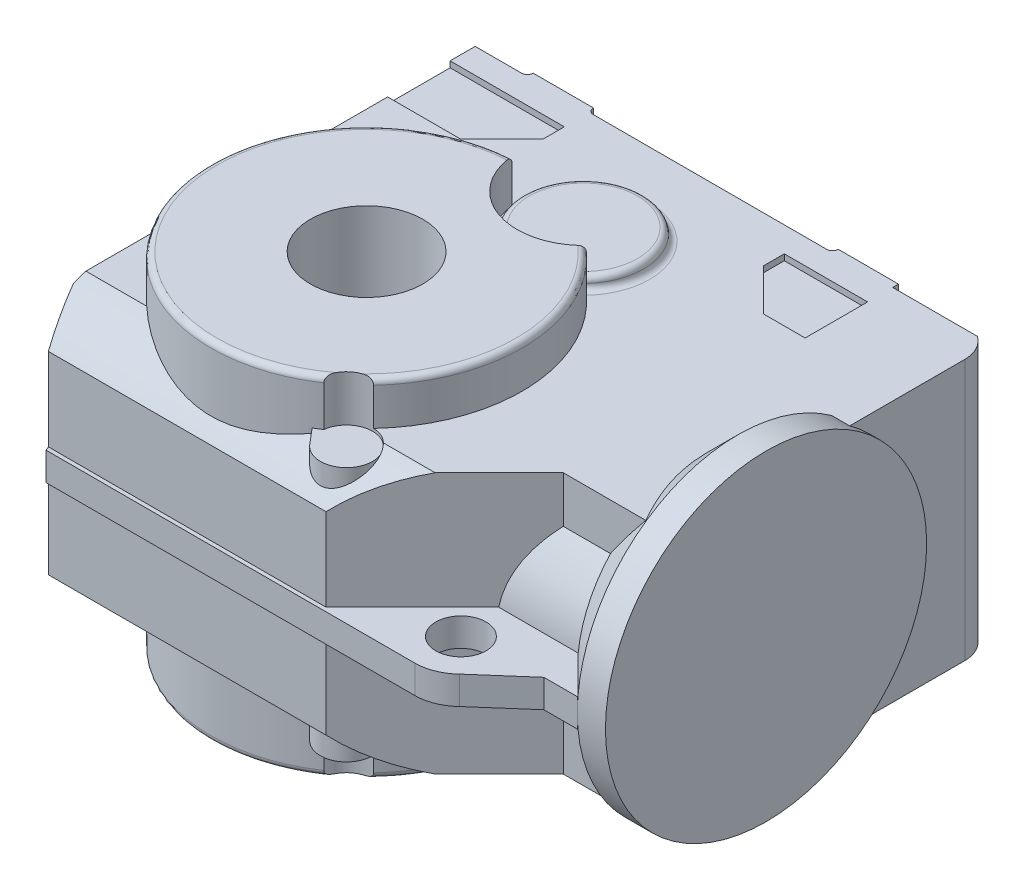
ISO-10303-21;
HEADER;
FILE_DESCRIPTION(('STEP AP214'),'2;1');
FILE_NAME('part.step','',(''),(''),'','','');
FILE_SCHEMA(('AUTOMOTIVE_DESIGN { 1 0 10303 214 1 1 1 1 }'));
ENDSEC;
DATA;
#1=APPLICATION_CONTEXT('core data for automotive mechanical design processes');
#2=APPLICATION_PROTOCOL_DEFINITION('international standard','automotive_design',2000,#1);
#3=PRODUCT_CONTEXT('',#1,'mechanical');
#4=PRODUCT('Part','Part','',(#3));
#5=PRODUCT_RELATED_PRODUCT_CATEGORY('part','',(#4));
#6=PRODUCT_DEFINITION_FORMATION('','',#4);
#7=PRODUCT_DEFINITION_CONTEXT('part definition',#1,'design');
#8=PRODUCT_DEFINITION('design','',#6,#7);
#9=PRODUCT_DEFINITION_SHAPE('','',#8);
#10=(LENGTH_UNIT() NAMED_UNIT(*) SI_UNIT(.MILLI.,.METRE.));
#11=(NAMED_UNIT(*) PLANE_ANGLE_UNIT() SI_UNIT($,.RADIAN.));
#12=(NAMED_UNIT(*) SI_UNIT($,.STERADIAN.) SOLID_ANGLE_UNIT());
#13=UNCERTAINTY_MEASURE_WITH_UNIT(LENGTH_MEASURE(1.E-05),#10,'distance_accuracy_value','');
#14=(GEOMETRIC_REPRESENTATION_CONTEXT(3) GLOBAL_UNCERTAINTY_ASSIGNED_CONTEXT((#13)) GLOBAL_UNIT_ASSIGNED_CONTEXT((#10,
#11,#12)) REPRESENTATION_CONTEXT('',''));
#15=CARTESIAN_POINT('',(0.,0.,0.));
#16=DIRECTION('',(0.,0.,1.));
#17=DIRECTION('',(1.,0.,0.));
#18=AXIS2_PLACEMENT_3D('',#15,#16,#17);
#19=CARTESIAN_POINT('',(110.,42.5,-104.));
#20=DIRECTION('',(0.,0.,1.));
#21=DIRECTION('',(1.,0.,0.));
#22=AXIS2_PLACEMENT_3D('',#19,#20,#21);
#23=PLANE('',#22);
#24=CARTESIAN_POINT('',(110.,42.5,-104.));
#25=DIRECTION('',(0.,0.,1.));
#26=DIRECTION('',(1.,0.,0.));
#27=AXIS2_PLACEMENT_3D('',#24,#25,#26);
#28=CIRCLE('',#27,6.00000000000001);
#29=CARTESIAN_POINT('',(116.,42.5,-104.));
#30=VERTEX_POINT('',#29);
#31=EDGE_CURVE('E2736',#30,#30,#28,.F.);
#32=ORIENTED_EDGE('',*,*,#31,.T.);
#33=EDGE_LOOP('',(#32));
#34=FACE_BOUND('',#33,.T.);
#35=ADVANCED_FACE('F16',(#34),#23,.F.);
#36=CARTESIAN_POINT('',(110.,130.5,-104.));
#37=DIRECTION('',(0.,0.,1.));
#38=DIRECTION('',(1.,0.,0.));
#39=AXIS2_PLACEMENT_3D('',#36,#37,#38);
#40=PLANE('',#39);
#41=CARTESIAN_POINT('',(110.,130.5,-104.));
#42=DIRECTION('',(0.,0.,1.));
#43=DIRECTION('',(1.,0.,0.));
#44=AXIS2_PLACEMENT_3D('',#41,#42,#43);
#45=CIRCLE('',#44,6.00000000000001);
#46=CARTESIAN_POINT('',(116.,130.5,-104.));
#47=VERTEX_POINT('',#46);
#48=EDGE_CURVE('E2737',#47,#47,#45,.F.);
#49=ORIENTED_EDGE('',*,*,#48,.T.);
#50=EDGE_LOOP('',(#49));
#51=FACE_BOUND('',#50,.T.);
#52=ADVANCED_FACE('F2703',(#51),#40,.F.);
#53=CARTESIAN_POINT('',(-42.,130.5,-104.));
#54=DIRECTION('',(0.,0.,1.));
#55=DIRECTION('',(1.,0.,0.));
#56=AXIS2_PLACEMENT_3D('',#53,#54,#55);
#57=PLANE('',#56);
#58=CARTESIAN_POINT('',(-42.,130.5,-104.));
#59=DIRECTION('',(0.,0.,1.));
#60=DIRECTION('',(1.,0.,0.));
#61=AXIS2_PLACEMENT_3D('',#58,#59,#60);
#62=CIRCLE('',#61,6.);
#63=CARTESIAN_POINT('',(-36.,130.5,-104.));
#64=VERTEX_POINT('',#63);
#65=EDGE_CURVE('E2740',#64,#64,#62,.F.);
#66=ORIENTED_EDGE('',*,*,#65,.T.);
#67=EDGE_LOOP('',(#66));
#68=FACE_BOUND('',#67,.T.);
#69=ADVANCED_FACE('F2694',(#68),#57,.F.);
#70=CARTESIAN_POINT('',(-42.,42.5,-104.));
#71=DIRECTION('',(0.,0.,1.));
#72=DIRECTION('',(1.,0.,0.));
#73=AXIS2_PLACEMENT_3D('',#70,#71,#72);
#74=PLANE('',#73);
#75=CARTESIAN_POINT('',(-42.,42.5,-104.));
#76=DIRECTION('',(0.,0.,1.));
#77=DIRECTION('',(1.,0.,0.));
#78=AXIS2_PLACEMENT_3D('',#75,#76,#77);
#79=CIRCLE('',#78,6.);
#80=CARTESIAN_POINT('',(-36.,42.5,-104.));
#81=VERTEX_POINT('',#80);
#82=EDGE_CURVE('E2269',#81,#81,#79,.F.);
#83=ORIENTED_EDGE('',*,*,#82,.T.);
#84=EDGE_LOOP('',(#83));
#85=FACE_BOUND('',#84,.T.);
#86=ADVANCED_FACE('F2685',(#85),#74,.F.);
#87=CARTESIAN_POINT('',(110.,93.5,63.));
#88=DIRECTION('',(0.,-1.,0.));
#89=DIRECTION('',(0.,0.,-1.));
#90=AXIS2_PLACEMENT_3D('',#87,#88,#89);
#91=CYLINDRICAL_SURFACE('',#90,12.5);
#92=CARTESIAN_POINT('',(110.,79.5,63.));
#93=DIRECTION('',(0.,-1.,0.));
#94=DIRECTION('',(0.,0.,-1.));
#95=AXIS2_PLACEMENT_3D('',#92,#93,#94);
#96=CIRCLE('',#95,12.5);
#97=CARTESIAN_POINT('',(110.,79.5,50.5));
#98=VERTEX_POINT('',#97);
#99=EDGE_CURVE('E460',#98,#98,#96,.F.);
#100=ORIENTED_EDGE('',*,*,#99,.F.);
#101=EDGE_LOOP('',(#100));
#102=FACE_BOUND('',#101,.T.);
#103=CARTESIAN_POINT('',(110.,93.5,63.));
#104=DIRECTION('',(0.,-1.,0.));
#105=DIRECTION('',(0.,0.,-1.));
#106=AXIS2_PLACEMENT_3D('',#103,#104,#105);
#107=CIRCLE('',#106,12.5);
#108=CARTESIAN_POINT('',(110.,93.5,50.5));
#109=VERTEX_POINT('',#108);
#110=EDGE_CURVE('E465',#109,#109,#107,.T.);
#111=ORIENTED_EDGE('',*,*,#110,.F.);
#112=EDGE_LOOP('',(#111));
#113=FACE_BOUND('',#112,.T.);
#114=ADVANCED_FACE('F2677',(#102,#113),#91,.F.);
#115=CARTESIAN_POINT('',(110.,93.5,62.9999999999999));
#116=DIRECTION('',(0.,-1.,0.));
#117=DIRECTION('',(0.,0.,-1.));
#118=AXIS2_PLACEMENT_3D('',#115,#116,#117);
#119=CYLINDRICAL_SURFACE('',#118,23.);
#120=CARTESIAN_POINT('',(110.,79.5,62.9999999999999));
#121=DIRECTION('',(0.,-1.,0.));
#122=DIRECTION('',(0.,0.,-1.));
#123=AXIS2_PLACEMENT_3D('',#120,#121,#122);
#124=CIRCLE('',#123,23.);
#125=CARTESIAN_POINT('',(125.953758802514,79.5,79.5673649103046));
#126=VERTEX_POINT('',#125);
#127=CARTESIAN_POINT('',(110.,79.5,86.));
#128=VERTEX_POINT('',#127);
#129=EDGE_CURVE('E442',#126,#128,#124,.T.);
#130=ORIENTED_EDGE('',*,*,#129,.F.);
#131=DIRECTION('',(0.,1.,0.));
#132=VECTOR('',#131,1.);
#133=CARTESIAN_POINT('',(125.953758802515,86.5,79.5673649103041));
#134=LINE('',#133,#132);
#135=CARTESIAN_POINT('',(125.953758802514,93.5,79.5673649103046));
#136=VERTEX_POINT('',#135);
#137=EDGE_CURVE('E436',#136,#126,#134,.F.);
#138=ORIENTED_EDGE('',*,*,#137,.F.);
#139=CARTESIAN_POINT('',(110.,93.5,62.9999999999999));
#140=DIRECTION('',(0.,-1.,0.));
#141=DIRECTION('',(0.,0.,-1.));
#142=AXIS2_PLACEMENT_3D('',#139,#140,#141);
#143=CIRCLE('',#142,23.);
#144=CARTESIAN_POINT('',(110.,93.5,86.));
#145=VERTEX_POINT('',#144);
#146=EDGE_CURVE('E464',#145,#136,#143,.F.);
#147=ORIENTED_EDGE('',*,*,#146,.F.);
#148=DIRECTION('',(0.,1.,0.));
#149=VECTOR('',#148,1.);
#150=CARTESIAN_POINT('',(110.,86.5,86.));
#151=LINE('',#150,#149);
#152=EDGE_CURVE('E457',#128,#145,#151,.T.);
#153=ORIENTED_EDGE('',*,*,#152,.F.);
#154=EDGE_LOOP('',(#130,#138,#147,#153));
#155=FACE_BOUND('',#154,.T.);
#156=ADVANCED_FACE('F463',(#155),#119,.T.);
#157=CARTESIAN_POINT('',(125.953758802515,86.5,79.5673649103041));
#158=DIRECTION('',(0.658779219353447,0.,0.752336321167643));
#159=DIRECTION('',(0.752336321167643,0.,-0.658779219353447));
#160=AXIS2_PLACEMENT_3D('',#157,#158,#159);
#161=PLANE('',#160);
#162=DIRECTION('',(-0.752336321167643,0.,0.658779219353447));
#163=VECTOR('',#162,1.);
#164=CARTESIAN_POINT('',(148.3,79.5,60.));
#165=LINE('',#164,#163);
#166=CARTESIAN_POINT('',(148.3,79.5,60.));
#167=VERTEX_POINT('',#166);
#168=EDGE_CURVE('E449',#167,#126,#165,.T.);
#169=ORIENTED_EDGE('',*,*,#168,.F.);
#170=DIRECTION('',(0.,1.,0.));
#171=VECTOR('',#170,1.);
#172=CARTESIAN_POINT('',(148.3,86.5,60.));
#173=LINE('',#172,#171);
#174=CARTESIAN_POINT('',(148.3,93.5,60.));
#175=VERTEX_POINT('',#174);
#176=EDGE_CURVE('E2759',#175,#167,#173,.F.);
#177=ORIENTED_EDGE('',*,*,#176,.F.);
#178=DIRECTION('',(0.752336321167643,0.,-0.658779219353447));
#179=VECTOR('',#178,1.);
#180=CARTESIAN_POINT('',(125.953758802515,93.5,79.5673649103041));
#181=LINE('',#180,#179);
#182=EDGE_CURVE('E2272',#136,#175,#181,.T.);
#183=ORIENTED_EDGE('',*,*,#182,.F.);
#184=ORIENTED_EDGE('',*,*,#137,.T.);
#185=EDGE_LOOP('',(#169,#177,#183,#184));
#186=FACE_BOUND('',#185,.T.);
#187=ADVANCED_FACE('F2661',(#186),#161,.T.);
#188=CARTESIAN_POINT('',(148.3,86.5,60.));
#189=DIRECTION('',(0.,0.,1.));
#190=DIRECTION('',(1.,0.,0.));
#191=AXIS2_PLACEMENT_3D('',#188,#189,#190);
#192=PLANE('',#191);
#193=ORIENTED_EDGE('',*,*,#176,.T.);
#194=DIRECTION('',(1.,0.,0.));
#195=VECTOR('',#194,1.);
#196=CARTESIAN_POINT('',(56.7833333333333,79.5,60.));
#197=LINE('',#196,#195);
#198=CARTESIAN_POINT('',(165.,79.5,60.));
#199=VERTEX_POINT('',#198);
#200=EDGE_CURVE('E474',#199,#167,#197,.F.);
#201=ORIENTED_EDGE('',*,*,#200,.F.);
#202=DIRECTION('',(0.,1.,0.));
#203=VECTOR('',#202,1.);
#204=CARTESIAN_POINT('',(165.,-7.5,60.));
#205=LINE('',#204,#203);
#206=CARTESIAN_POINT('',(165.,86.5,60.));
#207=VERTEX_POINT('',#206);
#208=EDGE_CURVE('E2738',#199,#207,#205,.T.);
#209=ORIENTED_EDGE('',*,*,#208,.T.);
#210=DIRECTION('',(0.,1.,0.));
#211=VECTOR('',#210,1.);
#212=CARTESIAN_POINT('',(165.,-7.5,60.));
#213=LINE('',#212,#211);
#214=CARTESIAN_POINT('',(165.,93.5,60.));
#215=VERTEX_POINT('',#214);
#216=EDGE_CURVE('E2742',#207,#215,#213,.T.);
#217=ORIENTED_EDGE('',*,*,#216,.T.);
#218=DIRECTION('',(1.,0.,0.));
#219=VECTOR('',#218,1.);
#220=CARTESIAN_POINT('',(56.7833333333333,93.5,60.));
#221=LINE('',#220,#219);
#222=EDGE_CURVE('E2274',#175,#215,#221,.T.);
#223=ORIENTED_EDGE('',*,*,#222,.F.);
#224=EDGE_LOOP('',(#193,#201,#209,#217,#223));
#225=FACE_BOUND('',#224,.T.);
#226=ADVANCED_FACE('F2653',(#225),#192,.T.);
#227=CARTESIAN_POINT('',(125.,148.5,-124.6));
#228=DIRECTION('',(0.,1.,0.));
#229=DIRECTION('',(0.,0.,1.));
#230=AXIS2_PLACEMENT_3D('',#227,#228,#229);
#231=PLANE('',#230);
#232=DIRECTION('',(0.,0.,-1.));
#233=VECTOR('',#232,1.);
#234=CARTESIAN_POINT('',(125.,148.5,-93.475));
#235=LINE('',#234,#233);
#236=CARTESIAN_POINT('',(125.,148.5,-93.475));
#237=VERTEX_POINT('',#236);
#238=CARTESIAN_POINT('',(125.,148.5,-124.6));
#239=VERTEX_POINT('',#238);
#240=EDGE_CURVE('E2451',#237,#239,#235,.T.);
#241=ORIENTED_EDGE('',*,*,#240,.T.);
#242=DIRECTION('',(-1.,0.,0.));
#243=VECTOR('',#242,1.);
#244=CARTESIAN_POINT('',(125.,148.5,-124.6));
#245=LINE('',#244,#243);
#246=CARTESIAN_POINT('',(83.5,148.5,-124.6));
#247=VERTEX_POINT('',#246);
#248=EDGE_CURVE('E2443',#239,#247,#245,.T.);
#249=ORIENTED_EDGE('',*,*,#248,.T.);
#250=DIRECTION('',(0.,0.,1.));
#251=VECTOR('',#250,1.);
#252=CARTESIAN_POINT('',(83.5,148.5,-124.6));
#253=LINE('',#252,#251);
#254=CARTESIAN_POINT('',(83.5,148.5,-114.225));
#255=VERTEX_POINT('',#254);
#256=EDGE_CURVE('E1405',#247,#255,#253,.T.);
#257=ORIENTED_EDGE('',*,*,#256,.T.);
#258=DIRECTION('',(0.707106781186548,0.,0.707106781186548));
#259=VECTOR('',#258,1.);
#260=CARTESIAN_POINT('',(83.5,148.5,-114.225));
#261=LINE('',#260,#259);
#262=CARTESIAN_POINT('',(104.25,148.5,-93.475));
#263=VERTEX_POINT('',#262);
#264=EDGE_CURVE('E968',#255,#263,#261,.T.);
#265=ORIENTED_EDGE('',*,*,#264,.T.);
#266=DIRECTION('',(1.,0.,0.));
#267=VECTOR('',#266,1.);
#268=CARTESIAN_POINT('',(104.25,148.5,-93.475));
#269=LINE('',#268,#267);
#270=EDGE_CURVE('E2457',#263,#237,#269,.T.);
#271=ORIENTED_EDGE('',*,*,#270,.T.);
#272=EDGE_LOOP('',(#241,#249,#257,#265,#271));
#273=FACE_BOUND('',#272,.T.);
#274=ADVANCED_FACE('F2468',(#273),#231,.T.);
#275=CARTESIAN_POINT('',(146.4,86.5,-20.));
#276=DIRECTION('',(-1.,0.,0.));
#277=DIRECTION('',(0.,0.,1.));
#278=AXIS2_PLACEMENT_3D('',#275,#276,#277);
#279=CYLINDRICAL_SURFACE('',#278,61.4);
#280=DIRECTION('',(1.,0.,0.));
#281=VECTOR('',#280,1.);
#282=CARTESIAN_POINT('',(56.7833333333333,93.5,40.9996721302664));
#283=LINE('',#282,#281);
#284=CARTESIAN_POINT('',(146.4,93.5,40.9996721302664));
#285=VERTEX_POINT('',#284);
#286=CARTESIAN_POINT('',(106.800327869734,93.5,40.9996721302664));
#287=VERTEX_POINT('',#286);
#288=EDGE_CURVE('E2279',#285,#287,#283,.F.);
#289=ORIENTED_EDGE('',*,*,#288,.F.);
#290=CARTESIAN_POINT('',(146.4,86.5,-20.));
#291=DIRECTION('',(1.,0.,0.));
#292=DIRECTION('',(0.,-1.,0.));
#293=AXIS2_PLACEMENT_3D('',#290,#291,#292);
#294=CIRCLE('',#293,61.3999999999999);
#295=CARTESIAN_POINT('',(146.4,128.380186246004,24.9));
#296=VERTEX_POINT('',#295);
#297=EDGE_CURVE('E1290',#296,#285,#294,.T.);
#298=ORIENTED_EDGE('',*,*,#297,.F.);
#299=DIRECTION('',(-1.,0.,0.));
#300=VECTOR('',#299,1.);
#301=CARTESIAN_POINT('',(122.9,128.380186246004,24.9));
#302=LINE('',#301,#300);
#303=CARTESIAN_POINT('',(122.9,128.380186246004,24.9));
#304=VERTEX_POINT('',#303);
#305=EDGE_CURVE('E969',#296,#304,#302,.T.);
#306=ORIENTED_EDGE('',*,*,#305,.T.);
#307=CARTESIAN_POINT('',(167.8,86.5,-20.));
#308=DIRECTION('',(-0.707106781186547,0.,-0.707106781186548));
#309=DIRECTION('',(-0.707106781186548,0.,0.707106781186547));
#310=AXIS2_PLACEMENT_3D('',#307,#308,#309);
#311=ELLIPSE('',#310,86.8327127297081,61.4);
#312=EDGE_CURVE('E955',#304,#287,#311,.F.);
#313=ORIENTED_EDGE('',*,*,#312,.T.);
#314=EDGE_LOOP('',(#289,#298,#306,#313));
#315=FACE_BOUND('',#314,.T.);
#316=ADVANCED_FACE('F2432',(#315),#279,.T.);
#317=CARTESIAN_POINT('',(14.5,157.5,-80.));
#318=DIRECTION('',(0.,1.,0.));
#319=DIRECTION('',(0.,0.,1.));
#320=AXIS2_PLACEMENT_3D('',#317,#318,#319);
#321=PLANE('',#320);
#322=CARTESIAN_POINT('',(28.,157.5,-80.));
#323=DIRECTION('',(0.,-1.,0.));
#324=DIRECTION('',(-1.,0.,0.));
#325=AXIS2_PLACEMENT_3D('',#322,#323,#324);
#326=CIRCLE('',#325,27.);
#327=CARTESIAN_POINT('',(1.,157.5,-80.));
#328=VERTEX_POINT('',#327);
#329=EDGE_CURVE('E958',#328,#328,#326,.T.);
#330=ORIENTED_EDGE('',*,*,#329,.F.);
#331=EDGE_LOOP('',(#330));
#332=FACE_BOUND('',#331,.T.);
#333=ADVANCED_FACE('F2529',(#332),#321,.T.);
#334=CARTESIAN_POINT('',(125.,24.5,-124.6));
#335=DIRECTION('',(0.,-1.,0.));
#336=DIRECTION('',(0.,0.,-1.));
#337=AXIS2_PLACEMENT_3D('',#334,#335,#336);
#338=PLANE('',#337);
#339=DIRECTION('',(0.,0.,1.));
#340=VECTOR('',#339,1.);
#341=CARTESIAN_POINT('',(83.5,24.5,-114.225));
#342=LINE('',#341,#340);
#343=CARTESIAN_POINT('',(83.5,24.5,-114.225));
#344=VERTEX_POINT('',#343);
#345=CARTESIAN_POINT('',(83.5,24.5,-124.6));
#346=VERTEX_POINT('',#345);
#347=EDGE_CURVE('E1335',#344,#346,#342,.F.);
#348=ORIENTED_EDGE('',*,*,#347,.T.);
#349=DIRECTION('',(-1.,0.,0.));
#350=VECTOR('',#349,1.);
#351=CARTESIAN_POINT('',(83.5,24.5,-124.6));
#352=LINE('',#351,#350);
#353=CARTESIAN_POINT('',(125.,24.5,-124.6));
#354=VERTEX_POINT('',#353);
#355=EDGE_CURVE('E1341',#346,#354,#352,.F.);
#356=ORIENTED_EDGE('',*,*,#355,.T.);
#357=DIRECTION('',(0.,0.,-1.));
#358=VECTOR('',#357,1.);
#359=CARTESIAN_POINT('',(125.,24.5,-124.6));
#360=LINE('',#359,#358);
#361=CARTESIAN_POINT('',(125.,24.5,-93.475));
#362=VERTEX_POINT('',#361);
#363=EDGE_CURVE('E1347',#354,#362,#360,.F.);
#364=ORIENTED_EDGE('',*,*,#363,.T.);
#365=DIRECTION('',(1.,0.,0.));
#366=VECTOR('',#365,1.);
#367=CARTESIAN_POINT('',(125.,24.5,-93.475));
#368=LINE('',#367,#366);
#369=CARTESIAN_POINT('',(104.25,24.5,-93.475));
#370=VERTEX_POINT('',#369);
#371=EDGE_CURVE('E1325',#362,#370,#368,.F.);
#372=ORIENTED_EDGE('',*,*,#371,.T.);
#373=DIRECTION('',(0.707106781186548,0.,0.707106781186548));
#374=VECTOR('',#373,1.);
#375=CARTESIAN_POINT('',(104.25,24.5,-93.475));
#376=LINE('',#375,#374);
#377=EDGE_CURVE('E1329',#370,#344,#376,.F.);
#378=ORIENTED_EDGE('',*,*,#377,.T.);
#379=EDGE_LOOP('',(#348,#356,#364,#372,#378));
#380=FACE_BOUND('',#379,.T.);
#381=ADVANCED_FACE('F2525',(#380),#338,.T.);
#382=CARTESIAN_POINT('',(165.,-7.5,-20.));
#383=DIRECTION('',(-1.,0.,0.));
#384=DIRECTION('',(0.,0.,1.));
#385=AXIS2_PLACEMENT_3D('',#382,#383,#384);
#386=PLANE('',#385);
#387=CARTESIAN_POINT('',(165.,86.5,-20.));
#388=DIRECTION('',(-1.,0.,0.));
#389=DIRECTION('',(0.,0.,1.));
#390=AXIS2_PLACEMENT_3D('',#387,#388,#389);
#391=CIRCLE('',#390,80.);
#392=CARTESIAN_POINT('',(165.,93.5,59.6931615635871));
#393=VERTEX_POINT('',#392);
#394=EDGE_CURVE('E1236',#393,#207,#391,.F.);
#395=ORIENTED_EDGE('',*,*,#394,.F.);
#396=DIRECTION('',(0.,0.,1.));
#397=VECTOR('',#396,1.);
#398=CARTESIAN_POINT('',(165.,93.5,130.966666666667));
#399=LINE('',#398,#397);
#400=EDGE_CURVE('E468',#215,#393,#399,.F.);
#401=ORIENTED_EDGE('',*,*,#400,.F.);
#402=ORIENTED_EDGE('',*,*,#216,.F.);
#403=EDGE_LOOP('',(#395,#401,#402));
#404=FACE_BOUND('',#403,.T.);
#405=ADVANCED_FACE('F2528',(#404),#386,.F.);
#406=CARTESIAN_POINT('',(165.,-7.5,-20.));
#407=DIRECTION('',(-1.,0.,0.));
#408=DIRECTION('',(0.,0.,1.));
#409=AXIS2_PLACEMENT_3D('',#406,#407,#408);
#410=PLANE('',#409);
#411=CARTESIAN_POINT('',(165.,86.5,-20.));
#412=DIRECTION('',(-1.,0.,0.));
#413=DIRECTION('',(0.,0.,1.));
#414=AXIS2_PLACEMENT_3D('',#411,#412,#413);
#415=CIRCLE('',#414,80.);
#416=CARTESIAN_POINT('',(165.,79.5,59.6931615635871));
#417=VERTEX_POINT('',#416);
#418=EDGE_CURVE('E1232',#207,#417,#415,.F.);
#419=ORIENTED_EDGE('',*,*,#418,.F.);
#420=ORIENTED_EDGE('',*,*,#208,.F.);
#421=DIRECTION('',(0.,0.,-1.));
#422=VECTOR('',#421,1.);
#423=CARTESIAN_POINT('',(165.,79.5,130.966666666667));
#424=LINE('',#423,#422);
#425=EDGE_CURVE('E476',#417,#199,#424,.F.);
#426=ORIENTED_EDGE('',*,*,#425,.F.);
#427=EDGE_LOOP('',(#419,#420,#426));
#428=FACE_BOUND('',#427,.T.);
#429=ADVANCED_FACE('F2535',(#428),#410,.F.);
#430=CARTESIAN_POINT('',(179.,46.5,-20.));
#431=DIRECTION('',(1.,0.,0.));
#432=DIRECTION('',(0.,0.,-1.));
#433=AXIS2_PLACEMENT_3D('',#430,#431,#432);
#434=PLANE('',#433);
#435=CARTESIAN_POINT('',(179.,86.5,-20.));
#436=DIRECTION('',(-1.,0.,0.));
#437=DIRECTION('',(0.,0.,1.));
#438=AXIS2_PLACEMENT_3D('',#435,#436,#437);
#439=CIRCLE('',#438,80.);
#440=CARTESIAN_POINT('',(179.,86.5,60.));
#441=VERTEX_POINT('',#440);
#442=EDGE_CURVE('E1229',#441,#441,#439,.T.);
#443=ORIENTED_EDGE('',*,*,#442,.F.);
#444=EDGE_LOOP('',(#443));
#445=FACE_BOUND('',#444,.T.);
#446=ADVANCED_FACE('F2341',(#445),#434,.T.);
#447=CARTESIAN_POINT('',(152.,110.55,-138.55));
#448=DIRECTION('',(0.,1.,0.));
#449=DIRECTION('',(0.,0.,1.));
#450=AXIS2_PLACEMENT_3D('',#447,#448,#449);
#451=PLANE('',#450);
#452=DIRECTION('',(0.,0.,-1.));
#453=VECTOR('',#452,1.);
#454=CARTESIAN_POINT('',(125.,110.55,-138.55));
#455=LINE('',#454,#453);
#456=CARTESIAN_POINT('',(125.,110.55,-137.1));
#457=VERTEX_POINT('',#456);
#458=CARTESIAN_POINT('',(125.,110.55,-140.));
#459=VERTEX_POINT('',#458);
#460=EDGE_CURVE('E1251',#457,#459,#455,.T.);
#461=ORIENTED_EDGE('',*,*,#460,.F.);
#462=DIRECTION('',(1.,0.,0.));
#463=VECTOR('',#462,1.);
#464=CARTESIAN_POINT('',(152.,110.55,-137.1));
#465=LINE('',#464,#463);
#466=CARTESIAN_POINT('',(167.186402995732,110.55,-137.1));
#467=VERTEX_POINT('',#466);
#468=EDGE_CURVE('E1250',#457,#467,#465,.T.);
#469=ORIENTED_EDGE('',*,*,#468,.T.);
#470=CARTESIAN_POINT('',(158.,110.55,-124.));
#471=DIRECTION('',(0.,-1.,0.));
#472=DIRECTION('',(0.,0.,-1.));
#473=AXIS2_PLACEMENT_3D('',#470,#471,#472);
#474=CIRCLE('',#473,16.);
#475=CARTESIAN_POINT('',(158.,110.55,-140.));
#476=VERTEX_POINT('',#475);
#477=EDGE_CURVE('E835',#476,#467,#474,.T.);
#478=ORIENTED_EDGE('',*,*,#477,.F.);
#479=DIRECTION('',(-1.,0.,0.));
#480=VECTOR('',#479,1.);
#481=CARTESIAN_POINT('',(158.,110.55,-140.));
#482=LINE('',#481,#480);
#483=EDGE_CURVE('E828',#459,#476,#482,.F.);
#484=ORIENTED_EDGE('',*,*,#483,.F.);
#485=EDGE_LOOP('',(#461,#469,#478,#484));
#486=FACE_BOUND('',#485,.T.);
#487=ADVANCED_FACE('F1267',(#486),#451,.T.);
#488=CARTESIAN_POINT('',(152.,62.45,-138.55));
#489=DIRECTION('',(0.,-1.,0.));
#490=DIRECTION('',(0.,0.,-1.));
#491=AXIS2_PLACEMENT_3D('',#488,#489,#490);
#492=PLANE('',#491);
#493=DIRECTION('',(0.,0.,-1.));
#494=VECTOR('',#493,1.);
#495=CARTESIAN_POINT('',(125.,62.45,-138.55));
#496=LINE('',#495,#494);
#497=CARTESIAN_POINT('',(125.,62.45,-140.));
#498=VERTEX_POINT('',#497);
#499=CARTESIAN_POINT('',(125.,62.45,-137.1));
#500=VERTEX_POINT('',#499);
#501=EDGE_CURVE('E829',#498,#500,#496,.F.);
#502=ORIENTED_EDGE('',*,*,#501,.F.);
#503=DIRECTION('',(-1.,0.,0.));
#504=VECTOR('',#503,1.);
#505=CARTESIAN_POINT('',(158.,62.45,-140.));
#506=LINE('',#505,#504);
#507=CARTESIAN_POINT('',(158.,62.45,-140.));
#508=VERTEX_POINT('',#507);
#509=EDGE_CURVE('E816',#508,#498,#506,.T.);
#510=ORIENTED_EDGE('',*,*,#509,.F.);
#511=CARTESIAN_POINT('',(158.,62.45,-124.));
#512=DIRECTION('',(0.,-1.,0.));
#513=DIRECTION('',(0.,0.,-1.));
#514=AXIS2_PLACEMENT_3D('',#511,#512,#513);
#515=CIRCLE('',#514,16.);
#516=CARTESIAN_POINT('',(167.186402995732,62.45,-137.1));
#517=VERTEX_POINT('',#516);
#518=EDGE_CURVE('E838',#517,#508,#515,.F.);
#519=ORIENTED_EDGE('',*,*,#518,.F.);
#520=DIRECTION('',(1.,0.,0.));
#521=VECTOR('',#520,1.);
#522=CARTESIAN_POINT('',(152.,62.45,-137.1));
#523=LINE('',#522,#521);
#524=EDGE_CURVE('E834',#500,#517,#523,.T.);
#525=ORIENTED_EDGE('',*,*,#524,.F.);
#526=EDGE_LOOP('',(#502,#510,#519,#525));
#527=FACE_BOUND('',#526,.T.);
#528=ADVANCED_FACE('F2330',(#527),#492,.T.);
#529=CARTESIAN_POINT('',(110.,42.5,-140.));
#530=DIRECTION('',(0.,0.,1.));
#531=DIRECTION('',(1.,0.,0.));
#532=AXIS2_PLACEMENT_3D('',#529,#530,#531);
#533=CYLINDRICAL_SURFACE('',#532,6.00000000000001);
#534=ORIENTED_EDGE('',*,*,#31,.F.);
#535=EDGE_LOOP('',(#534));
#536=FACE_BOUND('',#535,.T.);
#537=CARTESIAN_POINT('',(110.,42.5,-140.));
#538=DIRECTION('',(0.,0.,1.));
#539=DIRECTION('',(1.,0.,0.));
#540=AXIS2_PLACEMENT_3D('',#537,#538,#539);
#541=CIRCLE('',#540,6.00000000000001);
#542=CARTESIAN_POINT('',(116.,42.5,-140.));
#543=VERTEX_POINT('',#542);
#544=EDGE_CURVE('E1217',#543,#543,#541,.T.);
#545=ORIENTED_EDGE('',*,*,#544,.F.);
#546=EDGE_LOOP('',(#545));
#547=FACE_BOUND('',#546,.T.);
#548=ADVANCED_FACE('F2332',(#536,#547),#533,.F.);
#549=CARTESIAN_POINT('',(110.,130.5,-140.));
#550=DIRECTION('',(0.,0.,1.));
#551=DIRECTION('',(1.,0.,0.));
#552=AXIS2_PLACEMENT_3D('',#549,#550,#551);
#553=CYLINDRICAL_SURFACE('',#552,6.00000000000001);
#554=ORIENTED_EDGE('',*,*,#48,.F.);
#555=EDGE_LOOP('',(#554));
#556=FACE_BOUND('',#555,.T.);
#557=CARTESIAN_POINT('',(110.,130.5,-140.));
#558=DIRECTION('',(0.,0.,1.));
#559=DIRECTION('',(1.,0.,0.));
#560=AXIS2_PLACEMENT_3D('',#557,#558,#559);
#561=CIRCLE('',#560,6.00000000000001);
#562=CARTESIAN_POINT('',(116.,130.5,-140.));
#563=VERTEX_POINT('',#562);
#564=EDGE_CURVE('E812',#563,#563,#561,.T.);
#565=ORIENTED_EDGE('',*,*,#564,.F.);
#566=EDGE_LOOP('',(#565));
#567=FACE_BOUND('',#566,.T.);
#568=ADVANCED_FACE('F2338',(#556,#567),#553,.F.);
#569=CARTESIAN_POINT('',(-42.,130.5,-140.));
#570=DIRECTION('',(0.,0.,1.));
#571=DIRECTION('',(1.,0.,0.));
#572=AXIS2_PLACEMENT_3D('',#569,#570,#571);
#573=CYLINDRICAL_SURFACE('',#572,6.);
#574=ORIENTED_EDGE('',*,*,#65,.F.);
#575=EDGE_LOOP('',(#574));
#576=FACE_BOUND('',#575,.T.);
#577=CARTESIAN_POINT('',(-42.,130.5,-140.));
#578=DIRECTION('',(0.,0.,1.));
#579=DIRECTION('',(1.,0.,0.));
#580=AXIS2_PLACEMENT_3D('',#577,#578,#579);
#581=CIRCLE('',#580,6.);
#582=CARTESIAN_POINT('',(-36.,130.5,-140.));
#583=VERTEX_POINT('',#582);
#584=EDGE_CURVE('E807',#583,#583,#581,.T.);
#585=ORIENTED_EDGE('',*,*,#584,.F.);
#586=EDGE_LOOP('',(#585));
#587=FACE_BOUND('',#586,.T.);
#588=ADVANCED_FACE('F2347',(#576,#587),#573,.F.);
#589=CARTESIAN_POINT('',(-42.,42.5,-140.));
#590=DIRECTION('',(0.,0.,1.));
#591=DIRECTION('',(1.,0.,0.));
#592=AXIS2_PLACEMENT_3D('',#589,#590,#591);
#593=CYLINDRICAL_SURFACE('',#592,6.);
#594=ORIENTED_EDGE('',*,*,#82,.F.);
#595=EDGE_LOOP('',(#594));
#596=FACE_BOUND('',#595,.T.);
#597=CARTESIAN_POINT('',(-42.,42.5,-140.));
#598=DIRECTION('',(0.,0.,1.));
#599=DIRECTION('',(1.,0.,0.));
#600=AXIS2_PLACEMENT_3D('',#597,#598,#599);
#601=CIRCLE('',#600,6.);
#602=CARTESIAN_POINT('',(-36.,42.5,-140.));
#603=VERTEX_POINT('',#602);
#604=EDGE_CURVE('E804',#603,#603,#601,.T.);
#605=ORIENTED_EDGE('',*,*,#604,.F.);
#606=EDGE_LOOP('',(#605));
#607=FACE_BOUND('',#606,.T.);
#608=ADVANCED_FACE('F2351',(#596,#607),#593,.F.);
#609=CARTESIAN_POINT('',(146.4,86.5,-20.));
#610=DIRECTION('',(-1.,0.,0.));
#611=DIRECTION('',(0.,0.,1.));
#612=AXIS2_PLACEMENT_3D('',#609,#610,#611);
#613=CYLINDRICAL_SURFACE('',#612,61.4);
#614=DIRECTION('',(1.,0.,0.));
#615=VECTOR('',#614,1.);
#616=CARTESIAN_POINT('',(56.7833333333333,79.5,40.9996721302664));
#617=LINE('',#616,#615);
#618=CARTESIAN_POINT('',(106.800327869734,79.5,40.9996721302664));
#619=VERTEX_POINT('',#618);
#620=CARTESIAN_POINT('',(146.4,79.5,40.9996721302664));
#621=VERTEX_POINT('',#620);
#622=EDGE_CURVE('E452',#619,#621,#617,.T.);
#623=ORIENTED_EDGE('',*,*,#622,.F.);
#624=CARTESIAN_POINT('',(167.8,86.5,-20.));
#625=DIRECTION('',(-0.707106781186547,0.,-0.707106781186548));
#626=DIRECTION('',(-0.707106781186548,0.,0.707106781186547));
#627=AXIS2_PLACEMENT_3D('',#624,#625,#626);
#628=ELLIPSE('',#627,86.8327127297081,61.4);
#629=CARTESIAN_POINT('',(122.9,44.6198137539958,24.9));
#630=VERTEX_POINT('',#629);
#631=EDGE_CURVE('E1203',#619,#630,#628,.F.);
#632=ORIENTED_EDGE('',*,*,#631,.T.);
#633=DIRECTION('',(-1.,0.,0.));
#634=VECTOR('',#633,1.);
#635=CARTESIAN_POINT('',(179.,44.6198137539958,24.9));
#636=LINE('',#635,#634);
#637=CARTESIAN_POINT('',(146.4,44.6198137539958,24.9));
#638=VERTEX_POINT('',#637);
#639=EDGE_CURVE('E954',#630,#638,#636,.F.);
#640=ORIENTED_EDGE('',*,*,#639,.T.);
#641=CARTESIAN_POINT('',(146.4,86.5,-20.));
#642=DIRECTION('',(1.,0.,0.));
#643=DIRECTION('',(0.,-1.,0.));
#644=AXIS2_PLACEMENT_3D('',#641,#642,#643);
#645=CIRCLE('',#644,61.4);
#646=EDGE_CURVE('E843',#621,#638,#645,.T.);
#647=ORIENTED_EDGE('',*,*,#646,.F.);
#648=EDGE_LOOP('',(#623,#632,#640,#647));
#649=FACE_BOUND('',#648,.T.);
#650=ADVANCED_FACE('F2256',(#649),#613,.T.);
#651=CARTESIAN_POINT('',(56.7833333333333,79.5,130.966666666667));
#652=DIRECTION('',(0.,-1.,0.));
#653=DIRECTION('',(0.,0.,-1.));
#654=AXIS2_PLACEMENT_3D('',#651,#652,#653);
#655=PLANE('',#654);
#656=ORIENTED_EDGE('',*,*,#99,.T.);
#657=EDGE_LOOP('',(#656));
#658=FACE_BOUND('',#657,.T.);
#659=ORIENTED_EDGE('',*,*,#622,.T.);
#660=CARTESIAN_POINT('',(165.,79.5,59.6931615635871));
#661=CARTESIAN_POINT('',(163.449091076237,79.5,58.1362753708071));
#662=CARTESIAN_POINT('',(161.898350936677,79.5,56.5792210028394));
#663=CARTESIAN_POINT('',(158.797290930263,79.5,53.4646941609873));
#664=CARTESIAN_POINT('',(157.246971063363,79.5,51.9072216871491));
#665=CARTESIAN_POINT('',(154.146833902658,79.5,48.791776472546));
#666=CARTESIAN_POINT('',(152.597016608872,79.5,47.2338037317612));
#667=CARTESIAN_POINT('',(149.498007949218,79.5,44.1172355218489));
#668=CARTESIAN_POINT('',(147.948816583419,79.5,42.5586400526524));
#669=CARTESIAN_POINT('',(146.4,79.5,40.9996721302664));
#670=B_SPLINE_CURVE_WITH_KNOTS('',3,(#660,#661,#662,#663,#664,#665,#666,#667,#668,#669),
.UNSPECIFIED.,.F.,.F.,(4,2,2,2,4),(0.,6.59264122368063,13.185281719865,19.7779224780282,
26.3705639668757),.UNSPECIFIED.);
#671=EDGE_CURVE('E942',#417,#621,#670,.T.);
#672=ORIENTED_EDGE('',*,*,#671,.F.);
#673=ORIENTED_EDGE('',*,*,#425,.T.);
#674=ORIENTED_EDGE('',*,*,#200,.T.);
#675=ORIENTED_EDGE('',*,*,#168,.T.);
#676=ORIENTED_EDGE('',*,*,#129,.T.);
#677=DIRECTION('',(1.,0.,0.));
#678=VECTOR('',#677,1.);
#679=CARTESIAN_POINT('',(-73.7073968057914,79.5,86.));
#680=LINE('',#679,#678);
#681=CARTESIAN_POINT('',(-73.7073968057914,79.5,86.));
#682=VERTEX_POINT('',#681);
#683=EDGE_CURVE('E446',#682,#128,#680,.T.);
#684=ORIENTED_EDGE('',*,*,#683,.F.);
#685=DIRECTION('',(0.374606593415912,0.,0.927183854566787));
#686=VECTOR('',#685,1.);
#687=CARTESIAN_POINT('',(-83.,79.5,63.));
#688=LINE('',#687,#686);
#689=CARTESIAN_POINT('',(-74.5154492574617,79.5,84.));
#690=VERTEX_POINT('',#689);
#691=EDGE_CURVE('E1369',#690,#682,#688,.T.);
#692=ORIENTED_EDGE('',*,*,#691,.F.);
#693=DIRECTION('',(-1.,0.,0.));
#694=VECTOR('',#693,1.);
#695=CARTESIAN_POINT('',(63.8,79.5,84.));
#696=LINE('',#695,#694);
#697=CARTESIAN_POINT('',(63.8,79.5,84.));
#698=VERTEX_POINT('',#697);
#699=EDGE_CURVE('E728',#690,#698,#696,.F.);
#700=ORIENTED_EDGE('',*,*,#699,.T.);
#701=DIRECTION('',(-0.707106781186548,0.,0.707106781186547));
#702=VECTOR('',#701,1.);
#703=CARTESIAN_POINT('',(122.9,79.5,24.9));
#704=LINE('',#703,#702);
#705=EDGE_CURVE('E1206',#698,#619,#704,.F.);
#706=ORIENTED_EDGE('',*,*,#705,.T.);
#707=EDGE_LOOP('',(#659,#672,#673,#674,#675,#676,#684,#692,#700,#706));
#708=FACE_BOUND('',#707,.T.);
#709=ADVANCED_FACE('F444',(#658,#708),#655,.T.);
#710=CARTESIAN_POINT('',(-73.7073968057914,86.5,86.));
#711=DIRECTION('',(0.,0.,1.));
#712=DIRECTION('',(1.,0.,0.));
#713=AXIS2_PLACEMENT_3D('',#710,#711,#712);
#714=PLANE('',#713);
#715=ORIENTED_EDGE('',*,*,#683,.T.);
#716=ORIENTED_EDGE('',*,*,#152,.T.);
#717=DIRECTION('',(1.,0.,0.));
#718=VECTOR('',#717,1.);
#719=CARTESIAN_POINT('',(56.7833333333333,93.5,86.));
#720=LINE('',#719,#718);
#721=CARTESIAN_POINT('',(-73.7073968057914,93.5,86.));
#722=VERTEX_POINT('',#721);
#723=EDGE_CURVE('E2277',#722,#145,#720,.T.);
#724=ORIENTED_EDGE('',*,*,#723,.F.);
#725=DIRECTION('',(0.,1.,0.));
#726=VECTOR('',#725,1.);
#727=CARTESIAN_POINT('',(-73.7073968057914,86.5,86.));
#728=LINE('',#727,#726);
#729=EDGE_CURVE('E459',#682,#722,#728,.T.);
#730=ORIENTED_EDGE('',*,*,#729,.F.);
#731=EDGE_LOOP('',(#715,#716,#724,#730));
#732=FACE_BOUND('',#731,.T.);
#733=ADVANCED_FACE('F455',(#732),#714,.T.);
#734=CARTESIAN_POINT('',(56.7833333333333,93.5,130.966666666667));
#735=DIRECTION('',(0.,1.,0.));
#736=DIRECTION('',(0.,0.,1.));
#737=AXIS2_PLACEMENT_3D('',#734,#735,#736);
#738=PLANE('',#737);
#739=ORIENTED_EDGE('',*,*,#182,.T.);
#740=ORIENTED_EDGE('',*,*,#222,.T.);
#741=ORIENTED_EDGE('',*,*,#400,.T.);
#742=CARTESIAN_POINT('',(146.4,93.5,40.9996721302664));
#743=CARTESIAN_POINT('',(147.948816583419,93.5,42.5586400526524));
#744=CARTESIAN_POINT('',(149.498007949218,93.5,44.1172355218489));
#745=CARTESIAN_POINT('',(152.597016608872,93.5,47.2338037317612));
#746=CARTESIAN_POINT('',(154.146833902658,93.5,48.791776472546));
#747=CARTESIAN_POINT('',(157.246971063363,93.5,51.9072216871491));
#748=CARTESIAN_POINT('',(158.797290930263,93.5,53.4646941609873));
#749=CARTESIAN_POINT('',(161.898350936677,93.5,56.5792210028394));
#750=CARTESIAN_POINT('',(163.449091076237,93.5,58.1362753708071));
#751=CARTESIAN_POINT('',(165.,93.5,59.6931615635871));
#752=B_SPLINE_CURVE_WITH_KNOTS('',3,(#742,#743,#744,#745,#746,#747,#748,#749,#750,#751),
.UNSPECIFIED.,.F.,.F.,(4,2,2,2,4),(0.,6.59264148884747,13.1852822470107,19.7779227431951,
26.3705639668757),.UNSPECIFIED.);
#753=EDGE_CURVE('E970',#285,#393,#752,.T.);
#754=ORIENTED_EDGE('',*,*,#753,.F.);
#755=ORIENTED_EDGE('',*,*,#288,.T.);
#756=DIRECTION('',(-0.707106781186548,0.,0.707106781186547));
#757=VECTOR('',#756,1.);
#758=CARTESIAN_POINT('',(63.8,93.5,84.));
#759=LINE('',#758,#757);
#760=CARTESIAN_POINT('',(63.8,93.5,84.));
#761=VERTEX_POINT('',#760);
#762=EDGE_CURVE('E1404',#287,#761,#759,.T.);
#763=ORIENTED_EDGE('',*,*,#762,.T.);
#764=DIRECTION('',(-1.,0.,0.));
#765=VECTOR('',#764,1.);
#766=CARTESIAN_POINT('',(-102.,93.5,84.));
#767=LINE('',#766,#765);
#768=CARTESIAN_POINT('',(-74.5154492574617,93.5,84.));
#769=VERTEX_POINT('',#768);
#770=EDGE_CURVE('E1401',#761,#769,#767,.T.);
#771=ORIENTED_EDGE('',*,*,#770,.T.);
#772=DIRECTION('',(0.374606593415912,0.,0.927183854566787));
#773=VECTOR('',#772,1.);
#774=CARTESIAN_POINT('',(-83.,93.5,63.));
#775=LINE('',#774,#773);
#776=EDGE_CURVE('E1365',#722,#769,#775,.F.);
#777=ORIENTED_EDGE('',*,*,#776,.F.);
#778=ORIENTED_EDGE('',*,*,#723,.T.);
#779=ORIENTED_EDGE('',*,*,#146,.T.);
#780=EDGE_LOOP('',(#739,#740,#741,#754,#755,#763,#771,#777,#778,#779));
#781=FACE_BOUND('',#780,.T.);
#782=ORIENTED_EDGE('',*,*,#110,.T.);
#783=EDGE_LOOP('',(#782));
#784=FACE_BOUND('',#783,.T.);
#785=ADVANCED_FACE('F1419',(#781,#784),#738,.T.);
#786=CARTESIAN_POINT('',(-83.,24.5,-124.6));
#787=DIRECTION('',(0.,-1.,0.));
#788=DIRECTION('',(0.,0.,-1.));
#789=AXIS2_PLACEMENT_3D('',#786,#787,#788);
#790=PLANE('',#789);
#791=DIRECTION('',(0.,0.,1.));
#792=VECTOR('',#791,1.);
#793=CARTESIAN_POINT('',(-83.,24.5,-137.1));
#794=LINE('',#793,#792);
#795=CARTESIAN_POINT('',(-83.,24.5,-124.6));
#796=VERTEX_POINT('',#795);
#797=CARTESIAN_POINT('',(-83.,24.5,-93.475));
#798=VERTEX_POINT('',#797);
#799=EDGE_CURVE('E741',#796,#798,#794,.T.);
#800=ORIENTED_EDGE('',*,*,#799,.F.);
#801=DIRECTION('',(-1.,0.,0.));
#802=VECTOR('',#801,1.);
#803=CARTESIAN_POINT('',(-83.,24.5,-124.6));
#804=LINE('',#803,#802);
#805=CARTESIAN_POINT('',(-26.1,24.5,-124.6));
#806=VERTEX_POINT('',#805);
#807=EDGE_CURVE('E775',#796,#806,#804,.F.);
#808=ORIENTED_EDGE('',*,*,#807,.T.);
#809=DIRECTION('',(0.,0.,-1.));
#810=VECTOR('',#809,1.);
#811=CARTESIAN_POINT('',(-26.1,24.5,-124.6));
#812=LINE('',#811,#810);
#813=CARTESIAN_POINT('',(-26.1,24.5,-114.225));
#814=VERTEX_POINT('',#813);
#815=EDGE_CURVE('E764',#806,#814,#812,.F.);
#816=ORIENTED_EDGE('',*,*,#815,.T.);
#817=DIRECTION('',(0.707106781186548,0.,-0.707106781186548));
#818=VECTOR('',#817,1.);
#819=CARTESIAN_POINT('',(-26.1,24.5,-114.225));
#820=LINE('',#819,#818);
#821=CARTESIAN_POINT('',(-46.85,24.5,-93.475));
#822=VERTEX_POINT('',#821);
#823=EDGE_CURVE('E753',#814,#822,#820,.F.);
#824=ORIENTED_EDGE('',*,*,#823,.T.);
#825=DIRECTION('',(1.,0.,0.));
#826=VECTOR('',#825,1.);
#827=CARTESIAN_POINT('',(-46.85,24.5,-93.475));
#828=LINE('',#827,#826);
#829=EDGE_CURVE('E752',#822,#798,#828,.F.);
#830=ORIENTED_EDGE('',*,*,#829,.T.);
#831=EDGE_LOOP('',(#800,#808,#816,#824,#830));
#832=FACE_BOUND('',#831,.T.);
#833=ADVANCED_FACE('F2200',(#832),#790,.T.);
#834=CARTESIAN_POINT('',(-83.,148.5,-124.6));
#835=DIRECTION('',(0.,1.,0.));
#836=DIRECTION('',(0.,0.,1.));
#837=AXIS2_PLACEMENT_3D('',#834,#835,#836);
#838=PLANE('',#837);
#839=DIRECTION('',(0.,0.,-1.));
#840=VECTOR('',#839,1.);
#841=CARTESIAN_POINT('',(-26.1,148.5,-114.225));
#842=LINE('',#841,#840);
#843=CARTESIAN_POINT('',(-26.1,148.5,-114.225));
#844=VERTEX_POINT('',#843);
#845=CARTESIAN_POINT('',(-26.1,148.5,-124.6));
#846=VERTEX_POINT('',#845);
#847=EDGE_CURVE('E1122',#844,#846,#842,.T.);
#848=ORIENTED_EDGE('',*,*,#847,.T.);
#849=DIRECTION('',(-1.,0.,0.));
#850=VECTOR('',#849,1.);
#851=CARTESIAN_POINT('',(-26.1,148.5,-124.6));
#852=LINE('',#851,#850);
#853=CARTESIAN_POINT('',(-83.,148.5,-124.6));
#854=VERTEX_POINT('',#853);
#855=EDGE_CURVE('E1121',#846,#854,#852,.T.);
#856=ORIENTED_EDGE('',*,*,#855,.T.);
#857=DIRECTION('',(0.,0.,1.));
#858=VECTOR('',#857,1.);
#859=CARTESIAN_POINT('',(-83.,148.5,-137.1));
#860=LINE('',#859,#858);
#861=CARTESIAN_POINT('',(-83.,148.5,-93.475));
#862=VERTEX_POINT('',#861);
#863=EDGE_CURVE('E1155',#862,#854,#860,.F.);
#864=ORIENTED_EDGE('',*,*,#863,.F.);
#865=DIRECTION('',(1.,0.,0.));
#866=VECTOR('',#865,1.);
#867=CARTESIAN_POINT('',(-83.,148.5,-93.475));
#868=LINE('',#867,#866);
#869=CARTESIAN_POINT('',(-46.85,148.5,-93.475));
#870=VERTEX_POINT('',#869);
#871=EDGE_CURVE('E1144',#862,#870,#868,.T.);
#872=ORIENTED_EDGE('',*,*,#871,.T.);
#873=DIRECTION('',(0.707106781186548,0.,-0.707106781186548));
#874=VECTOR('',#873,1.);
#875=CARTESIAN_POINT('',(-46.85,148.5,-93.475));
#876=LINE('',#875,#874);
#877=EDGE_CURVE('E1133',#870,#844,#876,.T.);
#878=ORIENTED_EDGE('',*,*,#877,.T.);
#879=EDGE_LOOP('',(#848,#856,#864,#872,#878));
#880=FACE_BOUND('',#879,.T.);
#881=ADVANCED_FACE('F2184',(#880),#838,.T.);
#882=CARTESIAN_POINT('',(28.,15.5,-66.5));
#883=DIRECTION('',(0.,-1.,0.));
#884=DIRECTION('',(0.,0.,-1.));
#885=AXIS2_PLACEMENT_3D('',#882,#883,#884);
#886=PLANE('',#885);
#887=CARTESIAN_POINT('',(28.,15.5,-80.));
#888=DIRECTION('',(0.,1.,0.));
#889=DIRECTION('',(0.,0.,1.));
#890=AXIS2_PLACEMENT_3D('',#887,#888,#889);
#891=CIRCLE('',#890,27.);
#892=CARTESIAN_POINT('',(28.,15.5,-53.));
#893=VERTEX_POINT('',#892);
#894=EDGE_CURVE('E1162',#893,#893,#891,.T.);
#895=ORIENTED_EDGE('',*,*,#894,.F.);
#896=EDGE_LOOP('',(#895));
#897=FACE_BOUND('',#896,.T.);
#898=ADVANCED_FACE('F2293',(#897),#886,.T.);
#899=CARTESIAN_POINT('',(-83.,151.5,-93.475));
#900=DIRECTION('',(0.,0.,1.));
#901=DIRECTION('',(1.,0.,0.));
#902=AXIS2_PLACEMENT_3D('',#899,#900,#901);
#903=PLANE('',#902);
#904=DIRECTION('',(0.,1.,0.));
#905=VECTOR('',#904,1.);
#906=CARTESIAN_POINT('',(-83.,86.5,-93.475));
#907=LINE('',#906,#905);
#908=CARTESIAN_POINT('',(-83.,151.5,-93.475));
#909=VERTEX_POINT('',#908);
#910=EDGE_CURVE('E1152',#909,#862,#907,.F.);
#911=ORIENTED_EDGE('',*,*,#910,.F.);
#912=DIRECTION('',(1.,0.,0.));
#913=VECTOR('',#912,1.);
#914=CARTESIAN_POINT('',(-73.7073968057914,151.5,-93.475));
#915=LINE('',#914,#913);
#916=CARTESIAN_POINT('',(-46.85,151.5,-93.475));
#917=VERTEX_POINT('',#916);
#918=EDGE_CURVE('E1138',#909,#917,#915,.T.);
#919=ORIENTED_EDGE('',*,*,#918,.T.);
#920=DIRECTION('',(0.,1.,0.));
#921=VECTOR('',#920,1.);
#922=CARTESIAN_POINT('',(-46.85,151.5,-93.475));
#923=LINE('',#922,#921);
#924=EDGE_CURVE('E1141',#917,#870,#923,.F.);
#925=ORIENTED_EDGE('',*,*,#924,.T.);
#926=ORIENTED_EDGE('',*,*,#871,.F.);
#927=EDGE_LOOP('',(#911,#919,#925,#926));
#928=FACE_BOUND('',#927,.T.);
#929=ADVANCED_FACE('F2303',(#928),#903,.F.);
#930=CARTESIAN_POINT('',(-46.85,151.5,-93.475));
#931=DIRECTION('',(0.707106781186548,0.,0.707106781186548));
#932=DIRECTION('',(0.707106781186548,0.,-0.707106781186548));
#933=AXIS2_PLACEMENT_3D('',#930,#931,#932);
#934=PLANE('',#933);
#935=ORIENTED_EDGE('',*,*,#924,.F.);
#936=DIRECTION('',(0.707106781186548,0.,-0.707106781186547));
#937=VECTOR('',#936,1.);
#938=CARTESIAN_POINT('',(-46.85,151.5,-93.475));
#939=LINE('',#938,#937);
#940=CARTESIAN_POINT('',(-26.1,151.5,-114.225));
#941=VERTEX_POINT('',#940);
#942=EDGE_CURVE('E1127',#917,#941,#939,.T.);
#943=ORIENTED_EDGE('',*,*,#942,.T.);
#944=DIRECTION('',(0.,1.,0.));
#945=VECTOR('',#944,1.);
#946=CARTESIAN_POINT('',(-26.1,151.5,-114.225));
#947=LINE('',#946,#945);
#948=EDGE_CURVE('E1130',#941,#844,#947,.F.);
#949=ORIENTED_EDGE('',*,*,#948,.T.);
#950=ORIENTED_EDGE('',*,*,#877,.F.);
#951=EDGE_LOOP('',(#935,#943,#949,#950));
#952=FACE_BOUND('',#951,.T.);
#953=ADVANCED_FACE('F2307',(#952),#934,.F.);
#954=CARTESIAN_POINT('',(-26.1,151.5,-114.225));
#955=DIRECTION('',(1.,0.,0.));
#956=DIRECTION('',(0.,0.,-1.));
#957=AXIS2_PLACEMENT_3D('',#954,#955,#956);
#958=PLANE('',#957);
#959=ORIENTED_EDGE('',*,*,#948,.F.);
#960=DIRECTION('',(0.,0.,-1.));
#961=VECTOR('',#960,1.);
#962=CARTESIAN_POINT('',(-26.1,151.5,86.));
#963=LINE('',#962,#961);
#964=CARTESIAN_POINT('',(-26.1,151.5,-124.6));
#965=VERTEX_POINT('',#964);
#966=EDGE_CURVE('E1104',#941,#965,#963,.T.);
#967=ORIENTED_EDGE('',*,*,#966,.T.);
#968=DIRECTION('',(0.,1.,0.));
#969=VECTOR('',#968,1.);
#970=CARTESIAN_POINT('',(-26.1,151.5,-124.6));
#971=LINE('',#970,#969);
#972=EDGE_CURVE('E1118',#965,#846,#971,.F.);
#973=ORIENTED_EDGE('',*,*,#972,.T.);
#974=ORIENTED_EDGE('',*,*,#847,.F.);
#975=EDGE_LOOP('',(#959,#967,#973,#974));
#976=FACE_BOUND('',#975,.T.);
#977=ADVANCED_FACE('F2310',(#976),#958,.F.);
#978=CARTESIAN_POINT('',(-26.1,151.5,-124.6));
#979=DIRECTION('',(0.,0.,-1.));
#980=DIRECTION('',(-1.,0.,0.));
#981=AXIS2_PLACEMENT_3D('',#978,#979,#980);
#982=PLANE('',#981);
#983=ORIENTED_EDGE('',*,*,#972,.F.);
#984=DIRECTION('',(1.,0.,0.));
#985=VECTOR('',#984,1.);
#986=CARTESIAN_POINT('',(-73.7073968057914,151.5,-124.6));
#987=LINE('',#986,#985);
#988=CARTESIAN_POINT('',(-83.,151.5,-124.6));
#989=VERTEX_POINT('',#988);
#990=EDGE_CURVE('E1099',#965,#989,#987,.F.);
#991=ORIENTED_EDGE('',*,*,#990,.T.);
#992=DIRECTION('',(0.,1.,0.));
#993=VECTOR('',#992,1.);
#994=CARTESIAN_POINT('',(-83.,86.5,-124.6));
#995=LINE('',#994,#993);
#996=EDGE_CURVE('E795',#854,#989,#995,.T.);
#997=ORIENTED_EDGE('',*,*,#996,.F.);
#998=ORIENTED_EDGE('',*,*,#855,.F.);
#999=EDGE_LOOP('',(#983,#991,#997,#998));
#1000=FACE_BOUND('',#999,.T.);
#1001=ADVANCED_FACE('F2314',(#1000),#982,.F.);
#1002=CARTESIAN_POINT('',(125.,143.05,-138.55));
#1003=DIRECTION('',(1.,0.,0.));
#1004=DIRECTION('',(0.,0.,-1.));
#1005=AXIS2_PLACEMENT_3D('',#1002,#1003,#1004);
#1006=PLANE('',#1005);
#1007=ORIENTED_EDGE('',*,*,#460,.T.);
#1008=DIRECTION('',(0.,1.,0.));
#1009=VECTOR('',#1008,1.);
#1010=CARTESIAN_POINT('',(125.,86.5,-140.));
#1011=LINE('',#1010,#1009);
#1012=CARTESIAN_POINT('',(125.,151.5,-140.));
#1013=VERTEX_POINT('',#1012);
#1014=EDGE_CURVE('E815',#1013,#459,#1011,.F.);
#1015=ORIENTED_EDGE('',*,*,#1014,.F.);
#1016=DIRECTION('',(0.,0.,-1.));
#1017=VECTOR('',#1016,1.);
#1018=CARTESIAN_POINT('',(125.,151.5,86.));
#1019=LINE('',#1018,#1017);
#1020=CARTESIAN_POINT('',(125.,151.5,-137.1));
#1021=VERTEX_POINT('',#1020);
#1022=EDGE_CURVE('E1075',#1013,#1021,#1019,.F.);
#1023=ORIENTED_EDGE('',*,*,#1022,.T.);
#1024=DIRECTION('',(0.,-1.,0.));
#1025=VECTOR('',#1024,1.);
#1026=CARTESIAN_POINT('',(125.,143.05,-137.1));
#1027=LINE('',#1026,#1025);
#1028=EDGE_CURVE('E1247',#1021,#457,#1027,.T.);
#1029=ORIENTED_EDGE('',*,*,#1028,.T.);
#1030=EDGE_LOOP('',(#1007,#1015,#1023,#1029));
#1031=FACE_BOUND('',#1030,.T.);
#1032=ADVANCED_FACE('F2318',(#1031),#1006,.T.);
#1033=CARTESIAN_POINT('',(152.,143.05,-137.1));
#1034=DIRECTION('',(0.,0.,1.));
#1035=DIRECTION('',(0.,-1.,0.));
#1036=AXIS2_PLACEMENT_3D('',#1033,#1034,#1035);
#1037=PLANE('',#1036);
#1038=ORIENTED_EDGE('',*,*,#468,.F.);
#1039=ORIENTED_EDGE('',*,*,#1028,.F.);
#1040=DIRECTION('',(1.,0.,0.));
#1041=VECTOR('',#1040,1.);
#1042=CARTESIAN_POINT('',(-73.7073968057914,151.5,-137.1));
#1043=LINE('',#1042,#1041);
#1044=CARTESIAN_POINT('',(167.186402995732,151.5,-137.1));
#1045=VERTEX_POINT('',#1044);
#1046=EDGE_CURVE('E1072',#1021,#1045,#1043,.T.);
#1047=ORIENTED_EDGE('',*,*,#1046,.T.);
#1048=DIRECTION('',(0.,-1.,0.));
#1049=VECTOR('',#1048,1.);
#1050=CARTESIAN_POINT('',(167.186402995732,86.5,-137.1));
#1051=LINE('',#1050,#1049);
#1052=EDGE_CURVE('E839',#467,#1045,#1051,.F.);
#1053=ORIENTED_EDGE('',*,*,#1052,.F.);
#1054=EDGE_LOOP('',(#1038,#1039,#1047,#1053));
#1055=FACE_BOUND('',#1054,.T.);
#1056=ADVANCED_FACE('F2321',(#1055),#1037,.F.);
#1057=CARTESIAN_POINT('',(165.,86.5,-20.));
#1058=DIRECTION('',(1.,0.,0.));
#1059=DIRECTION('',(0.,0.,-1.));
#1060=AXIS2_PLACEMENT_3D('',#1057,#1058,#1059);
#1061=CONICAL_SURFACE('',#1060,80.,0.785398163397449);
#1062=ORIENTED_EDGE('',*,*,#753,.T.);
#1063=CARTESIAN_POINT('',(165.,86.5,-20.));
#1064=DIRECTION('',(-1.,0.,0.));
#1065=DIRECTION('',(0.,-1.,0.));
#1066=AXIS2_PLACEMENT_3D('',#1063,#1064,#1065);
#1067=CIRCLE('',#1066,80.);
#1068=CARTESIAN_POINT('',(165.,151.5,-66.6368952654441));
#1069=VERTEX_POINT('',#1068);
#1070=EDGE_CURVE('E842',#1069,#393,#1067,.F.);
#1071=ORIENTED_EDGE('',*,*,#1070,.F.);
#1072=CARTESIAN_POINT('',(165.,151.5,-66.6368952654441));
#1073=CARTESIAN_POINT('',(164.655226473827,151.5,-66.045470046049));
#1074=CARTESIAN_POINT('',(164.313678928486,151.5,-65.4521678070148));
#1075=CARTESIAN_POINT('',(163.637471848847,151.5,-64.261632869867));
#1076=CARTESIAN_POINT('',(163.302812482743,151.5,-63.6644000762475));
#1077=CARTESIAN_POINT('',(162.309691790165,151.5,-61.8663058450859));
#1078=CARTESIAN_POINT('',(161.662248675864,151.5,-60.6593235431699));
#1079=CARTESIAN_POINT('',(160.398361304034,151.5,-58.2230517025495));
#1080=CARTESIAN_POINT('',(159.782051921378,151.5,-56.9936920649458));
#1081=CARTESIAN_POINT('',(158.588067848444,151.5,-54.5163942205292));
#1082=CARTESIAN_POINT('',(158.010390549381,151.5,-53.2684572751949));
#1083=CARTESIAN_POINT('',(156.890803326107,151.5,-50.7343259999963));
#1084=CARTESIAN_POINT('',(156.34955400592,151.5,-49.4478387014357));
#1085=CARTESIAN_POINT('',(155.31876945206,151.5,-46.8541494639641));
#1086=CARTESIAN_POINT('',(154.829236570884,151.5,-45.5469465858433));
#1087=CARTESIAN_POINT('',(153.909541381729,151.5,-42.9138469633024));
#1088=CARTESIAN_POINT('',(153.479294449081,151.5,-41.5879799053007));
#1089=CARTESIAN_POINT('',(152.684674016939,151.5,-38.916665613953));
#1090=CARTESIAN_POINT('',(152.320292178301,151.5,-37.5712208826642));
#1091=CARTESIAN_POINT('',(151.762427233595,151.5,-35.2666993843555));
#1092=CARTESIAN_POINT('',(151.550388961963,151.5,-34.3120922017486));
#1093=CARTESIAN_POINT('',(151.164639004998,151.5,-32.3951848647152));
#1094=CARTESIAN_POINT('',(150.990924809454,151.5,-31.4328852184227));
#1095=CARTESIAN_POINT('',(150.683898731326,151.5,-29.5017548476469));
#1096=CARTESIAN_POINT('',(150.550590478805,151.5,-28.5329235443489));
#1097=CARTESIAN_POINT('',(150.326121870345,151.5,-26.5903643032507));
#1098=CARTESIAN_POINT('',(150.234961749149,151.5,-25.6166363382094));
#1099=CARTESIAN_POINT('',(150.09658172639,151.5,-23.6737502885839));
#1100=CARTESIAN_POINT('',(150.049021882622,151.5,-22.7046164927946));
#1101=CARTESIAN_POINT('',(149.997275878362,151.5,-20.7651906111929));
#1102=CARTESIAN_POINT('',(149.993089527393,151.5,-19.794898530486));
#1103=CARTESIAN_POINT('',(150.028148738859,151.5,-17.8551226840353));
#1104=CARTESIAN_POINT('',(150.067393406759,151.5,-16.8856389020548));
#1105=CARTESIAN_POINT('',(150.188766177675,151.5,-14.9493681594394));
#1106=CARTESIAN_POINT('',(150.270894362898,151.5,-13.9825812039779));
#1107=CARTESIAN_POINT('',(150.476586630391,151.5,-12.0566238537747));
#1108=CARTESIAN_POINT('',(150.600015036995,151.5,-11.0974389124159));
#1109=CARTESIAN_POINT('',(150.886787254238,151.5,-9.1850770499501));
#1110=CARTESIAN_POINT('',(151.050131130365,151.5,-8.23190013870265));
#1111=CARTESIAN_POINT('',(151.414781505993,151.5,-6.33282750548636));
#1112=CARTESIAN_POINT('',(151.616088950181,151.5,-5.38693196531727));
#1113=CARTESIAN_POINT('',(152.054438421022,151.5,-3.50342503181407));
#1114=CARTESIAN_POINT('',(152.291483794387,151.5,-2.56581442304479));
#1115=CARTESIAN_POINT('',(153.055945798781,151.5,0.24541407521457));
#1116=CARTESIAN_POINT('',(153.634313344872,151.5,2.10533163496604));
#1117=CARTESIAN_POINT('',(154.906135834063,151.5,5.78470969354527));
#1118=CARTESIAN_POINT('',(155.599586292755,151.5,7.60417176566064));
#1119=CARTESIAN_POINT('',(156.893694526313,151.5,10.7440107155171));
#1120=CARTESIAN_POINT('',(157.472907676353,151.5,12.0733189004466));
#1121=CARTESIAN_POINT('',(158.677963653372,151.5,14.710490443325));
#1122=CARTESIAN_POINT('',(159.303803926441,151.5,16.0183549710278));
#1123=CARTESIAN_POINT('',(160.588730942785,151.5,18.5991508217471));
#1124=CARTESIAN_POINT('',(161.247361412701,151.5,19.8723099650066));
#1125=CARTESIAN_POINT('',(162.261128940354,151.5,21.7680126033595));
#1126=CARTESIAN_POINT('',(162.603324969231,151.5,22.3975213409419));
#1127=CARTESIAN_POINT('',(163.295781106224,151.5,23.6520648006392));
#1128=CARTESIAN_POINT('',(163.646040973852,151.5,24.2770996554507));
#1129=CARTESIAN_POINT('',(164.000063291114,151.5,24.9));
#1130=B_SPLINE_CURVE_WITH_KNOTS('',3,(#1072,#1073,#1074,#1075,#1076,#1077,#1078,#1079,#1080,
#1081,#1082,#1083,#1084,#1085,#1086,#1087,#1088,#1089,#1090,#1091,#1092,#1093,#1094,#1095,#1096,
#1097,#1098,#1099,#1100,#1101,#1102,#1103,#1104,#1105,#1106,#1107,#1108,#1109,#1110,#1111,#1112,
#1113,#1114,#1115,#1116,#1117,#1118,#1119,#1120,#1121,#1122,#1123,#1124,#1125,#1126,#1127,#1128,
#1129),.UNSPECIFIED.,.F.,.F.,(4,2,2,2,2,2,2,2,2,2,2,2,2,2,2,2,2,2,2,2,2,2,2,2,2,2,2,2,4),(0.,
2.05372671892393,4.10750352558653,8.21601255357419,12.3410146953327,16.4657379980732,
20.6518745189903,24.8382013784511,29.018489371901,33.1982477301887,36.1311682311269,
39.0638965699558,41.9968883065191,44.9298963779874,47.8398369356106,50.7497647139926,
53.6596325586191,56.5695059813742,59.4699125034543,62.3703237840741,65.2708072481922,
68.171562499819,74.00996608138,79.8481422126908,84.1972445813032,88.5461089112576,
92.8457691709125,94.9952347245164,97.1446362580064),.UNSPECIFIED.);
#1131=CARTESIAN_POINT('',(164.000063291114,151.5,24.9));
#1132=VERTEX_POINT('',#1131);
#1133=EDGE_CURVE('E1020',#1069,#1132,#1130,.T.);
#1134=ORIENTED_EDGE('',*,*,#1133,.T.);
#1135=CARTESIAN_POINT('',(164.000063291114,151.5,24.9));
#1136=CARTESIAN_POINT('',(163.230500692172,150.56464545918,24.9));
#1137=CARTESIAN_POINT('',(162.464095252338,149.626682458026,24.9));
#1138=CARTESIAN_POINT('',(160.938441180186,147.744930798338,24.9));
#1139=CARTESIAN_POINT('',(160.179192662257,146.801142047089,24.9));
#1140=CARTESIAN_POINT('',(158.669088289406,144.907622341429,24.9));
#1141=CARTESIAN_POINT('',(157.918228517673,143.957894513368,24.9));
#1142=CARTESIAN_POINT('',(156.425558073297,142.05134726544,24.9));
#1143=CARTESIAN_POINT('',(155.683747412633,141.09452783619,24.9));
#1144=CARTESIAN_POINT('',(154.210237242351,139.172834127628,24.9));
#1145=CARTESIAN_POINT('',(153.478539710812,138.207958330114,24.9));
#1146=CARTESIAN_POINT('',(152.026839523,136.269466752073,24.9));
#1147=CARTESIAN_POINT('',(151.306836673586,135.2958511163,24.9));
#1148=CARTESIAN_POINT('',(149.879855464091,133.338390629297,24.9));
#1149=CARTESIAN_POINT('',(149.172883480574,132.354541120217,24.9));
#1150=CARTESIAN_POINT('',(148.123966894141,130.870570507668,24.9));
#1151=CARTESIAN_POINT('',(147.776240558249,130.374531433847,24.9));
#1152=CARTESIAN_POINT('',(147.084935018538,129.379564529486,24.9));
#1153=CARTESIAN_POINT('',(146.741355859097,128.880636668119,24.9));
#1154=CARTESIAN_POINT('',(146.4,128.380186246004,24.9));
#1155=B_SPLINE_CURVE_WITH_KNOTS('',3,(#1135,#1136,#1137,#1138,#1139,#1140,#1141,#1142,#1143,
#1144,#1145,#1146,#1147,#1148,#1149,#1150,#1151,#1152,#1153,#1154),.UNSPECIFIED.,.F.,.F.,(4,2,2,
2,2,2,2,2,2,4),(0.,3.63374089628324,7.2675397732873,10.8995644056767,14.5315938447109,
18.164323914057,21.7969939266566,25.4313967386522,27.2487154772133,29.0660536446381),.UNSPECIFIED.);
#1156=EDGE_CURVE('E960',#1132,#296,#1155,.T.);
#1157=ORIENTED_EDGE('',*,*,#1156,.T.);
#1158=ORIENTED_EDGE('',*,*,#297,.T.);
#1159=EDGE_LOOP('',(#1062,#1071,#1134,#1157,#1158));
#1160=FACE_BOUND('',#1159,.T.);
#1161=ADVANCED_FACE('F976',(#1160),#1061,.T.);
#1162=CARTESIAN_POINT('',(122.9,93.5,24.9));
#1163=DIRECTION('',(0.,0.,-1.));
#1164=DIRECTION('',(-1.,0.,0.));
#1165=AXIS2_PLACEMENT_3D('',#1162,#1163,#1164);
#1166=PLANE('',#1165);
#1167=DIRECTION('',(1.,0.,0.));
#1168=VECTOR('',#1167,1.);
#1169=CARTESIAN_POINT('',(-73.7073968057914,151.5,24.9));
#1170=LINE('',#1169,#1168);
#1171=CARTESIAN_POINT('',(122.9,151.5,24.9));
#1172=VERTEX_POINT('',#1171);
#1173=EDGE_CURVE('E1026',#1132,#1172,#1170,.F.);
#1174=ORIENTED_EDGE('',*,*,#1173,.T.);
#1175=DIRECTION('',(0.,1.,0.));
#1176=VECTOR('',#1175,1.);
#1177=CARTESIAN_POINT('',(122.9,93.5,24.9));
#1178=LINE('',#1177,#1176);
#1179=EDGE_CURVE('E959',#1172,#304,#1178,.F.);
#1180=ORIENTED_EDGE('',*,*,#1179,.T.);
#1181=ORIENTED_EDGE('',*,*,#305,.F.);
#1182=ORIENTED_EDGE('',*,*,#1156,.F.);
#1183=EDGE_LOOP('',(#1174,#1180,#1181,#1182));
#1184=FACE_BOUND('',#1183,.T.);
#1185=ADVANCED_FACE('F979',(#1184),#1166,.F.);
#1186=CARTESIAN_POINT('',(83.5,151.5,-114.225));
#1187=DIRECTION('',(-0.707106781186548,0.,0.707106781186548));
#1188=DIRECTION('',(0.707106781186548,0.,0.707106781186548));
#1189=AXIS2_PLACEMENT_3D('',#1186,#1187,#1188);
#1190=PLANE('',#1189);
#1191=DIRECTION('',(0.,1.,0.));
#1192=VECTOR('',#1191,1.);
#1193=CARTESIAN_POINT('',(83.5,151.5,-114.225));
#1194=LINE('',#1193,#1192);
#1195=CARTESIAN_POINT('',(83.5,151.5,-114.225));
#1196=VERTEX_POINT('',#1195);
#1197=EDGE_CURVE('E2439',#255,#1196,#1194,.T.);
#1198=ORIENTED_EDGE('',*,*,#1197,.T.);
#1199=DIRECTION('',(0.707106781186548,0.,0.707106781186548));
#1200=VECTOR('',#1199,1.);
#1201=CARTESIAN_POINT('',(83.5,151.5,-114.225));
#1202=LINE('',#1201,#1200);
#1203=CARTESIAN_POINT('',(104.25,151.5,-93.475));
#1204=VERTEX_POINT('',#1203);
#1205=EDGE_CURVE('E1060',#1196,#1204,#1202,.T.);
#1206=ORIENTED_EDGE('',*,*,#1205,.T.);
#1207=DIRECTION('',(0.,1.,0.));
#1208=VECTOR('',#1207,1.);
#1209=CARTESIAN_POINT('',(104.25,151.5,-93.475));
#1210=LINE('',#1209,#1208);
#1211=EDGE_CURVE('E2460',#1204,#263,#1210,.F.);
#1212=ORIENTED_EDGE('',*,*,#1211,.T.);
#1213=ORIENTED_EDGE('',*,*,#264,.F.);
#1214=EDGE_LOOP('',(#1198,#1206,#1212,#1213));
#1215=FACE_BOUND('',#1214,.T.);
#1216=ADVANCED_FACE('F983',(#1215),#1190,.F.);
#1217=CARTESIAN_POINT('',(104.25,151.5,-93.475));
#1218=DIRECTION('',(0.,0.,1.));
#1219=DIRECTION('',(1.,0.,0.));
#1220=AXIS2_PLACEMENT_3D('',#1217,#1218,#1219);
#1221=PLANE('',#1220);
#1222=ORIENTED_EDGE('',*,*,#1211,.F.);
#1223=DIRECTION('',(1.,0.,0.));
#1224=VECTOR('',#1223,1.);
#1225=CARTESIAN_POINT('',(-73.7073968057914,151.5,-93.475));
#1226=LINE('',#1225,#1224);
#1227=CARTESIAN_POINT('',(125.,151.5,-93.475));
#1228=VERTEX_POINT('',#1227);
#1229=EDGE_CURVE('E1057',#1204,#1228,#1226,.T.);
#1230=ORIENTED_EDGE('',*,*,#1229,.T.);
#1231=DIRECTION('',(0.,1.,0.));
#1232=VECTOR('',#1231,1.);
#1233=CARTESIAN_POINT('',(125.,151.5,-93.475));
#1234=LINE('',#1233,#1232);
#1235=EDGE_CURVE('E2454',#1228,#237,#1234,.F.);
#1236=ORIENTED_EDGE('',*,*,#1235,.T.);
#1237=ORIENTED_EDGE('',*,*,#270,.F.);
#1238=EDGE_LOOP('',(#1222,#1230,#1236,#1237));
#1239=FACE_BOUND('',#1238,.T.);
#1240=ADVANCED_FACE('F987',(#1239),#1221,.F.);
#1241=CARTESIAN_POINT('',(125.,151.5,-93.475));
#1242=DIRECTION('',(1.,0.,0.));
#1243=DIRECTION('',(0.,0.,-1.));
#1244=AXIS2_PLACEMENT_3D('',#1241,#1242,#1243);
#1245=PLANE('',#1244);
#1246=ORIENTED_EDGE('',*,*,#1235,.F.);
#1247=DIRECTION('',(0.,0.,-1.));
#1248=VECTOR('',#1247,1.);
#1249=CARTESIAN_POINT('',(125.,151.5,86.));
#1250=LINE('',#1249,#1248);
#1251=CARTESIAN_POINT('',(125.,151.5,-124.6));
#1252=VERTEX_POINT('',#1251);
#1253=EDGE_CURVE('E1054',#1228,#1252,#1250,.T.);
#1254=ORIENTED_EDGE('',*,*,#1253,.T.);
#1255=DIRECTION('',(0.,1.,0.));
#1256=VECTOR('',#1255,1.);
#1257=CARTESIAN_POINT('',(125.,151.5,-124.6));
#1258=LINE('',#1257,#1256);
#1259=EDGE_CURVE('E2448',#1252,#239,#1258,.F.);
#1260=ORIENTED_EDGE('',*,*,#1259,.T.);
#1261=ORIENTED_EDGE('',*,*,#240,.F.);
#1262=EDGE_LOOP('',(#1246,#1254,#1260,#1261));
#1263=FACE_BOUND('',#1262,.T.);
#1264=ADVANCED_FACE('F991',(#1263),#1245,.F.);
#1265=CARTESIAN_POINT('',(125.,151.5,-124.6));
#1266=DIRECTION('',(0.,0.,-1.));
#1267=DIRECTION('',(-1.,0.,0.));
#1268=AXIS2_PLACEMENT_3D('',#1265,#1266,#1267);
#1269=PLANE('',#1268);
#1270=ORIENTED_EDGE('',*,*,#1259,.F.);
#1271=DIRECTION('',(1.,0.,0.));
#1272=VECTOR('',#1271,1.);
#1273=CARTESIAN_POINT('',(-73.7073968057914,151.5,-124.6));
#1274=LINE('',#1273,#1272);
#1275=CARTESIAN_POINT('',(83.5,151.5,-124.6));
#1276=VERTEX_POINT('',#1275);
#1277=EDGE_CURVE('E1051',#1252,#1276,#1274,.F.);
#1278=ORIENTED_EDGE('',*,*,#1277,.T.);
#1279=DIRECTION('',(0.,1.,0.));
#1280=VECTOR('',#1279,1.);
#1281=CARTESIAN_POINT('',(83.5,151.5,-124.6));
#1282=LINE('',#1281,#1280);
#1283=EDGE_CURVE('E2442',#1276,#247,#1282,.F.);
#1284=ORIENTED_EDGE('',*,*,#1283,.T.);
#1285=ORIENTED_EDGE('',*,*,#248,.F.);
#1286=EDGE_LOOP('',(#1270,#1278,#1284,#1285));
#1287=FACE_BOUND('',#1286,.T.);
#1288=ADVANCED_FACE('F995',(#1287),#1269,.F.);
#1289=CARTESIAN_POINT('',(83.5,151.5,-124.6));
#1290=DIRECTION('',(-1.,0.,0.));
#1291=DIRECTION('',(0.,0.,1.));
#1292=AXIS2_PLACEMENT_3D('',#1289,#1290,#1291);
#1293=PLANE('',#1292);
#1294=ORIENTED_EDGE('',*,*,#1283,.F.);
#1295=DIRECTION('',(0.,0.,-1.));
#1296=VECTOR('',#1295,1.);
#1297=CARTESIAN_POINT('',(83.5,151.5,86.));
#1298=LINE('',#1297,#1296);
#1299=EDGE_CURVE('E1018',#1276,#1196,#1298,.F.);
#1300=ORIENTED_EDGE('',*,*,#1299,.T.);
#1301=ORIENTED_EDGE('',*,*,#1197,.F.);
#1302=ORIENTED_EDGE('',*,*,#256,.F.);
#1303=EDGE_LOOP('',(#1294,#1300,#1301,#1302));
#1304=FACE_BOUND('',#1303,.T.);
#1305=ADVANCED_FACE('F999',(#1304),#1293,.F.);
#1306=CARTESIAN_POINT('',(56.,150.,66.));
#1307=DIRECTION('',(0.,-1.,0.));
#1308=DIRECTION('',(0.,0.,-1.));
#1309=AXIS2_PLACEMENT_3D('',#1306,#1307,#1308);
#1310=CYLINDRICAL_SURFACE('',#1309,13.);
#1311=CARTESIAN_POINT('',(56.,150.,66.));
#1312=DIRECTION('',(0.,-1.,0.));
#1313=DIRECTION('',(0.,0.,-1.));
#1314=AXIS2_PLACEMENT_3D('',#1311,#1312,#1313);
#1315=CIRCLE('',#1314,13.);
#1316=CARTESIAN_POINT('',(68.1204616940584,150.,61.2995310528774));
#1317=VERTEX_POINT('',#1316);
#1318=CARTESIAN_POINT('',(46.0873812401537,150.,74.4107068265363));
#1319=VERTEX_POINT('',#1318);
#1320=EDGE_CURVE('E1188',#1317,#1319,#1315,.T.);
#1321=ORIENTED_EDGE('',*,*,#1320,.T.);
#1322=DIRECTION('',(0.,1.,0.));
#1323=VECTOR('',#1322,1.);
#1324=CARTESIAN_POINT('',(46.0873812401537,150.,74.4107068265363));
#1325=LINE('',#1324,#1323);
#1326=CARTESIAN_POINT('',(46.0873812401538,143.05968267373,74.4107068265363));
#1327=VERTEX_POINT('',#1326);
#1328=EDGE_CURVE('E1323',#1327,#1319,#1325,.T.);
#1329=ORIENTED_EDGE('',*,*,#1328,.F.);
#1330=CARTESIAN_POINT('',(68.1204616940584,150.,61.2995310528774));
#1331=CARTESIAN_POINT('',(68.1917120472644,149.930237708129,61.4832537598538));
#1332=CARTESIAN_POINT('',(68.2585850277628,149.85901836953,61.6680842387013));
#1333=CARTESIAN_POINT('',(68.3835903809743,149.713736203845,62.0395583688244));
#1334=CARTESIAN_POINT('',(68.4417233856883,149.639673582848,62.2262018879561));
#1335=CARTESIAN_POINT('',(68.6029581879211,149.413437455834,62.7879752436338));
#1336=CARTESIAN_POINT('',(68.6930148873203,149.257098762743,63.165256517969));
#1337=CARTESIAN_POINT('',(68.8383163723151,148.934964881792,63.9203639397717));
#1338=CARTESIAN_POINT('',(68.8937117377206,148.769214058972,64.2981804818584));
#1339=CARTESIAN_POINT('',(68.9710260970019,148.428574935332,65.0531714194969));
#1340=CARTESIAN_POINT('',(68.992940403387,148.253685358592,65.4303457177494));
#1341=CARTESIAN_POINT('',(69.0041467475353,147.896314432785,66.1804752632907));
#1342=CARTESIAN_POINT('',(68.9935133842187,147.713851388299,66.5534381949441));
#1343=CARTESIAN_POINT('',(68.9407908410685,147.342161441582,67.2936850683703));
#1344=CARTESIAN_POINT('',(68.8987028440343,147.152934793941,67.6609692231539));
#1345=CARTESIAN_POINT('',(68.7840595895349,146.768791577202,68.3881929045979));
#1346=CARTESIAN_POINT('',(68.7114732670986,146.573869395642,68.7481245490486));
#1347=CARTESIAN_POINT('',(68.5368621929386,146.179870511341,69.4584491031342));
#1348=CARTESIAN_POINT('',(68.4348356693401,145.980793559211,69.8088414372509));
#1349=CARTESIAN_POINT('',(68.191631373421,145.561512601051,70.530117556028));
#1350=CARTESIAN_POINT('',(68.0477192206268,145.341046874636,70.8999294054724));
#1351=CARTESIAN_POINT('',(67.7270778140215,144.898871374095,71.6242820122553));
#1352=CARTESIAN_POINT('',(67.5503464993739,144.677161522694,71.978821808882));
#1353=CARTESIAN_POINT('',(67.1647929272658,144.234410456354,72.6711758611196));
#1354=CARTESIAN_POINT('',(66.9559328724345,144.01337034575,73.0089697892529));
#1355=CARTESIAN_POINT('',(66.507061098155,143.574637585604,73.6654940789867));
#1356=CARTESIAN_POINT('',(66.2670501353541,143.356944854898,73.9842249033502));
#1357=CARTESIAN_POINT('',(65.7428023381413,142.916090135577,74.6171685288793));
#1358=CARTESIAN_POINT('',(65.4568853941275,142.69325959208,74.9302252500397));
#1359=CARTESIAN_POINT('',(64.8517018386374,142.257883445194,75.5304257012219));
#1360=CARTESIAN_POINT('',(64.5324286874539,142.045339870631,75.8175643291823));
#1361=CARTESIAN_POINT('',(63.8619642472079,141.635242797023,76.362224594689));
#1362=CARTESIAN_POINT('',(63.5108404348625,141.437659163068,76.6198063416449));
#1363=CARTESIAN_POINT('',(62.7772343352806,141.061963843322,77.1023233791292));
#1364=CARTESIAN_POINT('',(62.3947709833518,140.883840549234,77.3272781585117));
#1365=CARTESIAN_POINT('',(61.7369613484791,140.60956406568,77.6693455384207));
#1366=CARTESIAN_POINT('',(61.4699849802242,140.506280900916,77.7969479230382));
#1367=CARTESIAN_POINT('',(60.9241531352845,140.312176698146,78.0350031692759));
#1368=CARTESIAN_POINT('',(60.6453011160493,140.221352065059,78.1454609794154));
#1369=CARTESIAN_POINT('',(60.0770535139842,140.053942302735,78.3478142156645));
#1370=CARTESIAN_POINT('',(59.787667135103,139.977345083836,78.4397254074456));
#1371=CARTESIAN_POINT('',(59.1996375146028,139.83995687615,78.6037881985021));
#1372=CARTESIAN_POINT('',(58.9009939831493,139.779166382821,78.6759391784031));
#1373=CARTESIAN_POINT('',(58.2942424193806,139.674511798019,78.7997261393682));
#1374=CARTESIAN_POINT('',(57.9860818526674,139.630772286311,78.8512112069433));
#1375=CARTESIAN_POINT('',(57.3647762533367,139.562039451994,78.9319567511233));
#1376=CARTESIAN_POINT('',(57.0516312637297,139.537045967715,78.9612174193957));
#1377=CARTESIAN_POINT('',(56.4231646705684,139.506535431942,78.9969215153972));
#1378=CARTESIAN_POINT('',(56.1078435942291,139.501013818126,79.0033702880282));
#1379=CARTESIAN_POINT('',(55.4778512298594,139.509602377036,78.9933285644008));
#1380=CARTESIAN_POINT('',(55.1631798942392,139.523711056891,78.9768398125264));
#1381=CARTESIAN_POINT('',(54.5706776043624,139.568602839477,78.9242355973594));
#1382=CARTESIAN_POINT('',(54.2924918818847,139.597450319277,78.8903971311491));
#1383=CARTESIAN_POINT('',(53.7407770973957,139.669810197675,78.8052259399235));
#1384=CARTESIAN_POINT('',(53.4672476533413,139.713321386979,78.7538946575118));
#1385=CARTESIAN_POINT('',(52.9264880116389,139.814081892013,78.6344845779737));
#1386=CARTESIAN_POINT('',(52.6592574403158,139.871330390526,78.5664067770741));
#1387=CARTESIAN_POINT('',(52.1324347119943,139.998453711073,78.4143918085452));
#1388=CARTESIAN_POINT('',(51.8728429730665,140.068329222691,78.33045377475));
#1389=CARTESIAN_POINT('',(51.3493466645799,140.223355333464,78.1430060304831));
#1390=CARTESIAN_POINT('',(51.0858985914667,140.309103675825,78.0387158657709));
#1391=CARTESIAN_POINT('',(50.5695617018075,140.491761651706,77.8148058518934));
#1392=CARTESIAN_POINT('',(50.316677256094,140.588675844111,77.6951797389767));
#1393=CARTESIAN_POINT('',(49.5744091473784,140.894265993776,77.3146304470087));
#1394=CARTESIAN_POINT('',(49.1017858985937,141.117675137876,77.0321728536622));
#1395=CARTESIAN_POINT('',(48.4099389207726,141.4844370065,76.5583463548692));
#1396=CARTESIAN_POINT('',(48.1732744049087,141.617956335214,76.3840183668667));
#1397=CARTESIAN_POINT('',(47.7146102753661,141.891980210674,76.0218567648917));
#1398=CARTESIAN_POINT('',(47.4926131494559,142.032485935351,75.8340208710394));
#1399=CARTESIAN_POINT('',(47.0646206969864,142.318403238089,75.4467962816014));
#1400=CARTESIAN_POINT('',(46.8585572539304,142.463789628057,75.24746394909));
#1401=CARTESIAN_POINT('',(46.4615911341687,142.758820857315,74.8374232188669));
#1402=CARTESIAN_POINT('',(46.2706810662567,142.908463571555,74.6267204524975));
#1403=CARTESIAN_POINT('',(46.0873812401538,143.05968267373,74.4107068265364));
#1404=B_SPLINE_CURVE_WITH_KNOTS('',3,(#1330,#1331,#1332,#1333,#1334,#1335,#1336,#1337,#1338,
#1339,#1340,#1341,#1342,#1343,#1344,#1345,#1346,#1347,#1348,#1349,#1350,#1351,#1352,#1353,#1354,
#1355,#1356,#1357,#1358,#1359,#1360,#1361,#1362,#1363,#1364,#1365,#1366,#1367,#1368,#1369,#1370,
#1371,#1372,#1373,#1374,#1375,#1376,#1377,#1378,#1379,#1380,#1381,#1382,#1383,#1384,#1385,#1386,
#1387,#1388,#1389,#1390,#1391,#1392,#1393,#1394,#1395,#1396,#1397,#1398,#1399,#1400,#1401,#1402,
#1403),.UNSPECIFIED.,.F.,.F.,(4,2,2,2,2,2,2,2,2,2,2,2,2,2,2,2,2,2,2,2,2,2,2,2,2,2,2,2,2,2,2,2,2,
2,2,2,4),(0.,0.627002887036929,1.25396041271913,2.50682659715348,3.75421143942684,
5.00177090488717,6.2464731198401,7.49112853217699,8.73705481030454,9.98305609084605,
11.3434462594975,12.7039218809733,14.0660104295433,15.4280658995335,16.8630646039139,
18.2983451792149,19.7306530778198,21.1621018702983,22.1015086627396,23.0406438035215,
23.9789772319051,24.9173400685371,25.8624358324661,26.8075234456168,27.7523896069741,
28.697183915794,29.5413685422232,30.3854835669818,31.229548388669,32.0736593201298,
32.9608675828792,33.8484393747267,35.6248180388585,36.5928321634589,37.5610100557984,
38.524789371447,39.4880956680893),.UNSPECIFIED.);
#1405=EDGE_CURVE('E1012',#1317,#1327,#1404,.T.);
#1406=ORIENTED_EDGE('',*,*,#1405,.F.);
#1407=EDGE_LOOP('',(#1321,#1329,#1406));
#1408=FACE_BOUND('',#1407,.T.);
#1409=ADVANCED_FACE('F1003',(#1408),#1310,.T.);
#1410=CARTESIAN_POINT('',(-102.,93.5,84.));
#1411=DIRECTION('',(0.,0.,-1.));
#1412=DIRECTION('',(-1.,0.,0.));
#1413=AXIS2_PLACEMENT_3D('',#1410,#1411,#1412);
#1414=PLANE('',#1413);
#1415=DIRECTION('',(0.,1.,0.));
#1416=VECTOR('',#1415,1.);
#1417=CARTESIAN_POINT('',(-74.5154492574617,86.5,84.));
#1418=LINE('',#1417,#1416);
#1419=CARTESIAN_POINT('',(-74.5154492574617,134.7,84.));
#1420=VERTEX_POINT('',#1419);
#1421=EDGE_CURVE('E1113',#769,#1420,#1418,.T.);
#1422=ORIENTED_EDGE('',*,*,#1421,.F.);
#1423=ORIENTED_EDGE('',*,*,#770,.F.);
#1424=DIRECTION('',(0.,1.,0.));
#1425=VECTOR('',#1424,1.);
#1426=CARTESIAN_POINT('',(63.8,93.5,84.));
#1427=LINE('',#1426,#1425);
#1428=CARTESIAN_POINT('',(63.8,134.7,84.));
#1429=VERTEX_POINT('',#1428);
#1430=EDGE_CURVE('E1427',#761,#1429,#1427,.T.);
#1431=ORIENTED_EDGE('',*,*,#1430,.T.);
#1432=DIRECTION('',(-1.,0.,0.));
#1433=VECTOR('',#1432,1.);
#1434=CARTESIAN_POINT('',(179.,134.7,84.));
#1435=LINE('',#1434,#1433);
#1436=EDGE_CURVE('E1426',#1420,#1429,#1435,.F.);
#1437=ORIENTED_EDGE('',*,*,#1436,.F.);
#1438=EDGE_LOOP('',(#1422,#1423,#1431,#1437));
#1439=FACE_BOUND('',#1438,.T.);
#1440=ADVANCED_FACE('F1008',(#1439),#1414,.F.);
#1441=CARTESIAN_POINT('',(63.8,93.5,84.));
#1442=DIRECTION('',(-0.707106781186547,0.,-0.707106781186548));
#1443=DIRECTION('',(-0.707106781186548,0.,0.707106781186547));
#1444=AXIS2_PLACEMENT_3D('',#1441,#1442,#1443);
#1445=PLANE('',#1444);
#1446=ORIENTED_EDGE('',*,*,#1179,.F.);
#1447=DIRECTION('',(-0.707106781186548,0.,0.707106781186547));
#1448=VECTOR('',#1447,1.);
#1449=CARTESIAN_POINT('',(122.9,151.5,24.9));
#1450=LINE('',#1449,#1448);
#1451=CARTESIAN_POINT('',(90.9731299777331,151.5,56.8268700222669));
#1452=VERTEX_POINT('',#1451);
#1453=EDGE_CURVE('E863',#1172,#1452,#1450,.T.);
#1454=ORIENTED_EDGE('',*,*,#1453,.T.);
#1455=CARTESIAN_POINT('',(107.8,93.9078438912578,40.));
#1456=DIRECTION('',(-0.707106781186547,0.,-0.707106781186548));
#1457=DIRECTION('',(-0.707106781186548,0.,0.707106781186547));
#1458=AXIS2_PLACEMENT_3D('',#1455,#1456,#1457);
#1459=ELLIPSE('',#1458,84.8528137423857,60.);
#1460=EDGE_CURVE('E1430',#1429,#1452,#1459,.T.);
#1461=ORIENTED_EDGE('',*,*,#1460,.F.);
#1462=ORIENTED_EDGE('',*,*,#1430,.F.);
#1463=ORIENTED_EDGE('',*,*,#762,.F.);
#1464=ORIENTED_EDGE('',*,*,#312,.F.);
#1465=EDGE_LOOP('',(#1446,#1454,#1461,#1462,#1463,#1464));
#1466=FACE_BOUND('',#1465,.T.);
#1467=ADVANCED_FACE('F1315',(#1466),#1445,.F.);
#1468=CARTESIAN_POINT('',(28.,154.5,-80.));
#1469=DIRECTION('',(0.,1.,0.));
#1470=DIRECTION('',(1.,0.,0.));
#1471=AXIS2_PLACEMENT_3D('',#1468,#1469,#1470);
#1472=TOROIDAL_SURFACE('',#1471,27.,3.);
#1473=CARTESIAN_POINT('',(28.,154.5,-80.));
#1474=DIRECTION('',(0.,1.,0.));
#1475=DIRECTION('',(1.,0.,0.));
#1476=AXIS2_PLACEMENT_3D('',#1473,#1474,#1475);
#1477=CIRCLE('',#1476,30.);
#1478=CARTESIAN_POINT('',(58.,154.5,-80.));
#1479=VERTEX_POINT('',#1478);
#1480=EDGE_CURVE('E886',#1479,#1479,#1477,.T.);
#1481=ORIENTED_EDGE('',*,*,#1480,.T.);
#1482=EDGE_LOOP('',(#1481));
#1483=FACE_BOUND('',#1482,.T.);
#1484=ORIENTED_EDGE('',*,*,#329,.T.);
#1485=EDGE_LOOP('',(#1484));
#1486=FACE_BOUND('',#1485,.T.);
#1487=ADVANCED_FACE('F1304',(#1483,#1486),#1472,.T.);
#1488=CARTESIAN_POINT('',(-9.91261875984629,150.,8.41070682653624));
#1489=DIRECTION('',(-0.762509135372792,0.,0.646977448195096));
#1490=DIRECTION('',(0.646977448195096,0.,0.762509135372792));
#1491=AXIS2_PLACEMENT_3D('',#1488,#1489,#1490);
#1492=PLANE('',#1491);
#1493=DIRECTION('',(-0.646977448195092,0.,-0.762509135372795));
#1494=VECTOR('',#1493,1.);
#1495=CARTESIAN_POINT('',(46.0873812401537,150.,74.4107068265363));
#1496=LINE('',#1495,#1494);
#1497=CARTESIAN_POINT('',(39.5176861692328,150.,66.6678519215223));
#1498=VERTEX_POINT('',#1497);
#1499=EDGE_CURVE('E1189',#1319,#1498,#1496,.T.);
#1500=ORIENTED_EDGE('',*,*,#1499,.T.);
#1501=DIRECTION('',(0.,1.,0.));
#1502=VECTOR('',#1501,1.);
#1503=CARTESIAN_POINT('',(39.5176861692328,128.3,66.6678519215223));
#1504=LINE('',#1503,#1502);
#1505=CARTESIAN_POINT('',(39.5176861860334,147.655640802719,66.667851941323));
#1506=VERTEX_POINT('',#1505);
#1507=EDGE_CURVE('E844',#1506,#1498,#1504,.T.);
#1508=ORIENTED_EDGE('',*,*,#1507,.F.);
#1509=CARTESIAN_POINT('',(16.8904178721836,93.9078438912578,40.));
#1510=DIRECTION('',(-0.762509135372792,0.,0.646977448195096));
#1511=DIRECTION('',(-0.646977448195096,0.,-0.762509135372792));
#1512=AXIS2_PLACEMENT_3D('',#1509,#1510,#1511);
#1513=ELLIPSE('',#1512,78.6875818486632,60.);
#1514=EDGE_CURVE('E852',#1327,#1506,#1513,.T.);
#1515=ORIENTED_EDGE('',*,*,#1514,.F.);
#1516=ORIENTED_EDGE('',*,*,#1328,.T.);
#1517=EDGE_LOOP('',(#1500,#1508,#1515,#1516));
#1518=FACE_BOUND('',#1517,.T.);
#1519=ADVANCED_FACE('F1314',(#1518),#1492,.T.);
#1520=CARTESIAN_POINT('',(125.,21.5,-93.475));
#1521=DIRECTION('',(0.,0.,1.));
#1522=DIRECTION('',(1.,0.,0.));
#1523=AXIS2_PLACEMENT_3D('',#1520,#1521,#1522);
#1524=PLANE('',#1523);
#1525=DIRECTION('',(0.,1.,0.));
#1526=VECTOR('',#1525,1.);
#1527=CARTESIAN_POINT('',(125.,21.5,-93.475));
#1528=LINE('',#1527,#1526);
#1529=CARTESIAN_POINT('',(125.,21.5,-93.475));
#1530=VERTEX_POINT('',#1529);
#1531=EDGE_CURVE('E1344',#362,#1530,#1528,.F.);
#1532=ORIENTED_EDGE('',*,*,#1531,.T.);
#1533=DIRECTION('',(1.,0.,0.));
#1534=VECTOR('',#1533,1.);
#1535=CARTESIAN_POINT('',(-73.7073968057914,21.5,-93.475));
#1536=LINE('',#1535,#1534);
#1537=CARTESIAN_POINT('',(104.25,21.5,-93.475));
#1538=VERTEX_POINT('',#1537);
#1539=EDGE_CURVE('E1557',#1530,#1538,#1536,.F.);
#1540=ORIENTED_EDGE('',*,*,#1539,.T.);
#1541=DIRECTION('',(0.,1.,0.));
#1542=VECTOR('',#1541,1.);
#1543=CARTESIAN_POINT('',(104.25,21.5,-93.475));
#1544=LINE('',#1543,#1542);
#1545=EDGE_CURVE('E1328',#1538,#370,#1544,.T.);
#1546=ORIENTED_EDGE('',*,*,#1545,.T.);
#1547=ORIENTED_EDGE('',*,*,#371,.F.);
#1548=EDGE_LOOP('',(#1532,#1540,#1546,#1547));
#1549=FACE_BOUND('',#1548,.T.);
#1550=ADVANCED_FACE('F1887',(#1549),#1524,.F.);
#1551=CARTESIAN_POINT('',(104.25,21.5,-93.475));
#1552=DIRECTION('',(-0.707106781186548,0.,0.707106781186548));
#1553=DIRECTION('',(0.707106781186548,0.,0.707106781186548));
#1554=AXIS2_PLACEMENT_3D('',#1551,#1552,#1553);
#1555=PLANE('',#1554);
#1556=ORIENTED_EDGE('',*,*,#1545,.F.);
#1557=DIRECTION('',(-0.707106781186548,0.,-0.707106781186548));
#1558=VECTOR('',#1557,1.);
#1559=CARTESIAN_POINT('',(104.25,21.5,-93.475));
#1560=LINE('',#1559,#1558);
#1561=CARTESIAN_POINT('',(83.5,21.5,-114.225));
#1562=VERTEX_POINT('',#1561);
#1563=EDGE_CURVE('E1555',#1538,#1562,#1560,.T.);
#1564=ORIENTED_EDGE('',*,*,#1563,.T.);
#1565=DIRECTION('',(0.,1.,0.));
#1566=VECTOR('',#1565,1.);
#1567=CARTESIAN_POINT('',(83.5,21.5,-114.225));
#1568=LINE('',#1567,#1566);
#1569=EDGE_CURVE('E1332',#1562,#344,#1568,.T.);
#1570=ORIENTED_EDGE('',*,*,#1569,.T.);
#1571=ORIENTED_EDGE('',*,*,#377,.F.);
#1572=EDGE_LOOP('',(#1556,#1564,#1570,#1571));
#1573=FACE_BOUND('',#1572,.T.);
#1574=ADVANCED_FACE('F1893',(#1573),#1555,.F.);
#1575=CARTESIAN_POINT('',(83.5,21.5,-114.225));
#1576=DIRECTION('',(-1.,0.,0.));
#1577=DIRECTION('',(0.,0.,1.));
#1578=AXIS2_PLACEMENT_3D('',#1575,#1576,#1577);
#1579=PLANE('',#1578);
#1580=ORIENTED_EDGE('',*,*,#1569,.F.);
#1581=DIRECTION('',(0.,0.,1.));
#1582=VECTOR('',#1581,1.);
#1583=CARTESIAN_POINT('',(83.5,21.5,86.));
#1584=LINE('',#1583,#1582);
#1585=CARTESIAN_POINT('',(83.5,21.5,-124.6));
#1586=VERTEX_POINT('',#1585);
#1587=EDGE_CURVE('E1552',#1562,#1586,#1584,.F.);
#1588=ORIENTED_EDGE('',*,*,#1587,.T.);
#1589=DIRECTION('',(0.,1.,0.));
#1590=VECTOR('',#1589,1.);
#1591=CARTESIAN_POINT('',(83.5,21.5,-124.6));
#1592=LINE('',#1591,#1590);
#1593=EDGE_CURVE('E1338',#1586,#346,#1592,.T.);
#1594=ORIENTED_EDGE('',*,*,#1593,.T.);
#1595=ORIENTED_EDGE('',*,*,#347,.F.);
#1596=EDGE_LOOP('',(#1580,#1588,#1594,#1595));
#1597=FACE_BOUND('',#1596,.T.);
#1598=ADVANCED_FACE('F1900',(#1597),#1579,.F.);
#1599=CARTESIAN_POINT('',(83.5,21.5,-124.6));
#1600=DIRECTION('',(0.,0.,-1.));
#1601=DIRECTION('',(-1.,0.,0.));
#1602=AXIS2_PLACEMENT_3D('',#1599,#1600,#1601);
#1603=PLANE('',#1602);
#1604=ORIENTED_EDGE('',*,*,#1593,.F.);
#1605=DIRECTION('',(1.,0.,0.));
#1606=VECTOR('',#1605,1.);
#1607=CARTESIAN_POINT('',(-73.7073968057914,21.5,-124.6));
#1608=LINE('',#1607,#1606);
#1609=CARTESIAN_POINT('',(125.,21.5,-124.6));
#1610=VERTEX_POINT('',#1609);
#1611=EDGE_CURVE('E1549',#1586,#1610,#1608,.T.);
#1612=ORIENTED_EDGE('',*,*,#1611,.T.);
#1613=DIRECTION('',(0.,1.,0.));
#1614=VECTOR('',#1613,1.);
#1615=CARTESIAN_POINT('',(125.,21.5,-124.6));
#1616=LINE('',#1615,#1614);
#1617=EDGE_CURVE('E1350',#1610,#354,#1616,.T.);
#1618=ORIENTED_EDGE('',*,*,#1617,.T.);
#1619=ORIENTED_EDGE('',*,*,#355,.F.);
#1620=EDGE_LOOP('',(#1604,#1612,#1618,#1619));
#1621=FACE_BOUND('',#1620,.T.);
#1622=ADVANCED_FACE('F1909',(#1621),#1603,.F.);
#1623=CARTESIAN_POINT('',(125.,21.5,-124.6));
#1624=DIRECTION('',(1.,0.,0.));
#1625=DIRECTION('',(0.,0.,-1.));
#1626=AXIS2_PLACEMENT_3D('',#1623,#1624,#1625);
#1627=PLANE('',#1626);
#1628=ORIENTED_EDGE('',*,*,#1617,.F.);
#1629=DIRECTION('',(0.,0.,1.));
#1630=VECTOR('',#1629,1.);
#1631=CARTESIAN_POINT('',(125.,21.5,86.));
#1632=LINE('',#1631,#1630);
#1633=EDGE_CURVE('E735',#1610,#1530,#1632,.T.);
#1634=ORIENTED_EDGE('',*,*,#1633,.T.);
#1635=ORIENTED_EDGE('',*,*,#1531,.F.);
#1636=ORIENTED_EDGE('',*,*,#363,.F.);
#1637=EDGE_LOOP('',(#1628,#1634,#1635,#1636));
#1638=FACE_BOUND('',#1637,.T.);
#1639=ADVANCED_FACE('F1918',(#1638),#1627,.F.);
#1640=CARTESIAN_POINT('',(179.,79.5,24.9));
#1641=DIRECTION('',(0.,0.,-1.));
#1642=DIRECTION('',(-1.,0.,0.));
#1643=AXIS2_PLACEMENT_3D('',#1640,#1641,#1642);
#1644=PLANE('',#1643);
#1645=DIRECTION('',(0.,1.,0.));
#1646=VECTOR('',#1645,1.);
#1647=CARTESIAN_POINT('',(122.9,79.5,24.9));
#1648=LINE('',#1647,#1646);
#1649=CARTESIAN_POINT('',(122.9,21.5,24.9));
#1650=VERTEX_POINT('',#1649);
#1651=EDGE_CURVE('E1358',#630,#1650,#1648,.F.);
#1652=ORIENTED_EDGE('',*,*,#1651,.T.);
#1653=DIRECTION('',(1.,0.,0.));
#1654=VECTOR('',#1653,1.);
#1655=CARTESIAN_POINT('',(-73.7073968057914,21.5,24.9));
#1656=LINE('',#1655,#1654);
#1657=CARTESIAN_POINT('',(164.000063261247,21.5000000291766,24.8999999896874));
#1658=VERTEX_POINT('',#1657);
#1659=EDGE_CURVE('E734',#1650,#1658,#1656,.T.);
#1660=ORIENTED_EDGE('',*,*,#1659,.T.);
#1661=CARTESIAN_POINT('',(146.4,44.6198137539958,24.9));
#1662=CARTESIAN_POINT('',(146.741355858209,44.1193633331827,24.9));
#1663=CARTESIAN_POINT('',(147.084935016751,43.6204354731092,24.9));
#1664=CARTESIAN_POINT('',(147.776240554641,42.6254685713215,24.9));
#1665=CARTESIAN_POINT('',(148.123966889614,42.1294294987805,24.9));
#1666=CARTESIAN_POINT('',(149.172883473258,40.6454588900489,24.9));
#1667=CARTESIAN_POINT('',(149.879855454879,39.6616093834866,24.9));
#1668=CARTESIAN_POINT('',(151.306836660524,37.7041489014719,24.9));
#1669=CARTESIAN_POINT('',(152.026839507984,36.7305332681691,24.9));
#1670=CARTESIAN_POINT('',(153.47853969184,34.7920416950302,24.9));
#1671=CARTESIAN_POINT('',(154.210237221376,33.8271658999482,24.9));
#1672=CARTESIAN_POINT('',(155.683747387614,31.9054721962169,24.9));
#1673=CARTESIAN_POINT('',(156.425558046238,30.9486527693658,24.9));
#1674=CARTESIAN_POINT('',(157.918228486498,29.0421055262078,24.9));
#1675=CARTESIAN_POINT('',(158.669088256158,28.0923777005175,24.9));
#1676=CARTESIAN_POINT('',(160.179192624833,26.1988579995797,24.9));
#1677=CARTESIAN_POINT('',(160.938441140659,25.2550692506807,24.9));
#1678=CARTESIAN_POINT('',(162.464095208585,23.3733175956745,24.9));
#1679=CARTESIAN_POINT('',(163.230500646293,22.4353545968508,24.9));
#1680=CARTESIAN_POINT('',(164.000063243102,21.5000000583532,24.9));
#1681=B_SPLINE_CURVE_WITH_KNOTS('',3,(#1661,#1662,#1663,#1664,#1665,#1666,#1667,#1668,#1669,
#1670,#1671,#1672,#1673,#1674,#1675,#1676,#1677,#1678,#1679,#1680),.UNSPECIFIED.,.F.,.F.,(4,2,2,
2,2,2,2,2,2,4),(0.,1.81733816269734,3.63465689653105,7.26905969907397,10.9017297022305,
14.534459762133,18.1664891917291,21.7985138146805,25.4323126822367,29.0660535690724),.UNSPECIFIED.);
#1682=EDGE_CURVE('E949',#638,#1658,#1681,.T.);
#1683=ORIENTED_EDGE('',*,*,#1682,.F.);
#1684=ORIENTED_EDGE('',*,*,#639,.F.);
#1685=EDGE_LOOP('',(#1652,#1660,#1683,#1684));
#1686=FACE_BOUND('',#1685,.T.);
#1687=ADVANCED_FACE('F934',(#1686),#1644,.F.);
#1688=CARTESIAN_POINT('',(165.,86.5,-20.));
#1689=DIRECTION('',(1.,0.,0.));
#1690=DIRECTION('',(0.,0.,-1.));
#1691=AXIS2_PLACEMENT_3D('',#1688,#1689,#1690);
#1692=CONICAL_SURFACE('',#1691,80.,0.785398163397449);
#1693=ORIENTED_EDGE('',*,*,#671,.T.);
#1694=ORIENTED_EDGE('',*,*,#646,.T.);
#1695=ORIENTED_EDGE('',*,*,#1682,.T.);
#1696=CARTESIAN_POINT('',(164.000063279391,21.5,24.8999999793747));
#1697=CARTESIAN_POINT('',(163.667540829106,21.5,24.3149301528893));
#1698=CARTESIAN_POINT('',(163.33833882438,21.5,23.7279769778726));
#1699=CARTESIAN_POINT('',(162.687021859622,21.5,22.5501383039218));
#1700=CARTESIAN_POINT('',(162.364907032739,21.5,21.9592527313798));
#1701=CARTESIAN_POINT('',(161.40972332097,21.5,20.1801880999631));
#1702=CARTESIAN_POINT('',(160.787980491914,21.5,18.9858910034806));
#1703=CARTESIAN_POINT('',(159.576461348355,21.5,16.575113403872));
#1704=CARTESIAN_POINT('',(158.986824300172,21.5,15.3585627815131));
#1705=CARTESIAN_POINT('',(157.847105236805,21.5,12.907115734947));
#1706=CARTESIAN_POINT('',(157.297020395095,21.5,11.6722206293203));
#1707=CARTESIAN_POINT('',(156.235201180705,21.5,9.16772371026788));
#1708=CARTESIAN_POINT('',(155.724032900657,21.5,7.89788095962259));
#1709=CARTESIAN_POINT('',(154.754068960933,21.5,5.33835766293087));
#1710=CARTESIAN_POINT('',(154.29526965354,21.5,4.04867850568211));
#1711=CARTESIAN_POINT('',(153.437334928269,21.5,1.45154532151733));
#1712=CARTESIAN_POINT('',(153.038116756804,21.5,0.144118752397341));
#1713=CARTESIAN_POINT('',(152.305537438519,21.5,-2.48904298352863));
#1714=CARTESIAN_POINT('',(151.972168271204,21.5,-3.81477589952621));
#1715=CARTESIAN_POINT('',(151.462741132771,21.5,-6.10180079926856));
#1716=CARTESIAN_POINT('',(151.268937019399,21.5,-7.0591607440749));
#1717=CARTESIAN_POINT('',(150.92060488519,21.5,-8.98097721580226));
#1718=CARTESIAN_POINT('',(150.76607423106,21.5,-9.94543326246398));
#1719=CARTESIAN_POINT('',(150.498197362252,21.5,-11.8801617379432));
#1720=CARTESIAN_POINT('',(150.384855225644,21.5,-12.8504347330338));
#1721=CARTESIAN_POINT('',(150.200879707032,21.5,-14.7950451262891));
#1722=CARTESIAN_POINT('',(150.13024658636,21.5,-15.7693825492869));
#1723=CARTESIAN_POINT('',(150.033028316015,21.5,-17.7130884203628));
#1724=CARTESIAN_POINT('',(150.006123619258,21.5,-18.6824408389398));
#1725=CARTESIAN_POINT('',(149.995740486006,21.5,-20.6213761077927));
#1726=CARTESIAN_POINT('',(150.012261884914,21.5,-21.5909589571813));
#1727=CARTESIAN_POINT('',(150.088498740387,21.5,-23.5284077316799));
#1728=CARTESIAN_POINT('',(150.148213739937,21.5,-24.4962736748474));
#1729=CARTESIAN_POINT('',(150.310015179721,21.5,-26.4284456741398));
#1730=CARTESIAN_POINT('',(150.412101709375,21.5,-27.3927517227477));
#1731=CARTESIAN_POINT('',(150.656717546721,21.5,-29.3116010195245));
#1732=CARTESIAN_POINT('',(150.799054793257,21.5,-30.2661688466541));
#1733=CARTESIAN_POINT('',(151.122596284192,21.5,-32.1686706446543));
#1734=CARTESIAN_POINT('',(151.303800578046,21.5,-33.1166046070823));
#1735=CARTESIAN_POINT('',(151.702994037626,21.5,-35.0046936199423));
#1736=CARTESIAN_POINT('',(151.920983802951,21.5,-35.9448485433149));
#1737=CARTESIAN_POINT('',(152.391450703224,21.5,-37.8165208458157));
#1738=CARTESIAN_POINT('',(152.643930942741,21.5,-38.7480374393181));
#1739=CARTESIAN_POINT('',(153.452887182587,21.5,-41.5402947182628));
#1740=CARTESIAN_POINT('',(154.058340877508,21.5,-43.3869879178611));
#1741=CARTESIAN_POINT('',(155.37935712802,21.5,-47.0399059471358));
#1742=CARTESIAN_POINT('',(156.094915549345,21.5,-48.846132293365));
#1743=CARTESIAN_POINT('',(157.447146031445,21.5,-52.0181050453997));
#1744=CARTESIAN_POINT('',(158.06548644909,21.5,-53.3917396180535));
#1745=CARTESIAN_POINT('',(159.350130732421,21.5,-56.1162756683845));
#1746=CARTESIAN_POINT('',(160.016432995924,21.5,-57.4671779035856));
#1747=CARTESIAN_POINT('',(161.382657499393,21.5,-60.1323374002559));
#1748=CARTESIAN_POINT('',(162.082108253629,21.5,-61.4468370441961));
#1749=CARTESIAN_POINT('',(163.157542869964,21.5,-63.4038965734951));
#1750=CARTESIAN_POINT('',(163.52036027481,21.5,-64.0537378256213));
#1751=CARTESIAN_POINT('',(164.254181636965,21.5,-65.3487569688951));
#1752=CARTESIAN_POINT('',(164.625185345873,21.5,-65.9939350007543));
#1753=CARTESIAN_POINT('',(165.,21.5,-66.6368952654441));
#1754=B_SPLINE_CURVE_WITH_KNOTS('',3,(#1696,#1697,#1698,#1699,#1700,#1701,#1702,#1703,#1704,
#1705,#1706,#1707,#1708,#1709,#1710,#1711,#1712,#1713,#1714,#1715,#1716,#1717,#1718,#1719,#1720,
#1721,#1722,#1723,#1724,#1725,#1726,#1727,#1728,#1729,#1730,#1731,#1732,#1733,#1734,#1735,#1736,
#1737,#1738,#1739,#1740,#1741,#1742,#1743,#1744,#1745,#1746,#1747,#1748,#1749,#1750,#1751,#1752,
#1753),.UNSPECIFIED.,.F.,.F.,(4,2,2,2,2,2,2,2,2,2,2,2,2,2,2,2,2,2,2,2,2,2,2,2,2,2,2,2,4),(0.,
2.01886539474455,4.03776868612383,8.07657605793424,12.1316973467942,16.186528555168,
20.2921043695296,24.3973940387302,28.4969276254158,32.5959615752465,35.5255666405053,
38.4549752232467,41.3846737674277,44.3143902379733,47.2225998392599,50.1307984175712,
53.0389662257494,55.9471401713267,58.8416650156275,61.7361935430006,64.6307692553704,
67.5256056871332,73.3512729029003,79.176721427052,83.6949022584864,88.2129322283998,
92.6793062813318,94.9120513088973,97.1447286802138),.UNSPECIFIED.);
#1755=CARTESIAN_POINT('',(165.,21.5,-66.6368952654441));
#1756=VERTEX_POINT('',#1755);
#1757=EDGE_CURVE('E916',#1658,#1756,#1754,.T.);
#1758=ORIENTED_EDGE('',*,*,#1757,.T.);
#1759=CARTESIAN_POINT('',(165.,86.5,-20.));
#1760=DIRECTION('',(-1.,0.,0.));
#1761=DIRECTION('',(0.,-1.,0.));
#1762=AXIS2_PLACEMENT_3D('',#1759,#1760,#1761);
#1763=CIRCLE('',#1762,80.);
#1764=EDGE_CURVE('E840',#417,#1756,#1763,.F.);
#1765=ORIENTED_EDGE('',*,*,#1764,.F.);
#1766=EDGE_LOOP('',(#1693,#1694,#1695,#1758,#1765));
#1767=FACE_BOUND('',#1766,.T.);
#1768=ADVANCED_FACE('F928',(#1767),#1692,.T.);
#1769=CARTESIAN_POINT('',(179.,86.5,-20.));
#1770=DIRECTION('',(-1.,0.,0.));
#1771=DIRECTION('',(0.,0.,1.));
#1772=AXIS2_PLACEMENT_3D('',#1769,#1770,#1771);
#1773=CYLINDRICAL_SURFACE('',#1772,80.);
#1774=ORIENTED_EDGE('',*,*,#442,.T.);
#1775=EDGE_LOOP('',(#1774));
#1776=FACE_BOUND('',#1775,.T.);
#1777=ORIENTED_EDGE('',*,*,#394,.T.);
#1778=ORIENTED_EDGE('',*,*,#418,.T.);
#1779=ORIENTED_EDGE('',*,*,#1764,.T.);
#1780=DIRECTION('',(1.,0.,0.));
#1781=VECTOR('',#1780,1.);
#1782=CARTESIAN_POINT('',(-73.7073968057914,21.5,-66.6368952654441));
#1783=LINE('',#1782,#1781);
#1784=CARTESIAN_POINT('',(174.,21.5,-66.6368952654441));
#1785=VERTEX_POINT('',#1784);
#1786=EDGE_CURVE('E924',#1756,#1785,#1783,.T.);
#1787=ORIENTED_EDGE('',*,*,#1786,.T.);
#1788=CARTESIAN_POINT('',(174.,86.5,-20.));
#1789=DIRECTION('',(-1.,0.,0.));
#1790=DIRECTION('',(0.,0.,1.));
#1791=AXIS2_PLACEMENT_3D('',#1788,#1789,#1790);
#1792=CIRCLE('',#1791,80.);
#1793=CARTESIAN_POINT('',(174.,151.5,-66.6368952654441));
#1794=VERTEX_POINT('',#1793);
#1795=EDGE_CURVE('E1227',#1794,#1785,#1792,.T.);
#1796=ORIENTED_EDGE('',*,*,#1795,.F.);
#1797=DIRECTION('',(1.,0.,0.));
#1798=VECTOR('',#1797,1.);
#1799=CARTESIAN_POINT('',(-73.7073968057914,151.5,-66.6368952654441));
#1800=LINE('',#1799,#1798);
#1801=EDGE_CURVE('E1027',#1794,#1069,#1800,.F.);
#1802=ORIENTED_EDGE('',*,*,#1801,.T.);
#1803=ORIENTED_EDGE('',*,*,#1070,.T.);
#1804=EDGE_LOOP('',(#1777,#1778,#1779,#1787,#1796,#1802,#1803));
#1805=FACE_BOUND('',#1804,.T.);
#1806=ADVANCED_FACE('F933',(#1776,#1805),#1773,.T.);
#1807=CARTESIAN_POINT('',(174.,86.5,60.));
#1808=DIRECTION('',(1.,0.,0.));
#1809=DIRECTION('',(0.,0.,-1.));
#1810=AXIS2_PLACEMENT_3D('',#1807,#1808,#1809);
#1811=PLANE('',#1810);
#1812=DIRECTION('',(0.,-1.,0.));
#1813=VECTOR('',#1812,1.);
#1814=CARTESIAN_POINT('',(174.,86.5,-124.));
#1815=LINE('',#1814,#1813);
#1816=CARTESIAN_POINT('',(174.,151.5,-124.));
#1817=VERTEX_POINT('',#1816);
#1818=CARTESIAN_POINT('',(174.,21.5,-124.));
#1819=VERTEX_POINT('',#1818);
#1820=EDGE_CURVE('E836',#1817,#1819,#1815,.T.);
#1821=ORIENTED_EDGE('',*,*,#1820,.F.);
#1822=DIRECTION('',(0.,0.,-1.));
#1823=VECTOR('',#1822,1.);
#1824=CARTESIAN_POINT('',(174.,151.5,86.));
#1825=LINE('',#1824,#1823);
#1826=EDGE_CURVE('E1069',#1817,#1794,#1825,.F.);
#1827=ORIENTED_EDGE('',*,*,#1826,.T.);
#1828=ORIENTED_EDGE('',*,*,#1795,.T.);
#1829=DIRECTION('',(0.,0.,1.));
#1830=VECTOR('',#1829,1.);
#1831=CARTESIAN_POINT('',(174.,21.5,86.));
#1832=LINE('',#1831,#1830);
#1833=EDGE_CURVE('E1538',#1785,#1819,#1832,.F.);
#1834=ORIENTED_EDGE('',*,*,#1833,.T.);
#1835=EDGE_LOOP('',(#1821,#1827,#1828,#1834));
#1836=FACE_BOUND('',#1835,.T.);
#1837=ADVANCED_FACE('F1940',(#1836),#1811,.T.);
#1838=CARTESIAN_POINT('',(158.,151.5,-124.));
#1839=DIRECTION('',(0.,-1.,0.));
#1840=DIRECTION('',(0.,0.,-1.));
#1841=AXIS2_PLACEMENT_3D('',#1838,#1839,#1840);
#1842=CYLINDRICAL_SURFACE('',#1841,16.);
#1843=DIRECTION('',(0.,1.,0.));
#1844=VECTOR('',#1843,1.);
#1845=CARTESIAN_POINT('',(158.,86.5,-140.));
#1846=LINE('',#1845,#1844);
#1847=EDGE_CURVE('E1270',#476,#508,#1846,.F.);
#1848=ORIENTED_EDGE('',*,*,#1847,.F.);
#1849=ORIENTED_EDGE('',*,*,#477,.T.);
#1850=ORIENTED_EDGE('',*,*,#1052,.T.);
#1851=CARTESIAN_POINT('',(158.,151.5,-124.));
#1852=DIRECTION('',(0.,-1.,0.));
#1853=DIRECTION('',(0.,0.,-1.));
#1854=AXIS2_PLACEMENT_3D('',#1851,#1852,#1853);
#1855=CIRCLE('',#1854,16.);
#1856=EDGE_CURVE('E1028',#1045,#1817,#1855,.T.);
#1857=ORIENTED_EDGE('',*,*,#1856,.T.);
#1858=ORIENTED_EDGE('',*,*,#1820,.T.);
#1859=CARTESIAN_POINT('',(158.,21.5,-124.));
#1860=DIRECTION('',(0.,-1.,0.));
#1861=DIRECTION('',(0.,0.,-1.));
#1862=AXIS2_PLACEMENT_3D('',#1859,#1860,#1861);
#1863=CIRCLE('',#1862,16.);
#1864=CARTESIAN_POINT('',(167.186402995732,21.5,-137.1));
#1865=VERTEX_POINT('',#1864);
#1866=EDGE_CURVE('E925',#1819,#1865,#1863,.F.);
#1867=ORIENTED_EDGE('',*,*,#1866,.T.);
#1868=DIRECTION('',(0.,1.,0.));
#1869=VECTOR('',#1868,1.);
#1870=CARTESIAN_POINT('',(167.186402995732,29.95,-137.1));
#1871=LINE('',#1870,#1869);
#1872=EDGE_CURVE('E832',#517,#1865,#1871,.F.);
#1873=ORIENTED_EDGE('',*,*,#1872,.F.);
#1874=ORIENTED_EDGE('',*,*,#518,.T.);
#1875=EDGE_LOOP('',(#1848,#1849,#1850,#1857,#1858,#1867,#1873,#1874));
#1876=FACE_BOUND('',#1875,.T.);
#1877=ADVANCED_FACE('F1949',(#1876),#1842,.T.);
#1878=CARTESIAN_POINT('',(152.,29.95,-137.1));
#1879=DIRECTION('',(0.,0.,-1.));
#1880=DIRECTION('',(0.,1.,0.));
#1881=AXIS2_PLACEMENT_3D('',#1878,#1879,#1880);
#1882=PLANE('',#1881);
#1883=DIRECTION('',(0.,1.,0.));
#1884=VECTOR('',#1883,1.);
#1885=CARTESIAN_POINT('',(125.,29.95,-137.1));
#1886=LINE('',#1885,#1884);
#1887=CARTESIAN_POINT('',(125.,21.5,-137.1));
#1888=VERTEX_POINT('',#1887);
#1889=EDGE_CURVE('E826',#500,#1888,#1886,.F.);
#1890=ORIENTED_EDGE('',*,*,#1889,.F.);
#1891=ORIENTED_EDGE('',*,*,#524,.T.);
#1892=ORIENTED_EDGE('',*,*,#1872,.T.);
#1893=DIRECTION('',(1.,0.,0.));
#1894=VECTOR('',#1893,1.);
#1895=CARTESIAN_POINT('',(-73.7073968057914,21.5,-137.1));
#1896=LINE('',#1895,#1894);
#1897=EDGE_CURVE('E823',#1865,#1888,#1896,.F.);
#1898=ORIENTED_EDGE('',*,*,#1897,.T.);
#1899=EDGE_LOOP('',(#1890,#1891,#1892,#1898));
#1900=FACE_BOUND('',#1899,.T.);
#1901=ADVANCED_FACE('F1958',(#1900),#1882,.T.);
#1902=CARTESIAN_POINT('',(125.,29.95,-138.55));
#1903=DIRECTION('',(1.,0.,0.));
#1904=DIRECTION('',(0.,0.,-1.));
#1905=AXIS2_PLACEMENT_3D('',#1902,#1903,#1904);
#1906=PLANE('',#1905);
#1907=ORIENTED_EDGE('',*,*,#501,.T.);
#1908=ORIENTED_EDGE('',*,*,#1889,.T.);
#1909=DIRECTION('',(0.,0.,1.));
#1910=VECTOR('',#1909,1.);
#1911=CARTESIAN_POINT('',(125.,21.5,86.));
#1912=LINE('',#1911,#1910);
#1913=CARTESIAN_POINT('',(125.,21.5,-140.));
#1914=VERTEX_POINT('',#1913);
#1915=EDGE_CURVE('E819',#1888,#1914,#1912,.F.);
#1916=ORIENTED_EDGE('',*,*,#1915,.T.);
#1917=DIRECTION('',(0.,1.,0.));
#1918=VECTOR('',#1917,1.);
#1919=CARTESIAN_POINT('',(125.,86.5,-140.));
#1920=LINE('',#1919,#1918);
#1921=EDGE_CURVE('E813',#498,#1914,#1920,.F.);
#1922=ORIENTED_EDGE('',*,*,#1921,.F.);
#1923=EDGE_LOOP('',(#1907,#1908,#1916,#1922));
#1924=FACE_BOUND('',#1923,.T.);
#1925=ADVANCED_FACE('F1968',(#1924),#1906,.T.);
#1926=CARTESIAN_POINT('',(158.,86.5,-140.));
#1927=DIRECTION('',(0.,0.,-1.));
#1928=DIRECTION('',(-1.,0.,0.));
#1929=AXIS2_PLACEMENT_3D('',#1926,#1927,#1928);
#1930=PLANE('',#1929);
#1931=ORIENTED_EDGE('',*,*,#564,.T.);
#1932=EDGE_LOOP('',(#1931));
#1933=FACE_BOUND('',#1932,.T.);
#1934=ORIENTED_EDGE('',*,*,#544,.T.);
#1935=EDGE_LOOP('',(#1934));
#1936=FACE_BOUND('',#1935,.T.);
#1937=DIRECTION('',(1.,0.,0.));
#1938=VECTOR('',#1937,1.);
#1939=CARTESIAN_POINT('',(-73.7073968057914,151.5,-140.));
#1940=LINE('',#1939,#1938);
#1941=CARTESIAN_POINT('',(95.,151.5,-140.));
#1942=VERTEX_POINT('',#1941);
#1943=EDGE_CURVE('E1078',#1942,#1013,#1940,.T.);
#1944=ORIENTED_EDGE('',*,*,#1943,.T.);
#1945=ORIENTED_EDGE('',*,*,#1014,.T.);
#1946=ORIENTED_EDGE('',*,*,#483,.T.);
#1947=ORIENTED_EDGE('',*,*,#1847,.T.);
#1948=ORIENTED_EDGE('',*,*,#509,.T.);
#1949=ORIENTED_EDGE('',*,*,#1921,.T.);
#1950=DIRECTION('',(1.,0.,0.));
#1951=VECTOR('',#1950,1.);
#1952=CARTESIAN_POINT('',(-73.7073968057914,21.5,-140.));
#1953=LINE('',#1952,#1951);
#1954=CARTESIAN_POINT('',(95.,21.5,-140.));
#1955=VERTEX_POINT('',#1954);
#1956=EDGE_CURVE('E822',#1914,#1955,#1953,.F.);
#1957=ORIENTED_EDGE('',*,*,#1956,.T.);
#1958=DIRECTION('',(0.,-1.,0.));
#1959=VECTOR('',#1958,1.);
#1960=CARTESIAN_POINT('',(95.,86.5,-140.));
#1961=LINE('',#1960,#1959);
#1962=EDGE_CURVE('E810',#1955,#1942,#1961,.F.);
#1963=ORIENTED_EDGE('',*,*,#1962,.T.);
#1964=EDGE_LOOP('',(#1944,#1945,#1946,#1947,#1948,#1949,#1957,#1963));
#1965=FACE_BOUND('',#1964,.T.);
#1966=ADVANCED_FACE('F1260',(#1933,#1936,#1965),#1930,.T.);
#1967=CARTESIAN_POINT('',(92.1,151.5,-140.));
#1968=DIRECTION('',(0.,-1.,0.));
#1969=DIRECTION('',(0.,0.,-1.));
#1970=AXIS2_PLACEMENT_3D('',#1967,#1968,#1969);
#1971=CYLINDRICAL_SURFACE('',#1970,2.90000000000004);
#1972=DIRECTION('',(0.,1.,0.));
#1973=VECTOR('',#1972,1.);
#1974=CARTESIAN_POINT('',(92.1,86.5,-137.1));
#1975=LINE('',#1974,#1973);
#1976=CARTESIAN_POINT('',(92.1,151.5,-137.1));
#1977=VERTEX_POINT('',#1976);
#1978=CARTESIAN_POINT('',(92.1,21.5,-137.1));
#1979=VERTEX_POINT('',#1978);
#1980=EDGE_CURVE('E808',#1977,#1979,#1975,.F.);
#1981=ORIENTED_EDGE('',*,*,#1980,.F.);
#1982=CARTESIAN_POINT('',(92.1,151.5,-140.));
#1983=DIRECTION('',(0.,-1.,0.));
#1984=DIRECTION('',(0.,0.,-1.));
#1985=AXIS2_PLACEMENT_3D('',#1982,#1983,#1984);
#1986=CIRCLE('',#1985,2.90000000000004);
#1987=EDGE_CURVE('E1081',#1977,#1942,#1986,.F.);
#1988=ORIENTED_EDGE('',*,*,#1987,.T.);
#1989=ORIENTED_EDGE('',*,*,#1962,.F.);
#1990=CARTESIAN_POINT('',(92.1,21.5,-140.));
#1991=DIRECTION('',(0.,-1.,0.));
#1992=DIRECTION('',(0.,0.,-1.));
#1993=AXIS2_PLACEMENT_3D('',#1990,#1991,#1992);
#1994=CIRCLE('',#1993,2.90000000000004);
#1995=EDGE_CURVE('E1521',#1955,#1979,#1994,.T.);
#1996=ORIENTED_EDGE('',*,*,#1995,.T.);
#1997=EDGE_LOOP('',(#1981,#1988,#1989,#1996));
#1998=FACE_BOUND('',#1997,.T.);
#1999=ADVANCED_FACE('F1987',(#1998),#1971,.F.);
#2000=CARTESIAN_POINT('',(92.1,86.5,-137.1));
#2001=DIRECTION('',(0.,0.,-1.));
#2002=DIRECTION('',(-1.,0.,0.));
#2003=AXIS2_PLACEMENT_3D('',#2000,#2001,#2002);
#2004=PLANE('',#2003);
#2005=DIRECTION('',(1.,0.,0.));
#2006=VECTOR('',#2005,1.);
#2007=CARTESIAN_POINT('',(-73.7073968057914,151.5,-137.1));
#2008=LINE('',#2007,#2006);
#2009=CARTESIAN_POINT('',(-24.1,151.5,-137.1));
#2010=VERTEX_POINT('',#2009);
#2011=EDGE_CURVE('E1084',#2010,#1977,#2008,.T.);
#2012=ORIENTED_EDGE('',*,*,#2011,.T.);
#2013=ORIENTED_EDGE('',*,*,#1980,.T.);
#2014=DIRECTION('',(1.,0.,0.));
#2015=VECTOR('',#2014,1.);
#2016=CARTESIAN_POINT('',(-73.7073968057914,21.5,-137.1));
#2017=LINE('',#2016,#2015);
#2018=CARTESIAN_POINT('',(-24.1,21.5,-137.1));
#2019=VERTEX_POINT('',#2018);
#2020=EDGE_CURVE('E1520',#1979,#2019,#2017,.F.);
#2021=ORIENTED_EDGE('',*,*,#2020,.T.);
#2022=DIRECTION('',(0.,-1.,0.));
#2023=VECTOR('',#2022,1.);
#2024=CARTESIAN_POINT('',(-24.1,86.5,-137.1));
#2025=LINE('',#2024,#2023);
#2026=EDGE_CURVE('E805',#2019,#2010,#2025,.F.);
#2027=ORIENTED_EDGE('',*,*,#2026,.T.);
#2028=EDGE_LOOP('',(#2012,#2013,#2021,#2027));
#2029=FACE_BOUND('',#2028,.T.);
#2030=ADVANCED_FACE('F1997',(#2029),#2004,.T.);
#2031=CARTESIAN_POINT('',(-24.1,151.5,-140.));
#2032=DIRECTION('',(0.,-1.,0.));
#2033=DIRECTION('',(0.,0.,-1.));
#2034=AXIS2_PLACEMENT_3D('',#2031,#2032,#2033);
#2035=CYLINDRICAL_SURFACE('',#2034,2.89999999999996);
#2036=DIRECTION('',(0.,1.,0.));
#2037=VECTOR('',#2036,1.);
#2038=CARTESIAN_POINT('',(-27.,86.5,-140.));
#2039=LINE('',#2038,#2037);
#2040=CARTESIAN_POINT('',(-27.,151.5,-140.));
#2041=VERTEX_POINT('',#2040);
#2042=CARTESIAN_POINT('',(-27.,21.5,-140.));
#2043=VERTEX_POINT('',#2042);
#2044=EDGE_CURVE('E802',#2041,#2043,#2039,.F.);
#2045=ORIENTED_EDGE('',*,*,#2044,.F.);
#2046=CARTESIAN_POINT('',(-24.1,151.5,-140.));
#2047=DIRECTION('',(0.,-1.,0.));
#2048=DIRECTION('',(0.,0.,-1.));
#2049=AXIS2_PLACEMENT_3D('',#2046,#2047,#2048);
#2050=CIRCLE('',#2049,2.89999999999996);
#2051=EDGE_CURVE('E1087',#2041,#2010,#2050,.F.);
#2052=ORIENTED_EDGE('',*,*,#2051,.T.);
#2053=ORIENTED_EDGE('',*,*,#2026,.F.);
#2054=CARTESIAN_POINT('',(-24.1,21.5,-140.));
#2055=DIRECTION('',(0.,-1.,0.));
#2056=DIRECTION('',(0.,0.,-1.));
#2057=AXIS2_PLACEMENT_3D('',#2054,#2055,#2056);
#2058=CIRCLE('',#2057,2.89999999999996);
#2059=EDGE_CURVE('E1518',#2019,#2043,#2058,.T.);
#2060=ORIENTED_EDGE('',*,*,#2059,.T.);
#2061=EDGE_LOOP('',(#2045,#2052,#2053,#2060));
#2062=FACE_BOUND('',#2061,.T.);
#2063=ADVANCED_FACE('F2006',(#2062),#2035,.F.);
#2064=CARTESIAN_POINT('',(-27.,86.5,-140.));
#2065=DIRECTION('',(0.,0.,-1.));
#2066=DIRECTION('',(-1.,0.,0.));
#2067=AXIS2_PLACEMENT_3D('',#2064,#2065,#2066);
#2068=PLANE('',#2067);
#2069=DIRECTION('',(1.,0.,0.));
#2070=VECTOR('',#2069,1.);
#2071=CARTESIAN_POINT('',(-73.7073968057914,151.5,-140.));
#2072=LINE('',#2071,#2070);
#2073=CARTESIAN_POINT('',(-57.,151.5,-140.));
#2074=VERTEX_POINT('',#2073);
#2075=EDGE_CURVE('E1088',#2074,#2041,#2072,.T.);
#2076=ORIENTED_EDGE('',*,*,#2075,.T.);
#2077=ORIENTED_EDGE('',*,*,#2044,.T.);
#2078=DIRECTION('',(1.,0.,0.));
#2079=VECTOR('',#2078,1.);
#2080=CARTESIAN_POINT('',(-73.7073968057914,21.5,-140.));
#2081=LINE('',#2080,#2079);
#2082=CARTESIAN_POINT('',(-57.,21.5,-140.));
#2083=VERTEX_POINT('',#2082);
#2084=EDGE_CURVE('E1517',#2043,#2083,#2081,.F.);
#2085=ORIENTED_EDGE('',*,*,#2084,.T.);
#2086=DIRECTION('',(0.,-1.,0.));
#2087=VECTOR('',#2086,1.);
#2088=CARTESIAN_POINT('',(-57.,86.5,-140.));
#2089=LINE('',#2088,#2087);
#2090=EDGE_CURVE('E800',#2083,#2074,#2089,.F.);
#2091=ORIENTED_EDGE('',*,*,#2090,.T.);
#2092=EDGE_LOOP('',(#2076,#2077,#2085,#2091));
#2093=FACE_BOUND('',#2092,.T.);
#2094=ORIENTED_EDGE('',*,*,#604,.T.);
#2095=EDGE_LOOP('',(#2094));
#2096=FACE_BOUND('',#2095,.T.);
#2097=ORIENTED_EDGE('',*,*,#584,.T.);
#2098=EDGE_LOOP('',(#2097));
#2099=FACE_BOUND('',#2098,.T.);
#2100=ADVANCED_FACE('F2016',(#2093,#2096,#2099),#2068,.T.);
#2101=CARTESIAN_POINT('',(-59.9,151.5,-140.));
#2102=DIRECTION('',(0.,-1.,0.));
#2103=DIRECTION('',(0.,0.,-1.));
#2104=AXIS2_PLACEMENT_3D('',#2101,#2102,#2103);
#2105=CYLINDRICAL_SURFACE('',#2104,2.90000000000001);
#2106=DIRECTION('',(0.,1.,0.));
#2107=VECTOR('',#2106,1.);
#2108=CARTESIAN_POINT('',(-59.9,86.5,-137.1));
#2109=LINE('',#2108,#2107);
#2110=CARTESIAN_POINT('',(-59.9,151.5,-137.1));
#2111=VERTEX_POINT('',#2110);
#2112=CARTESIAN_POINT('',(-59.9,21.5,-137.1));
#2113=VERTEX_POINT('',#2112);
#2114=EDGE_CURVE('E798',#2111,#2113,#2109,.F.);
#2115=ORIENTED_EDGE('',*,*,#2114,.F.);
#2116=CARTESIAN_POINT('',(-59.9,151.5,-140.));
#2117=DIRECTION('',(0.,-1.,0.));
#2118=DIRECTION('',(0.,0.,-1.));
#2119=AXIS2_PLACEMENT_3D('',#2116,#2117,#2118);
#2120=CIRCLE('',#2119,2.90000000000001);
#2121=EDGE_CURVE('E1090',#2111,#2074,#2120,.F.);
#2122=ORIENTED_EDGE('',*,*,#2121,.T.);
#2123=ORIENTED_EDGE('',*,*,#2090,.F.);
#2124=CARTESIAN_POINT('',(-59.9,21.5,-140.));
#2125=DIRECTION('',(0.,-1.,0.));
#2126=DIRECTION('',(0.,0.,-1.));
#2127=AXIS2_PLACEMENT_3D('',#2124,#2125,#2126);
#2128=CIRCLE('',#2127,2.90000000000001);
#2129=EDGE_CURVE('E1514',#2083,#2113,#2128,.T.);
#2130=ORIENTED_EDGE('',*,*,#2129,.T.);
#2131=EDGE_LOOP('',(#2115,#2122,#2123,#2130));
#2132=FACE_BOUND('',#2131,.T.);
#2133=ADVANCED_FACE('F2026',(#2132),#2105,.F.);
#2134=CARTESIAN_POINT('',(-59.9,86.5,-137.1));
#2135=DIRECTION('',(0.,0.,-1.));
#2136=DIRECTION('',(-1.,0.,0.));
#2137=AXIS2_PLACEMENT_3D('',#2134,#2135,#2136);
#2138=PLANE('',#2137);
#2139=DIRECTION('',(1.,0.,0.));
#2140=VECTOR('',#2139,1.);
#2141=CARTESIAN_POINT('',(-73.7073968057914,151.5,-137.1));
#2142=LINE('',#2141,#2140);
#2143=CARTESIAN_POINT('',(-83.,151.5,-137.1));
#2144=VERTEX_POINT('',#2143);
#2145=EDGE_CURVE('E1091',#2144,#2111,#2142,.T.);
#2146=ORIENTED_EDGE('',*,*,#2145,.T.);
#2147=ORIENTED_EDGE('',*,*,#2114,.T.);
#2148=DIRECTION('',(1.,0.,0.));
#2149=VECTOR('',#2148,1.);
#2150=CARTESIAN_POINT('',(-73.7073968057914,21.5,-137.1));
#2151=LINE('',#2150,#2149);
#2152=CARTESIAN_POINT('',(-83.,21.5,-137.1));
#2153=VERTEX_POINT('',#2152);
#2154=EDGE_CURVE('E785',#2113,#2153,#2151,.F.);
#2155=ORIENTED_EDGE('',*,*,#2154,.T.);
#2156=DIRECTION('',(0.,1.,0.));
#2157=VECTOR('',#2156,1.);
#2158=CARTESIAN_POINT('',(-83.,86.5,-137.1));
#2159=LINE('',#2158,#2157);
#2160=EDGE_CURVE('E791',#2144,#2153,#2159,.F.);
#2161=ORIENTED_EDGE('',*,*,#2160,.F.);
#2162=EDGE_LOOP('',(#2146,#2147,#2155,#2161));
#2163=FACE_BOUND('',#2162,.T.);
#2164=ADVANCED_FACE('F2036',(#2163),#2138,.T.);
#2165=CARTESIAN_POINT('',(-83.,21.5,-124.6));
#2166=DIRECTION('',(0.,0.,-1.));
#2167=DIRECTION('',(-1.,0.,0.));
#2168=AXIS2_PLACEMENT_3D('',#2165,#2166,#2167);
#2169=PLANE('',#2168);
#2170=DIRECTION('',(0.,1.,0.));
#2171=VECTOR('',#2170,1.);
#2172=CARTESIAN_POINT('',(-83.,86.5,-124.6));
#2173=LINE('',#2172,#2171);
#2174=CARTESIAN_POINT('',(-83.,21.5,-124.6));
#2175=VERTEX_POINT('',#2174);
#2176=EDGE_CURVE('E788',#2175,#796,#2173,.T.);
#2177=ORIENTED_EDGE('',*,*,#2176,.F.);
#2178=DIRECTION('',(1.,0.,0.));
#2179=VECTOR('',#2178,1.);
#2180=CARTESIAN_POINT('',(-73.7073968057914,21.5,-124.6));
#2181=LINE('',#2180,#2179);
#2182=CARTESIAN_POINT('',(-26.1,21.5,-124.6));
#2183=VERTEX_POINT('',#2182);
#2184=EDGE_CURVE('E769',#2175,#2183,#2181,.T.);
#2185=ORIENTED_EDGE('',*,*,#2184,.T.);
#2186=DIRECTION('',(0.,1.,0.));
#2187=VECTOR('',#2186,1.);
#2188=CARTESIAN_POINT('',(-26.1,21.5,-124.6));
#2189=LINE('',#2188,#2187);
#2190=EDGE_CURVE('E772',#2183,#806,#2189,.T.);
#2191=ORIENTED_EDGE('',*,*,#2190,.T.);
#2192=ORIENTED_EDGE('',*,*,#807,.F.);
#2193=EDGE_LOOP('',(#2177,#2185,#2191,#2192));
#2194=FACE_BOUND('',#2193,.T.);
#2195=ADVANCED_FACE('F2046',(#2194),#2169,.F.);
#2196=CARTESIAN_POINT('',(-26.1,21.5,-124.6));
#2197=DIRECTION('',(1.,0.,0.));
#2198=DIRECTION('',(0.,0.,-1.));
#2199=AXIS2_PLACEMENT_3D('',#2196,#2197,#2198);
#2200=PLANE('',#2199);
#2201=ORIENTED_EDGE('',*,*,#2190,.F.);
#2202=DIRECTION('',(0.,0.,1.));
#2203=VECTOR('',#2202,1.);
#2204=CARTESIAN_POINT('',(-26.1,21.5,86.));
#2205=LINE('',#2204,#2203);
#2206=CARTESIAN_POINT('',(-26.1,21.5,-114.225));
#2207=VERTEX_POINT('',#2206);
#2208=EDGE_CURVE('E758',#2183,#2207,#2205,.T.);
#2209=ORIENTED_EDGE('',*,*,#2208,.T.);
#2210=DIRECTION('',(0.,1.,0.));
#2211=VECTOR('',#2210,1.);
#2212=CARTESIAN_POINT('',(-26.1,21.5,-114.225));
#2213=LINE('',#2212,#2211);
#2214=EDGE_CURVE('E761',#2207,#814,#2213,.T.);
#2215=ORIENTED_EDGE('',*,*,#2214,.T.);
#2216=ORIENTED_EDGE('',*,*,#815,.F.);
#2217=EDGE_LOOP('',(#2201,#2209,#2215,#2216));
#2218=FACE_BOUND('',#2217,.T.);
#2219=ADVANCED_FACE('F2055',(#2218),#2200,.F.);
#2220=CARTESIAN_POINT('',(-26.1,21.5,-114.225));
#2221=DIRECTION('',(0.707106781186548,0.,0.707106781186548));
#2222=DIRECTION('',(0.707106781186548,0.,-0.707106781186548));
#2223=AXIS2_PLACEMENT_3D('',#2220,#2221,#2222);
#2224=PLANE('',#2223);
#2225=ORIENTED_EDGE('',*,*,#2214,.F.);
#2226=DIRECTION('',(-0.707106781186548,0.,0.707106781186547));
#2227=VECTOR('',#2226,1.);
#2228=CARTESIAN_POINT('',(-26.1,21.5,-114.225));
#2229=LINE('',#2228,#2227);
#2230=CARTESIAN_POINT('',(-46.85,21.5,-93.475));
#2231=VERTEX_POINT('',#2230);
#2232=EDGE_CURVE('E746',#2207,#2231,#2229,.T.);
#2233=ORIENTED_EDGE('',*,*,#2232,.T.);
#2234=DIRECTION('',(0.,1.,0.));
#2235=VECTOR('',#2234,1.);
#2236=CARTESIAN_POINT('',(-46.85,21.5,-93.475));
#2237=LINE('',#2236,#2235);
#2238=EDGE_CURVE('E749',#2231,#822,#2237,.T.);
#2239=ORIENTED_EDGE('',*,*,#2238,.T.);
#2240=ORIENTED_EDGE('',*,*,#823,.F.);
#2241=EDGE_LOOP('',(#2225,#2233,#2239,#2240));
#2242=FACE_BOUND('',#2241,.T.);
#2243=ADVANCED_FACE('F2065',(#2242),#2224,.F.);
#2244=CARTESIAN_POINT('',(-46.85,21.5,-93.475));
#2245=DIRECTION('',(0.,0.,1.));
#2246=DIRECTION('',(1.,0.,0.));
#2247=AXIS2_PLACEMENT_3D('',#2244,#2245,#2246);
#2248=PLANE('',#2247);
#2249=ORIENTED_EDGE('',*,*,#2238,.F.);
#2250=DIRECTION('',(1.,0.,0.));
#2251=VECTOR('',#2250,1.);
#2252=CARTESIAN_POINT('',(-73.7073968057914,21.5,-93.475));
#2253=LINE('',#2252,#2251);
#2254=CARTESIAN_POINT('',(-83.,21.5,-93.475));
#2255=VERTEX_POINT('',#2254);
#2256=EDGE_CURVE('E717',#2231,#2255,#2253,.F.);
#2257=ORIENTED_EDGE('',*,*,#2256,.T.);
#2258=DIRECTION('',(0.,1.,0.));
#2259=VECTOR('',#2258,1.);
#2260=CARTESIAN_POINT('',(-83.,86.5,-93.475));
#2261=LINE('',#2260,#2259);
#2262=EDGE_CURVE('E738',#798,#2255,#2261,.F.);
#2263=ORIENTED_EDGE('',*,*,#2262,.F.);
#2264=ORIENTED_EDGE('',*,*,#829,.F.);
#2265=EDGE_LOOP('',(#2249,#2257,#2263,#2264));
#2266=FACE_BOUND('',#2265,.T.);
#2267=ADVANCED_FACE('F2075',(#2266),#2248,.F.);
#2268=CARTESIAN_POINT('',(122.9,79.5,24.9));
#2269=DIRECTION('',(-0.707106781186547,0.,-0.707106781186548));
#2270=DIRECTION('',(-0.707106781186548,0.,0.707106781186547));
#2271=AXIS2_PLACEMENT_3D('',#2268,#2269,#2270);
#2272=PLANE('',#2271);
#2273=ORIENTED_EDGE('',*,*,#705,.F.);
#2274=DIRECTION('',(0.,1.,0.));
#2275=VECTOR('',#2274,1.);
#2276=CARTESIAN_POINT('',(63.8,79.5,84.));
#2277=LINE('',#2276,#2275);
#2278=CARTESIAN_POINT('',(63.7999999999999,38.2999999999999,84.));
#2279=VERTEX_POINT('',#2278);
#2280=EDGE_CURVE('E724',#698,#2279,#2277,.F.);
#2281=ORIENTED_EDGE('',*,*,#2280,.T.);
#2282=CARTESIAN_POINT('',(107.8,79.0921561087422,40.));
#2283=DIRECTION('',(-0.707106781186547,0.,-0.707106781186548));
#2284=DIRECTION('',(-0.707106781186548,0.,0.707106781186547));
#2285=AXIS2_PLACEMENT_3D('',#2282,#2283,#2284);
#2286=ELLIPSE('',#2285,84.8528137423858,60.);
#2287=CARTESIAN_POINT('',(90.9731299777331,21.5,56.8268700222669));
#2288=VERTEX_POINT('',#2287);
#2289=EDGE_CURVE('E723',#2288,#2279,#2286,.T.);
#2290=ORIENTED_EDGE('',*,*,#2289,.F.);
#2291=DIRECTION('',(0.707106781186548,0.,-0.707106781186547));
#2292=VECTOR('',#2291,1.);
#2293=CARTESIAN_POINT('',(90.9731299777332,21.5,56.8268700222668));
#2294=LINE('',#2293,#2292);
#2295=EDGE_CURVE('E731',#2288,#1650,#2294,.T.);
#2296=ORIENTED_EDGE('',*,*,#2295,.T.);
#2297=ORIENTED_EDGE('',*,*,#1651,.F.);
#2298=ORIENTED_EDGE('',*,*,#631,.F.);
#2299=EDGE_LOOP('',(#2273,#2281,#2290,#2296,#2297,#2298));
#2300=FACE_BOUND('',#2299,.T.);
#2301=ADVANCED_FACE('F2085',(#2300),#2272,.F.);
#2302=CARTESIAN_POINT('',(63.8,79.5,84.));
#2303=DIRECTION('',(0.,0.,-1.));
#2304=DIRECTION('',(-1.,0.,0.));
#2305=AXIS2_PLACEMENT_3D('',#2302,#2303,#2304);
#2306=PLANE('',#2305);
#2307=ORIENTED_EDGE('',*,*,#2280,.F.);
#2308=ORIENTED_EDGE('',*,*,#699,.F.);
#2309=DIRECTION('',(0.,1.,0.));
#2310=VECTOR('',#2309,1.);
#2311=CARTESIAN_POINT('',(-74.5154492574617,86.5,84.));
#2312=LINE('',#2311,#2310);
#2313=CARTESIAN_POINT('',(-74.5154492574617,38.2999999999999,84.));
#2314=VERTEX_POINT('',#2313);
#2315=EDGE_CURVE('E727',#2314,#690,#2312,.T.);
#2316=ORIENTED_EDGE('',*,*,#2315,.F.);
#2317=DIRECTION('',(-1.,0.,0.));
#2318=VECTOR('',#2317,1.);
#2319=CARTESIAN_POINT('',(179.,38.3,84.));
#2320=LINE('',#2319,#2318);
#2321=EDGE_CURVE('E720',#2279,#2314,#2320,.T.);
#2322=ORIENTED_EDGE('',*,*,#2321,.F.);
#2323=EDGE_LOOP('',(#2307,#2308,#2316,#2322));
#2324=FACE_BOUND('',#2323,.T.);
#2325=ADVANCED_FACE('F2095',(#2324),#2306,.F.);
#2326=CARTESIAN_POINT('',(-83.,86.5,63.));
#2327=DIRECTION('',(-0.927183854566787,0.,0.374606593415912));
#2328=DIRECTION('',(0.374606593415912,0.,0.927183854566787));
#2329=AXIS2_PLACEMENT_3D('',#2326,#2327,#2328);
#2330=PLANE('',#2329);
#2331=CARTESIAN_POINT('',(-92.2926031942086,93.9078438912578,40.));
#2332=DIRECTION('',(-0.927183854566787,0.,0.374606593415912));
#2333=DIRECTION('',(-0.374606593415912,0.,-0.927183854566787));
#2334=AXIS2_PLACEMENT_3D('',#2331,#2332,#2333);
#2335=ELLIPSE('',#2334,64.712084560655,60.);
#2336=CARTESIAN_POINT('',(-83.,149.324447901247,63.));
#2337=VERTEX_POINT('',#2336);
#2338=EDGE_CURVE('E1431',#2337,#1420,#2335,.F.);
#2339=ORIENTED_EDGE('',*,*,#2338,.F.);
#2340=DIRECTION('',(0.,1.,0.));
#2341=VECTOR('',#2340,1.);
#2342=CARTESIAN_POINT('',(-83.,86.5,63.));
#2343=LINE('',#2342,#2341);
#2344=CARTESIAN_POINT('',(-83.,23.6755520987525,63.));
#2345=VERTEX_POINT('',#2344);
#2346=EDGE_CURVE('E740',#2345,#2337,#2343,.T.);
#2347=ORIENTED_EDGE('',*,*,#2346,.F.);
#2348=CARTESIAN_POINT('',(-92.2926031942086,79.0921561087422,40.));
#2349=DIRECTION('',(-0.927183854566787,0.,0.374606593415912));
#2350=DIRECTION('',(-0.374606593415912,0.,-0.927183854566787));
#2351=AXIS2_PLACEMENT_3D('',#2348,#2349,#2350);
#2352=ELLIPSE('',#2351,64.712084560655,60.);
#2353=EDGE_CURVE('E722',#2314,#2345,#2352,.F.);
#2354=ORIENTED_EDGE('',*,*,#2353,.F.);
#2355=ORIENTED_EDGE('',*,*,#2315,.T.);
#2356=ORIENTED_EDGE('',*,*,#691,.T.);
#2357=ORIENTED_EDGE('',*,*,#729,.T.);
#2358=ORIENTED_EDGE('',*,*,#776,.T.);
#2359=ORIENTED_EDGE('',*,*,#1421,.T.);
#2360=EDGE_LOOP('',(#2339,#2347,#2354,#2355,#2356,#2357,#2358,#2359));
#2361=FACE_BOUND('',#2360,.T.);
#2362=ADVANCED_FACE('F1414',(#2361),#2330,.T.);
#2363=CARTESIAN_POINT('',(-83.,86.5,-137.1));
#2364=DIRECTION('',(-1.,0.,0.));
#2365=DIRECTION('',(0.,0.,1.));
#2366=AXIS2_PLACEMENT_3D('',#2363,#2364,#2365);
#2367=PLANE('',#2366);
#2368=ORIENTED_EDGE('',*,*,#910,.T.);
#2369=ORIENTED_EDGE('',*,*,#863,.T.);
#2370=ORIENTED_EDGE('',*,*,#996,.T.);
#2371=DIRECTION('',(0.,0.,-1.));
#2372=VECTOR('',#2371,1.);
#2373=CARTESIAN_POINT('',(-83.,151.5,86.));
#2374=LINE('',#2373,#2372);
#2375=EDGE_CURVE('E1093',#989,#2144,#2374,.T.);
#2376=ORIENTED_EDGE('',*,*,#2375,.T.);
#2377=ORIENTED_EDGE('',*,*,#2160,.T.);
#2378=DIRECTION('',(0.,0.,1.));
#2379=VECTOR('',#2378,1.);
#2380=CARTESIAN_POINT('',(-83.,21.5,86.));
#2381=LINE('',#2380,#2379);
#2382=EDGE_CURVE('E780',#2153,#2175,#2381,.T.);
#2383=ORIENTED_EDGE('',*,*,#2382,.T.);
#2384=ORIENTED_EDGE('',*,*,#2176,.T.);
#2385=ORIENTED_EDGE('',*,*,#799,.T.);
#2386=ORIENTED_EDGE('',*,*,#2262,.T.);
#2387=DIRECTION('',(0.,0.,1.));
#2388=VECTOR('',#2387,1.);
#2389=CARTESIAN_POINT('',(-83.,21.5,86.));
#2390=LINE('',#2389,#2388);
#2391=CARTESIAN_POINT('',(-83.,21.5,56.8268700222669));
#2392=VERTEX_POINT('',#2391);
#2393=EDGE_CURVE('E708',#2255,#2392,#2390,.T.);
#2394=ORIENTED_EDGE('',*,*,#2393,.T.);
#2395=CARTESIAN_POINT('',(-83.,79.0921561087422,40.));
#2396=DIRECTION('',(-1.,0.,0.));
#2397=DIRECTION('',(0.,0.,1.));
#2398=AXIS2_PLACEMENT_3D('',#2395,#2396,#2397);
#2399=CIRCLE('',#2398,60.);
#2400=EDGE_CURVE('E1507',#2345,#2392,#2399,.F.);
#2401=ORIENTED_EDGE('',*,*,#2400,.F.);
#2402=ORIENTED_EDGE('',*,*,#2346,.T.);
#2403=CARTESIAN_POINT('',(-83.,93.9078438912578,40.));
#2404=DIRECTION('',(-1.,0.,0.));
#2405=DIRECTION('',(0.,0.,1.));
#2406=AXIS2_PLACEMENT_3D('',#2403,#2404,#2405);
#2407=CIRCLE('',#2406,60.);
#2408=CARTESIAN_POINT('',(-83.,151.5,56.8268700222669));
#2409=VERTEX_POINT('',#2408);
#2410=EDGE_CURVE('E851',#2409,#2337,#2407,.F.);
#2411=ORIENTED_EDGE('',*,*,#2410,.F.);
#2412=DIRECTION('',(0.,0.,-1.));
#2413=VECTOR('',#2412,1.);
#2414=CARTESIAN_POINT('',(-83.,151.5,86.));
#2415=LINE('',#2414,#2413);
#2416=EDGE_CURVE('E1149',#2409,#909,#2415,.T.);
#2417=ORIENTED_EDGE('',*,*,#2416,.T.);
#2418=EDGE_LOOP('',(#2368,#2369,#2370,#2376,#2377,#2383,#2384,#2385,#2386,#2394,#2401,#2402,
#2411,#2417));
#2419=FACE_BOUND('',#2418,.T.);
#2420=ADVANCED_FACE('F2114',(#2419),#2367,.T.);
#2421=CARTESIAN_POINT('',(56.,33.5706412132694,66.));
#2422=DIRECTION('',(0.,-1.,0.));
#2423=DIRECTION('',(0.,0.,-1.));
#2424=AXIS2_PLACEMENT_3D('',#2421,#2422,#2423);
#2425=CYLINDRICAL_SURFACE('',#2424,13.);
#2426=DIRECTION('',(0.,1.,0.));
#2427=VECTOR('',#2426,1.);
#2428=CARTESIAN_POINT('',(46.0873812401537,150.,74.4107068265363));
#2429=LINE('',#2428,#2427);
#2430=CARTESIAN_POINT('',(46.0873812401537,23.,74.4107068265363));
#2431=VERTEX_POINT('',#2430);
#2432=CARTESIAN_POINT('',(46.0873802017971,29.9403164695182,74.4107056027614));
#2433=VERTEX_POINT('',#2432);
#2434=EDGE_CURVE('E1187',#2431,#2433,#2429,.T.);
#2435=ORIENTED_EDGE('',*,*,#2434,.F.);
#2436=CARTESIAN_POINT('',(56.,23.,66.));
#2437=DIRECTION('',(0.,-1.,0.));
#2438=DIRECTION('',(0.,0.,-1.));
#2439=AXIS2_PLACEMENT_3D('',#2436,#2437,#2438);
#2440=CIRCLE('',#2439,13.);
#2441=CARTESIAN_POINT('',(68.1204616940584,23.,61.2995310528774));
#2442=VERTEX_POINT('',#2441);
#2443=EDGE_CURVE('E716',#2431,#2442,#2440,.F.);
#2444=ORIENTED_EDGE('',*,*,#2443,.T.);
#2445=CARTESIAN_POINT('',(46.0873791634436,29.9403156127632,74.4107043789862));
#2446=CARTESIAN_POINT('',(46.3149181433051,30.1280119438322,74.6788429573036));
#2447=CARTESIAN_POINT('',(46.5542064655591,30.3133230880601,74.9388338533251));
#2448=CARTESIAN_POINT('',(47.0562004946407,30.6770517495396,75.4411244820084));
#2449=CARTESIAN_POINT('',(47.3189334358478,30.8554608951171,75.683403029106));
#2450=CARTESIAN_POINT('',(47.8693947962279,31.2042011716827,76.1500964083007));
#2451=CARTESIAN_POINT('',(48.157306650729,31.3744561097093,76.3743525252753));
#2452=CARTESIAN_POINT('',(48.7556561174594,31.7024588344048,76.800663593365));
#2453=CARTESIAN_POINT('',(49.0660829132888,31.8602125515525,77.0027290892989));
#2454=CARTESIAN_POINT('',(49.6487309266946,32.1321386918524,77.3469615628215));
#2455=CARTESIAN_POINT('',(49.917277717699,32.2489515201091,77.4932708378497));
#2456=CARTESIAN_POINT('',(50.4680455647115,32.4703915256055,77.7682700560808));
#2457=CARTESIAN_POINT('',(50.7502636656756,32.5750213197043,77.8969637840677));
#2458=CARTESIAN_POINT('',(51.3266370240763,32.7699105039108,78.1349337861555));
#2459=CARTESIAN_POINT('',(51.6207586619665,32.860207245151,78.2442606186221));
#2460=CARTESIAN_POINT('',(52.2202219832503,33.0248167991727,78.4423836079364));
#2461=CARTESIAN_POINT('',(52.5255635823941,33.0991297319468,78.5311799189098));
#2462=CARTESIAN_POINT('',(53.1485138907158,33.2305542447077,78.6875177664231));
#2463=CARTESIAN_POINT('',(53.4662114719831,33.2874960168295,78.7548497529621));
#2464=CARTESIAN_POINT('',(54.108635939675,33.3816058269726,78.8658064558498));
#2465=CARTESIAN_POINT('',(54.4333628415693,33.4187738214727,78.9094311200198));
#2466=CARTESIAN_POINT('',(55.0868443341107,33.4721858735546,78.972041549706));
#2467=CARTESIAN_POINT('',(55.4155981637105,33.4884338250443,78.991031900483));
#2468=CARTESIAN_POINT('',(56.0739382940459,33.4994871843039,79.0039565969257));
#2469=CARTESIAN_POINT('',(56.4035244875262,33.4942952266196,78.9978940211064));
#2470=CARTESIAN_POINT('',(57.0153145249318,33.4648213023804,78.9634021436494));
#2471=CARTESIAN_POINT('',(57.2978371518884,33.4432456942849,78.9381433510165));
#2472=CARTESIAN_POINT('',(57.8590696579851,33.3847739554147,78.8694900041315));
#2473=CARTESIAN_POINT('',(58.1377794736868,33.3478775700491,78.8260951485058));
#2474=CARTESIAN_POINT('',(58.6895475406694,33.2595926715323,78.7218385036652));
#2475=CARTESIAN_POINT('',(58.9626059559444,33.208204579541,78.6609772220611));
#2476=CARTESIAN_POINT('',(59.5015520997,33.0920014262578,78.5226416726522));
#2477=CARTESIAN_POINT('',(59.7674393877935,33.0271855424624,78.445166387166));
#2478=CARTESIAN_POINT('',(60.2974757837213,32.883523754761,78.2723818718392));
#2479=CARTESIAN_POINT('',(60.5614069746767,32.804361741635,78.1766676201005));
#2480=CARTESIAN_POINT('',(61.0793995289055,32.6345669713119,77.9698611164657));
#2481=CARTESIAN_POINT('',(61.3334572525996,32.5439300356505,77.8587632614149));
#2482=CARTESIAN_POINT('',(62.0797278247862,32.2568209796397,77.5039153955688));
#2483=CARTESIAN_POINT('',(62.5561177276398,32.045128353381,77.2385846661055));
#2484=CARTESIAN_POINT('',(63.3387873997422,31.653554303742,76.7375980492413));
#2485=CARTESIAN_POINT('',(63.6561609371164,31.4806173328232,76.5134117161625));
#2486=CARTESIAN_POINT('',(64.2655374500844,31.122305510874,76.0413814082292));
#2487=CARTESIAN_POINT('',(64.5575314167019,30.9369262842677,75.7935290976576));
#2488=CARTESIAN_POINT('',(65.1157316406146,30.5566980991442,75.2762316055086));
#2489=CARTESIAN_POINT('',(65.3819061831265,30.3618379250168,75.0067605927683));
#2490=CARTESIAN_POINT('',(65.8876427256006,29.9655721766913,74.4484530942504));
#2491=CARTESIAN_POINT('',(66.1272070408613,29.7641671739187,74.1596182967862));
#2492=CARTESIAN_POINT('',(66.5817762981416,29.354928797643,73.5610059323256));
#2493=CARTESIAN_POINT('',(66.7964811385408,29.147049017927,73.2510324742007));
#2494=CARTESIAN_POINT('',(67.1976595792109,28.7291931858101,72.6146724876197));
#2495=CARTESIAN_POINT('',(67.3841328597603,28.5192171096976,72.2882857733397));
#2496=CARTESIAN_POINT('',(67.7281456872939,28.0991123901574,71.6206428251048));
#2497=CARTESIAN_POINT('',(67.8856824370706,27.8889837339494,71.2793851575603));
#2498=CARTESIAN_POINT('',(68.1709345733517,27.4703963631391,70.5836355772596));
#2499=CARTESIAN_POINT('',(68.2986495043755,27.26193767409,70.2291434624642));
#2500=CARTESIAN_POINT('',(68.5357061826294,26.8254403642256,69.4686822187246));
#2501=CARTESIAN_POINT('',(68.6414468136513,26.5977900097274,69.0613599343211));
#2502=CARTESIAN_POINT('',(68.8133884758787,26.1487307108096,68.2349935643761));
#2503=CARTESIAN_POINT('',(68.8795838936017,25.9273226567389,67.8159478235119));
#2504=CARTESIAN_POINT('',(68.9707549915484,25.4930915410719,66.9697262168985));
#2505=CARTESIAN_POINT('',(68.9957874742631,25.2802570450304,66.5425623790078));
#2506=CARTESIAN_POINT('',(69.0032339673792,24.8647600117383,65.6830127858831));
#2507=CARTESIAN_POINT('',(68.9856619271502,24.6620941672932,65.2506287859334));
#2508=CARTESIAN_POINT('',(68.9191243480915,24.3310795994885,64.5220331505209));
#2509=CARTESIAN_POINT('',(68.8818890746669,24.199554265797,64.2261460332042));
#2510=CARTESIAN_POINT('',(68.7866006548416,23.9425223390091,63.6351784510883));
#2511=CARTESIAN_POINT('',(68.7285534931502,23.8170140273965,63.3400977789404));
#2512=CARTESIAN_POINT('',(68.5912848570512,23.5722719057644,62.7517903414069));
#2513=CARTESIAN_POINT('',(68.5120361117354,23.4530464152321,62.4585664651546));
#2514=CARTESIAN_POINT('',(68.3322479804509,23.2213483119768,61.8758253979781));
#2515=CARTESIAN_POINT('',(68.2316979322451,23.108879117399,61.5863101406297));
#2516=CARTESIAN_POINT('',(68.1204616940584,22.9999999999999,61.2995310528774));
#2517=B_SPLINE_CURVE_WITH_KNOTS('',3,(#2445,#2446,#2447,#2448,#2449,#2450,#2451,#2452,#2453,
#2454,#2455,#2456,#2457,#2458,#2459,#2460,#2461,#2462,#2463,#2464,#2465,#2466,#2467,#2468,#2469,
#2470,#2471,#2472,#2473,#2474,#2475,#2476,#2477,#2478,#2479,#2480,#2481,#2482,#2483,#2484,#2485,
#2486,#2487,#2488,#2489,#2490,#2491,#2492,#2493,#2494,#2495,#2496,#2497,#2498,#2499,#2500,#2501,
#2502,#2503,#2504,#2505,#2506,#2507,#2508,#2509,#2510,#2511,#2512,#2513,#2514,#2515,#2516),
.UNSPECIFIED.,.F.,.F.,(4,2,2,2,2,2,2,2,2,2,2,2,2,2,2,2,2,2,2,2,2,2,2,2,2,2,2,2,2,2,2,2,2,2,2,4),
(0.,1.19576870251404,2.39294501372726,3.59971522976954,4.80590949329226,5.78711083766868,
6.76810103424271,7.74649129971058,8.72487422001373,9.71253539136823,10.7001987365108,
11.6876782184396,12.6750363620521,13.5274355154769,14.3798488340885,15.2322373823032,
16.0846781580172,16.9588951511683,17.8334314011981,19.5822457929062,20.8567442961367,
22.1316933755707,23.408189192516,24.684573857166,25.9750398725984,27.2655205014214,
28.5561258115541,29.8467508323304,31.2803067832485,32.7140661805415,34.1458454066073,
35.5771559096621,36.5543126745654,37.531188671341,38.5093272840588,39.4879566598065),.UNSPECIFIED.);
#2518=EDGE_CURVE('E685',#2433,#2442,#2517,.T.);
#2519=ORIENTED_EDGE('',*,*,#2518,.F.);
#2520=EDGE_LOOP('',(#2435,#2444,#2519));
#2521=FACE_BOUND('',#2520,.T.);
#2522=ADVANCED_FACE('F1179',(#2521),#2425,.T.);
#2523=CARTESIAN_POINT('',(28.,18.5,-80.));
#2524=DIRECTION('',(0.,-1.,0.));
#2525=DIRECTION('',(1.,0.,0.));
#2526=AXIS2_PLACEMENT_3D('',#2523,#2524,#2525);
#2527=TOROIDAL_SURFACE('',#2526,27.,3.);
#2528=CARTESIAN_POINT('',(28.,18.5,-80.));
#2529=DIRECTION('',(0.,-1.,0.));
#2530=DIRECTION('',(1.,0.,0.));
#2531=AXIS2_PLACEMENT_3D('',#2528,#2529,#2530);
#2532=CIRCLE('',#2531,30.);
#2533=CARTESIAN_POINT('',(58.,18.5,-80.));
#2534=VERTEX_POINT('',#2533);
#2535=EDGE_CURVE('E681',#2534,#2534,#2532,.T.);
#2536=ORIENTED_EDGE('',*,*,#2535,.T.);
#2537=EDGE_LOOP('',(#2536));
#2538=FACE_BOUND('',#2537,.T.);
#2539=ORIENTED_EDGE('',*,*,#894,.T.);
#2540=EDGE_LOOP('',(#2539));
#2541=FACE_BOUND('',#2540,.T.);
#2542=ADVANCED_FACE('F1168',(#2538,#2541),#2527,.T.);
#2543=CARTESIAN_POINT('',(-9.91261875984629,150.,8.41070682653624));
#2544=DIRECTION('',(-0.762509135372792,0.,0.646977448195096));
#2545=DIRECTION('',(0.646977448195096,0.,0.762509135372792));
#2546=AXIS2_PLACEMENT_3D('',#2543,#2544,#2545);
#2547=PLANE('',#2546);
#2548=DIRECTION('',(0.646977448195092,0.,0.762509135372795));
#2549=VECTOR('',#2548,1.);
#2550=CARTESIAN_POINT('',(39.5176861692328,23.,66.6678519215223));
#2551=LINE('',#2550,#2549);
#2552=CARTESIAN_POINT('',(39.5176861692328,23.,66.6678519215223));
#2553=VERTEX_POINT('',#2552);
#2554=EDGE_CURVE('E688',#2553,#2431,#2551,.T.);
#2555=ORIENTED_EDGE('',*,*,#2554,.T.);
#2556=ORIENTED_EDGE('',*,*,#2434,.T.);
#2557=CARTESIAN_POINT('',(16.8904178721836,79.0921561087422,40.));
#2558=DIRECTION('',(-0.762509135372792,0.,0.646977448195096));
#2559=DIRECTION('',(-0.646977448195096,0.,-0.762509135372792));
#2560=AXIS2_PLACEMENT_3D('',#2557,#2558,#2559);
#2561=ELLIPSE('',#2560,78.6875818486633,60.);
#2562=CARTESIAN_POINT('',(39.5176861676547,25.344359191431,66.6678519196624));
#2563=VERTEX_POINT('',#2562);
#2564=EDGE_CURVE('E1503',#2563,#2433,#2561,.T.);
#2565=ORIENTED_EDGE('',*,*,#2564,.F.);
#2566=DIRECTION('',(0.,-1.,0.));
#2567=VECTOR('',#2566,1.);
#2568=CARTESIAN_POINT('',(39.5176861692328,44.7,66.6678519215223));
#2569=LINE('',#2568,#2567);
#2570=EDGE_CURVE('E1495',#2553,#2563,#2569,.F.);
#2571=ORIENTED_EDGE('',*,*,#2570,.F.);
#2572=EDGE_LOOP('',(#2555,#2556,#2565,#2571));
#2573=FACE_BOUND('',#2572,.T.);
#2574=ADVANCED_FACE('F1178',(#2573),#2547,.T.);
#2575=CARTESIAN_POINT('',(29.4017844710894,150.,34.6521031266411));
#2576=DIRECTION('',(0.,-1.,0.));
#2577=DIRECTION('',(0.,0.,-1.));
#2578=AXIS2_PLACEMENT_3D('',#2575,#2576,#2577);
#2579=PLANE('',#2578);
#2580=ORIENTED_EDGE('',*,*,#1499,.F.);
#2581=ORIENTED_EDGE('',*,*,#1320,.F.);
#2582=CARTESIAN_POINT('',(56.,150.,66.));
#2583=DIRECTION('',(0.,1.,0.));
#2584=DIRECTION('',(0.,0.,1.));
#2585=AXIS2_PLACEMENT_3D('',#2582,#2583,#2584);
#2586=CIRCLE('',#2585,13.);
#2587=CARTESIAN_POINT('',(43.097393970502,150.,64.4116808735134));
#2588=VERTEX_POINT('',#2587);
#2589=EDGE_CURVE('E1477',#1317,#2588,#2586,.T.);
#2590=ORIENTED_EDGE('',*,*,#2589,.T.);
#2591=CARTESIAN_POINT('',(0.,150.,0.));
#2592=DIRECTION('',(0.,1.,0.));
#2593=DIRECTION('',(0.,0.,1.));
#2594=AXIS2_PLACEMENT_3D('',#2591,#2592,#2593);
#2595=CIRCLE('',#2594,77.5);
#2596=EDGE_CURVE('E846',#1498,#2588,#2595,.T.);
#2597=ORIENTED_EDGE('',*,*,#2596,.F.);
#2598=EDGE_LOOP('',(#2580,#2581,#2590,#2597));
#2599=FACE_BOUND('',#2598,.T.);
#2600=ADVANCED_FACE('F1034',(#2599),#2579,.F.);
#2601=CARTESIAN_POINT('',(-73.7073968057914,151.5,86.));
#2602=DIRECTION('',(0.,-1.,0.));
#2603=DIRECTION('',(0.,0.,-1.));
#2604=AXIS2_PLACEMENT_3D('',#2601,#2602,#2603);
#2605=PLANE('',#2604);
#2606=ORIENTED_EDGE('',*,*,#1277,.F.);
#2607=ORIENTED_EDGE('',*,*,#1253,.F.);
#2608=ORIENTED_EDGE('',*,*,#1229,.F.);
#2609=ORIENTED_EDGE('',*,*,#1205,.F.);
#2610=ORIENTED_EDGE('',*,*,#1299,.F.);
#2611=EDGE_LOOP('',(#2606,#2607,#2608,#2609,#2610));
#2612=FACE_BOUND('',#2611,.T.);
#2613=DIRECTION('',(-1.,0.,0.));
#2614=VECTOR('',#2613,1.);
#2615=CARTESIAN_POINT('',(179.,151.5,56.8268700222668));
#2616=LINE('',#2615,#2614);
#2617=CARTESIAN_POINT('',(65.211606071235,151.5,56.8268700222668));
#2618=VERTEX_POINT('',#2617);
#2619=EDGE_CURVE('E889',#1452,#2618,#2616,.T.);
#2620=ORIENTED_EDGE('',*,*,#2619,.F.);
#2621=ORIENTED_EDGE('',*,*,#1453,.F.);
#2622=ORIENTED_EDGE('',*,*,#1173,.F.);
#2623=ORIENTED_EDGE('',*,*,#1133,.F.);
#2624=ORIENTED_EDGE('',*,*,#1801,.F.);
#2625=ORIENTED_EDGE('',*,*,#1826,.F.);
#2626=ORIENTED_EDGE('',*,*,#1856,.F.);
#2627=ORIENTED_EDGE('',*,*,#1046,.F.);
#2628=ORIENTED_EDGE('',*,*,#1022,.F.);
#2629=ORIENTED_EDGE('',*,*,#1943,.F.);
#2630=ORIENTED_EDGE('',*,*,#1987,.F.);
#2631=ORIENTED_EDGE('',*,*,#2011,.F.);
#2632=ORIENTED_EDGE('',*,*,#2051,.F.);
#2633=ORIENTED_EDGE('',*,*,#2075,.F.);
#2634=ORIENTED_EDGE('',*,*,#2121,.F.);
#2635=ORIENTED_EDGE('',*,*,#2145,.F.);
#2636=ORIENTED_EDGE('',*,*,#2375,.F.);
#2637=ORIENTED_EDGE('',*,*,#990,.F.);
#2638=ORIENTED_EDGE('',*,*,#966,.F.);
#2639=ORIENTED_EDGE('',*,*,#942,.F.);
#2640=ORIENTED_EDGE('',*,*,#918,.F.);
#2641=ORIENTED_EDGE('',*,*,#2416,.F.);
#2642=DIRECTION('',(-1.,0.,0.));
#2643=VECTOR('',#2642,1.);
#2644=CARTESIAN_POINT('',(179.,151.5,56.8268700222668));
#2645=LINE('',#2644,#2643);
#2646=CARTESIAN_POINT('',(-52.6968390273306,151.5,56.8268700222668));
#2647=VERTEX_POINT('',#2646);
#2648=EDGE_CURVE('E848',#2647,#2409,#2645,.T.);
#2649=ORIENTED_EDGE('',*,*,#2648,.F.);
#2650=CARTESIAN_POINT('',(0.,151.5,0.));
#2651=DIRECTION('',(0.,1.,0.));
#2652=DIRECTION('',(0.,0.,1.));
#2653=AXIS2_PLACEMENT_3D('',#2650,#2651,#2652);
#2654=CIRCLE('',#2653,77.5);
#2655=CARTESIAN_POINT('',(-4.89305397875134,151.5,-77.345381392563));
#2656=VERTEX_POINT('',#2655);
#2657=EDGE_CURVE('E1442',#2656,#2647,#2654,.T.);
#2658=ORIENTED_EDGE('',*,*,#2657,.F.);
#2659=CARTESIAN_POINT('',(28.,151.5,-80.));
#2660=DIRECTION('',(0.,1.,0.));
#2661=DIRECTION('',(0.729038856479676,0.,0.684472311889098));
#2662=AXIS2_PLACEMENT_3D('',#2659,#2660,#2661);
#2663=CIRCLE('',#2662,33.);
#2664=CARTESIAN_POINT('',(52.0582822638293,151.5,-57.4124137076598));
#2665=VERTEX_POINT('',#2664);
#2666=EDGE_CURVE('E857',#2656,#2665,#2663,.F.);
#2667=ORIENTED_EDGE('',*,*,#2666,.T.);
#2668=CARTESIAN_POINT('',(0.,151.5,0.));
#2669=DIRECTION('',(0.,1.,0.));
#2670=DIRECTION('',(0.,0.,1.));
#2671=AXIS2_PLACEMENT_3D('',#2668,#2669,#2670);
#2672=CIRCLE('',#2671,77.5);
#2673=CARTESIAN_POINT('',(56.5339461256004,151.5,53.010969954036));
#2674=VERTEX_POINT('',#2673);
#2675=EDGE_CURVE('E1440',#2674,#2665,#2672,.T.);
#2676=ORIENTED_EDGE('',*,*,#2675,.F.);
#2677=CARTESIAN_POINT('',(56.,151.5,66.));
#2678=DIRECTION('',(0.,1.,0.));
#2679=DIRECTION('',(0.,0.,1.));
#2680=AXIS2_PLACEMENT_3D('',#2677,#2678,#2679);
#2681=CIRCLE('',#2680,13.);
#2682=EDGE_CURVE('E1463',#2674,#2618,#2681,.F.);
#2683=ORIENTED_EDGE('',*,*,#2682,.T.);
#2684=EDGE_LOOP('',(#2620,#2621,#2622,#2623,#2624,#2625,#2626,#2627,#2628,#2629,#2630,#2631,
#2632,#2633,#2634,#2635,#2636,#2637,#2638,#2639,#2640,#2641,#2649,#2658,#2667,#2676,#2683));
#2685=FACE_BOUND('',#2684,.T.);
#2686=ADVANCED_FACE('F1030',(#2612,#2685),#2605,.F.);
#2687=CARTESIAN_POINT('',(92.0169687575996,93.9078438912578,40.));
#2688=DIRECTION('',(-1.,0.,0.));
#2689=DIRECTION('',(0.,0.,1.));
#2690=AXIS2_PLACEMENT_3D('',#2687,#2688,#2689);
#2691=CYLINDRICAL_SURFACE('',#2690,60.);
#2692=ORIENTED_EDGE('',*,*,#1460,.T.);
#2693=ORIENTED_EDGE('',*,*,#2619,.T.);
#2694=CARTESIAN_POINT('',(65.2116060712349,151.5,56.8268700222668));
#2695=CARTESIAN_POINT('',(65.3417559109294,151.461814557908,56.9575650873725));
#2696=CARTESIAN_POINT('',(65.4689238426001,151.422394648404,57.0908312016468));
#2697=CARTESIAN_POINT('',(65.7171264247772,151.341052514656,57.3622182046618));
#2698=CARTESIAN_POINT('',(65.8381611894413,151.299130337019,57.5003390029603));
#2699=CARTESIAN_POINT('',(66.1918243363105,151.169556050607,57.9215666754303));
#2700=CARTESIAN_POINT('',(66.4150052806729,151.078098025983,58.2115324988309));
#2701=CARTESIAN_POINT('',(66.8311401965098,150.886685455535,58.8017621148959));
#2702=CARTESIAN_POINT('',(67.0245456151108,150.786902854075,59.1017651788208));
#2703=CARTESIAN_POINT('',(67.3847003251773,150.577634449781,59.7139374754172));
#2704=CARTESIAN_POINT('',(67.5514648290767,150.468154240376,60.0260996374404));
#2705=CARTESIAN_POINT('',(67.780481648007,150.297385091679,60.4999395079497));
#2706=CARTESIAN_POINT('',(67.8529938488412,150.239669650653,60.6580293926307));
#2707=CARTESIAN_POINT('',(67.9916360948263,150.121690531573,60.9769513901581));
#2708=CARTESIAN_POINT('',(68.057737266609,150.061416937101,61.1377923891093));
#2709=CARTESIAN_POINT('',(68.1204616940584,150.,61.2995310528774));
#2710=B_SPLINE_CURVE_WITH_KNOTS('',3,(#2694,#2695,#2696,#2697,#2698,#2699,#2700,#2701,#2702,
#2703,#2704,#2705,#2706,#2707,#2708,#2709),.UNSPECIFIED.,.F.,.F.,(4,2,2,2,2,2,2,4),(0.,
0.564974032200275,1.12993754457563,2.25989180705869,3.37053254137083,4.48053679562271,
5.03016867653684,5.58217098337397),.UNSPECIFIED.);
#2711=EDGE_CURVE('E1456',#2618,#1317,#2710,.T.);
#2712=ORIENTED_EDGE('',*,*,#2711,.T.);
#2713=ORIENTED_EDGE('',*,*,#1405,.T.);
#2714=ORIENTED_EDGE('',*,*,#1514,.T.);
#2715=CARTESIAN_POINT('',(-52.6968390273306,151.5,56.8268700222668));
#2716=CARTESIAN_POINT('',(-51.7801263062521,151.251629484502,57.6769484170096));
#2717=CARTESIAN_POINT('',(-50.8449052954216,150.989867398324,58.5029537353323));
#2718=CARTESIAN_POINT('',(-48.9395399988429,150.445162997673,60.1059180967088));
#2719=CARTESIAN_POINT('',(-47.9694020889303,150.162224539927,60.8828860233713));
#2720=CARTESIAN_POINT('',(-45.9958371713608,149.580639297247,62.3872799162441));
#2721=CARTESIAN_POINT('',(-44.9924059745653,149.281990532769,63.1146996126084));
#2722=CARTESIAN_POINT('',(-42.953928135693,148.674518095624,64.5193174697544));
#2723=CARTESIAN_POINT('',(-41.9188799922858,148.365693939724,65.1965132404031));
#2724=CARTESIAN_POINT('',(-39.8074357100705,147.740109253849,66.5069775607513));
#2725=CARTESIAN_POINT('',(-38.7307176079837,147.423299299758,67.139704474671));
#2726=CARTESIAN_POINT('',(-36.5478651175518,146.790773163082,68.3524908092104));
#2727=CARTESIAN_POINT('',(-35.4417304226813,146.475056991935,68.9325496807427));
#2728=CARTESIAN_POINT('',(-32.081401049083,145.538492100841,70.5922996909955));
#2729=CARTESIAN_POINT('',(-29.7840209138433,144.927840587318,71.592346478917));
#2730=CARTESIAN_POINT('',(-25.709446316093,143.934806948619,73.1346932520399));
#2731=CARTESIAN_POINT('',(-23.9555946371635,143.534797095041,73.7280824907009));
#2732=CARTESIAN_POINT('',(-20.3977276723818,142.795852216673,74.7905453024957));
#2733=CARTESIAN_POINT('',(-18.5937229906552,142.456904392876,75.2596449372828));
#2734=CARTESIAN_POINT('',(-15.8625028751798,142.009461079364,75.8649743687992));
#2735=CARTESIAN_POINT('',(-14.9507192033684,141.87080813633,76.0499472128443));
#2736=CARTESIAN_POINT('',(-13.1181557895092,141.615323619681,76.3873784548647));
#2737=CARTESIAN_POINT('',(-12.1973770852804,141.498489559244,76.5398405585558));
#2738=CARTESIAN_POINT('',(-10.348205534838,141.288513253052,76.8117055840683));
#2739=CARTESIAN_POINT('',(-9.41981219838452,141.195372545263,76.931106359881));
#2740=CARTESIAN_POINT('',(-7.55712627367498,141.03435407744,77.1363579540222));
#2741=CARTESIAN_POINT('',(-6.62283367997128,140.966476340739,77.2222087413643));
#2742=CARTESIAN_POINT('',(-4.74445126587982,140.856836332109,77.3604062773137));
#2743=CARTESIAN_POINT('',(-3.8003365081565,140.815236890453,77.4125441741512));
#2744=CARTESIAN_POINT('',(-1.91001622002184,140.75956997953,77.4822325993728));
#2745=CARTESIAN_POINT('',(-0.963810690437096,140.74550249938,77.4997831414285));
#2746=CARTESIAN_POINT('',(0.928609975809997,140.745158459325,77.5002128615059));
#2747=CARTESIAN_POINT('',(1.87482511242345,140.75888179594,77.4830921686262));
#2748=CARTESIAN_POINT('',(3.765191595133,140.813866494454,77.414261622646));
#2749=CARTESIAN_POINT('',(4.70934293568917,140.855127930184,77.3625516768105));
#2750=CARTESIAN_POINT('',(6.59888623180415,140.964748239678,77.224394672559));
#2751=CARTESIAN_POINT('',(7.54425513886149,141.03325866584,77.1377532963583));
#2752=CARTESIAN_POINT('',(9.42895653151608,141.196145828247,76.9301216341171));
#2753=CARTESIAN_POINT('',(10.3682890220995,141.290522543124,76.8091313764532));
#2754=CARTESIAN_POINT('',(12.2391665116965,141.50351513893,76.5333055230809));
#2755=CARTESIAN_POINT('',(13.1707117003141,141.622130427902,76.3784707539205));
#2756=CARTESIAN_POINT('',(15.0246101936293,141.881666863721,76.0355175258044));
#2757=CARTESIAN_POINT('',(15.9469623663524,142.022590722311,75.8473950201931));
#2758=CARTESIAN_POINT('',(17.8752491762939,142.340059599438,75.4174961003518));
#2759=CARTESIAN_POINT('',(18.8800429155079,142.518776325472,75.1721941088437));
#2760=CARTESIAN_POINT('',(20.8753153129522,142.897507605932,74.6427300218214));
#2761=CARTESIAN_POINT('',(21.8657917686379,143.097525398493,74.35856201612));
#2762=CARTESIAN_POINT('',(24.8144669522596,143.724729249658,73.448780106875));
#2763=CARTESIAN_POINT('',(26.7497264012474,144.179034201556,72.7659297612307));
#2764=CARTESIAN_POINT('',(29.5917904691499,144.892242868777,71.6352244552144));
#2765=CARTESIAN_POINT('',(30.5254018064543,145.134242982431,71.2423610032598));
#2766=CARTESIAN_POINT('',(32.3748929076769,145.626140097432,70.4211590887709));
#2767=CARTESIAN_POINT('',(33.290772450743,145.876037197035,69.9928201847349));
#2768=CARTESIAN_POINT('',(35.1030142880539,146.380235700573,69.1017157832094));
#2769=CARTESIAN_POINT('',(35.9993970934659,146.634531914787,68.6389889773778));
#2770=CARTESIAN_POINT('',(37.7730311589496,147.144686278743,67.6791273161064));
#2771=CARTESIAN_POINT('',(38.6502833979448,147.400544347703,67.1819942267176));
#2772=CARTESIAN_POINT('',(39.5176861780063,147.655640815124,66.6678519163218));
#2773=B_SPLINE_CURVE_WITH_KNOTS('',3,(#2715,#2716,#2717,#2718,#2719,#2720,#2721,#2722,#2723,
#2724,#2725,#2726,#2727,#2728,#2729,#2730,#2731,#2732,#2733,#2734,#2735,#2736,#2737,#2738,#2739,
#2740,#2741,#2742,#2743,#2744,#2745,#2746,#2747,#2748,#2749,#2750,#2751,#2752,#2753,#2754,#2755,
#2756,#2757,#2758,#2759,#2760,#2761,#2762,#2763,#2764,#2765,#2766,#2767,#2768,#2769,#2770,#2771,
#2772),.UNSPECIFIED.,.F.,.F.,(4,2,2,2,2,2,2,2,2,2,2,2,2,2,2,2,2,2,2,2,2,2,2,2,2,2,2,2,4),(0.,
3.82326735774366,7.64584009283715,11.4688956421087,15.2921330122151,19.155891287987,
23.0196898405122,30.7427060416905,36.4206912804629,42.0974849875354,44.9186860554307,
47.7395653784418,50.5606277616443,53.3816927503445,56.2200709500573,59.0584480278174,
61.8968145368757,64.7351886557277,67.5895749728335,70.4439589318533,73.2982731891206,
76.152934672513,79.3006755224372,82.4488955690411,88.7459106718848,91.8695876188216,
94.9933034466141,98.1135563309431,101.233649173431),.UNSPECIFIED.);
#2774=EDGE_CURVE('E847',#2647,#1506,#2773,.T.);
#2775=ORIENTED_EDGE('',*,*,#2774,.F.);
#2776=ORIENTED_EDGE('',*,*,#2648,.T.);
#2777=ORIENTED_EDGE('',*,*,#2410,.T.);
#2778=ORIENTED_EDGE('',*,*,#2338,.T.);
#2779=ORIENTED_EDGE('',*,*,#1436,.T.);
#2780=EDGE_LOOP('',(#2692,#2693,#2712,#2713,#2714,#2775,#2776,#2777,#2778,#2779));
#2781=FACE_BOUND('',#2780,.T.);
#2782=ADVANCED_FACE('F877',(#2781),#2691,.T.);
#2783=CARTESIAN_POINT('',(28.,154.5,-80.));
#2784=DIRECTION('',(0.,1.,0.));
#2785=DIRECTION('',(1.,0.,0.));
#2786=AXIS2_PLACEMENT_3D('',#2783,#2784,#2785);
#2787=TOROIDAL_SURFACE('',#2786,33.,3.);
#2788=CARTESIAN_POINT('',(28.,151.5,-80.));
#2789=DIRECTION('',(0.,1.,0.));
#2790=DIRECTION('',(0.,0.,1.));
#2791=AXIS2_PLACEMENT_3D('',#2788,#2789,#2790);
#2792=CIRCLE('',#2791,33.);
#2793=EDGE_CURVE('E1593',#2656,#2665,#2792,.T.);
#2794=ORIENTED_EDGE('',*,*,#2793,.T.);
#2795=ORIENTED_EDGE('',*,*,#2666,.F.);
#2796=EDGE_LOOP('',(#2794,#2795));
#2797=FACE_BOUND('',#2796,.T.);
#2798=ORIENTED_EDGE('',*,*,#1480,.F.);
#2799=EDGE_LOOP('',(#2798));
#2800=FACE_BOUND('',#2799,.T.);
#2801=ADVANCED_FACE('F865',(#2797,#2800),#2787,.F.);
#2802=CARTESIAN_POINT('',(0.,151.5,0.));
#2803=DIRECTION('',(0.,1.,0.));
#2804=DIRECTION('',(0.,0.,1.));
#2805=AXIS2_PLACEMENT_3D('',#2802,#2803,#2804);
#2806=CYLINDRICAL_SURFACE('',#2805,77.5);
#2807=DIRECTION('',(0.,1.,0.));
#2808=VECTOR('',#2807,1.);
#2809=CARTESIAN_POINT('',(52.0582822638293,201.5,-57.4124137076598));
#2810=LINE('',#2809,#2808);
#2811=CARTESIAN_POINT('',(52.0582822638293,170.1,-57.4124137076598));
#2812=VERTEX_POINT('',#2811);
#2813=EDGE_CURVE('E1591',#2665,#2812,#2810,.T.);
#2814=ORIENTED_EDGE('',*,*,#2813,.T.);
#2815=CARTESIAN_POINT('',(0.,170.1,0.));
#2816=DIRECTION('',(0.,1.,0.));
#2817=DIRECTION('',(1.,0.,0.));
#2818=AXIS2_PLACEMENT_3D('',#2815,#2816,#2817);
#2819=CIRCLE('',#2818,77.5);
#2820=CARTESIAN_POINT('',(56.5339461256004,170.1,53.010969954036));
#2821=VERTEX_POINT('',#2820);
#2822=EDGE_CURVE('E626',#2821,#2812,#2819,.T.);
#2823=ORIENTED_EDGE('',*,*,#2822,.F.);
#2824=DIRECTION('',(0.,1.,0.));
#2825=VECTOR('',#2824,1.);
#2826=CARTESIAN_POINT('',(56.5339461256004,161.5,53.010969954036));
#2827=LINE('',#2826,#2825);
#2828=EDGE_CURVE('E1466',#2821,#2674,#2827,.F.);
#2829=ORIENTED_EDGE('',*,*,#2828,.T.);
#2830=ORIENTED_EDGE('',*,*,#2675,.T.);
#2831=EDGE_LOOP('',(#2814,#2823,#2829,#2830));
#2832=FACE_BOUND('',#2831,.T.);
#2833=ADVANCED_FACE('F876',(#2832),#2806,.T.);
#2834=CARTESIAN_POINT('',(0.,140.558528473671,0.));
#2835=DIRECTION('',(0.,1.,0.));
#2836=DIRECTION('',(0.,0.,1.));
#2837=AXIS2_PLACEMENT_3D('',#2834,#2835,#2836);
#2838=CYLINDRICAL_SURFACE('',#2837,77.5);
#2839=ORIENTED_EDGE('',*,*,#1507,.T.);
#2840=ORIENTED_EDGE('',*,*,#2596,.T.);
#2841=DIRECTION('',(0.,1.,0.));
#2842=VECTOR('',#2841,1.);
#2843=CARTESIAN_POINT('',(43.0973939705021,161.5,64.4116808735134));
#2844=LINE('',#2843,#2842);
#2845=CARTESIAN_POINT('',(43.0973939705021,170.1,64.4116808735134));
#2846=VERTEX_POINT('',#2845);
#2847=EDGE_CURVE('E1480',#2588,#2846,#2844,.T.);
#2848=ORIENTED_EDGE('',*,*,#2847,.T.);
#2849=CARTESIAN_POINT('',(0.,170.1,0.));
#2850=DIRECTION('',(0.,1.,0.));
#2851=DIRECTION('',(1.,0.,0.));
#2852=AXIS2_PLACEMENT_3D('',#2849,#2850,#2851);
#2853=CIRCLE('',#2852,77.5);
#2854=CARTESIAN_POINT('',(-4.89305397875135,170.1,-77.345381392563));
#2855=VERTEX_POINT('',#2854);
#2856=EDGE_CURVE('E619',#2855,#2846,#2853,.T.);
#2857=ORIENTED_EDGE('',*,*,#2856,.F.);
#2858=DIRECTION('',(0.,1.,0.));
#2859=VECTOR('',#2858,1.);
#2860=CARTESIAN_POINT('',(-4.89305397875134,201.5,-77.345381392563));
#2861=LINE('',#2860,#2859);
#2862=EDGE_CURVE('E1590',#2855,#2656,#2861,.F.);
#2863=ORIENTED_EDGE('',*,*,#2862,.T.);
#2864=ORIENTED_EDGE('',*,*,#2657,.T.);
#2865=ORIENTED_EDGE('',*,*,#2774,.T.);
#2866=EDGE_LOOP('',(#2839,#2840,#2848,#2857,#2863,#2864,#2865));
#2867=FACE_BOUND('',#2866,.T.);
#2868=ADVANCED_FACE('F912',(#2867),#2838,.T.);
#2869=CARTESIAN_POINT('',(-73.7073968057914,21.5,86.));
#2870=DIRECTION('',(0.,1.,0.));
#2871=DIRECTION('',(0.,0.,1.));
#2872=AXIS2_PLACEMENT_3D('',#2869,#2870,#2871);
#2873=PLANE('',#2872);
#2874=CARTESIAN_POINT('',(0.,21.5,0.));
#2875=DIRECTION('',(0.,-1.,0.));
#2876=DIRECTION('',(0.,0.,-1.));
#2877=AXIS2_PLACEMENT_3D('',#2874,#2875,#2876);
#2878=CIRCLE('',#2877,77.5);
#2879=CARTESIAN_POINT('',(52.0582822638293,21.5,-57.4124137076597));
#2880=VERTEX_POINT('',#2879);
#2881=CARTESIAN_POINT('',(56.5339461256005,21.5,53.010969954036));
#2882=VERTEX_POINT('',#2881);
#2883=EDGE_CURVE('E1481',#2880,#2882,#2878,.T.);
#2884=ORIENTED_EDGE('',*,*,#2883,.F.);
#2885=CARTESIAN_POINT('',(28.,21.5,-80.));
#2886=DIRECTION('',(0.,-1.,0.));
#2887=DIRECTION('',(-0.996759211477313,0.,0.0804429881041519));
#2888=AXIS2_PLACEMENT_3D('',#2885,#2886,#2887);
#2889=CIRCLE('',#2888,33.);
#2890=CARTESIAN_POINT('',(-4.89305397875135,21.5,-77.345381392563));
#2891=VERTEX_POINT('',#2890);
#2892=EDGE_CURVE('E684',#2880,#2891,#2889,.F.);
#2893=ORIENTED_EDGE('',*,*,#2892,.T.);
#2894=CARTESIAN_POINT('',(0.,21.5,0.));
#2895=DIRECTION('',(0.,-1.,0.));
#2896=DIRECTION('',(0.,0.,-1.));
#2897=AXIS2_PLACEMENT_3D('',#2894,#2895,#2896);
#2898=CIRCLE('',#2897,77.5);
#2899=CARTESIAN_POINT('',(-52.6968390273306,21.5,56.8268700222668));
#2900=VERTEX_POINT('',#2899);
#2901=EDGE_CURVE('E1483',#2900,#2891,#2898,.T.);
#2902=ORIENTED_EDGE('',*,*,#2901,.F.);
#2903=DIRECTION('',(-1.,0.,0.));
#2904=VECTOR('',#2903,1.);
#2905=CARTESIAN_POINT('',(179.,21.5,56.8268700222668));
#2906=LINE('',#2905,#2904);
#2907=EDGE_CURVE('E1506',#2392,#2900,#2906,.F.);
#2908=ORIENTED_EDGE('',*,*,#2907,.F.);
#2909=ORIENTED_EDGE('',*,*,#2393,.F.);
#2910=ORIENTED_EDGE('',*,*,#2256,.F.);
#2911=ORIENTED_EDGE('',*,*,#2232,.F.);
#2912=ORIENTED_EDGE('',*,*,#2208,.F.);
#2913=ORIENTED_EDGE('',*,*,#2184,.F.);
#2914=ORIENTED_EDGE('',*,*,#2382,.F.);
#2915=ORIENTED_EDGE('',*,*,#2154,.F.);
#2916=ORIENTED_EDGE('',*,*,#2129,.F.);
#2917=ORIENTED_EDGE('',*,*,#2084,.F.);
#2918=ORIENTED_EDGE('',*,*,#2059,.F.);
#2919=ORIENTED_EDGE('',*,*,#2020,.F.);
#2920=ORIENTED_EDGE('',*,*,#1995,.F.);
#2921=ORIENTED_EDGE('',*,*,#1956,.F.);
#2922=ORIENTED_EDGE('',*,*,#1915,.F.);
#2923=ORIENTED_EDGE('',*,*,#1897,.F.);
#2924=ORIENTED_EDGE('',*,*,#1866,.F.);
#2925=ORIENTED_EDGE('',*,*,#1833,.F.);
#2926=ORIENTED_EDGE('',*,*,#1786,.F.);
#2927=ORIENTED_EDGE('',*,*,#1757,.F.);
#2928=ORIENTED_EDGE('',*,*,#1659,.F.);
#2929=ORIENTED_EDGE('',*,*,#2295,.F.);
#2930=DIRECTION('',(-1.,0.,0.));
#2931=VECTOR('',#2930,1.);
#2932=CARTESIAN_POINT('',(179.,21.5,56.8268700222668));
#2933=LINE('',#2932,#2931);
#2934=CARTESIAN_POINT('',(65.2116060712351,21.5,56.8268700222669));
#2935=VERTEX_POINT('',#2934);
#2936=EDGE_CURVE('E1511',#2935,#2288,#2933,.F.);
#2937=ORIENTED_EDGE('',*,*,#2936,.F.);
#2938=CARTESIAN_POINT('',(56.,21.5,66.));
#2939=DIRECTION('',(0.,-1.,0.));
#2940=DIRECTION('',(0.,0.,-1.));
#2941=AXIS2_PLACEMENT_3D('',#2938,#2939,#2940);
#2942=CIRCLE('',#2941,13.);
#2943=EDGE_CURVE('E622',#2935,#2882,#2942,.F.);
#2944=ORIENTED_EDGE('',*,*,#2943,.T.);
#2945=EDGE_LOOP('',(#2884,#2893,#2902,#2908,#2909,#2910,#2911,#2912,#2913,#2914,#2915,#2916,
#2917,#2918,#2919,#2920,#2921,#2922,#2923,#2924,#2925,#2926,#2927,#2928,#2929,#2937,#2944));
#2946=FACE_BOUND('',#2945,.T.);
#2947=ORIENTED_EDGE('',*,*,#1611,.F.);
#2948=ORIENTED_EDGE('',*,*,#1587,.F.);
#2949=ORIENTED_EDGE('',*,*,#1563,.F.);
#2950=ORIENTED_EDGE('',*,*,#1539,.F.);
#2951=ORIENTED_EDGE('',*,*,#1633,.F.);
#2952=EDGE_LOOP('',(#2947,#2948,#2949,#2950,#2951));
#2953=FACE_BOUND('',#2952,.T.);
#2954=ADVANCED_FACE('F903',(#2946,#2953),#2873,.F.);
#2955=CARTESIAN_POINT('',(0.,23.,0.));
#2956=DIRECTION('',(0.,1.,0.));
#2957=DIRECTION('',(0.,0.,1.));
#2958=AXIS2_PLACEMENT_3D('',#2955,#2956,#2957);
#2959=PLANE('',#2958);
#2960=CARTESIAN_POINT('',(0.,23.,0.));
#2961=DIRECTION('',(0.,-1.,0.));
#2962=DIRECTION('',(0.,0.,-1.));
#2963=AXIS2_PLACEMENT_3D('',#2960,#2961,#2962);
#2964=CIRCLE('',#2963,77.5);
#2965=CARTESIAN_POINT('',(43.097393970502,23.,64.4116808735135));
#2966=VERTEX_POINT('',#2965);
#2967=EDGE_CURVE('E1496',#2966,#2553,#2964,.T.);
#2968=ORIENTED_EDGE('',*,*,#2967,.F.);
#2969=CARTESIAN_POINT('',(56.,23.,66.));
#2970=DIRECTION('',(0.,-1.,0.));
#2971=DIRECTION('',(0.,0.,-1.));
#2972=AXIS2_PLACEMENT_3D('',#2969,#2970,#2971);
#2973=CIRCLE('',#2972,13.);
#2974=EDGE_CURVE('E1652',#2966,#2442,#2973,.T.);
#2975=ORIENTED_EDGE('',*,*,#2974,.T.);
#2976=ORIENTED_EDGE('',*,*,#2443,.F.);
#2977=ORIENTED_EDGE('',*,*,#2554,.F.);
#2978=EDGE_LOOP('',(#2968,#2975,#2976,#2977));
#2979=FACE_BOUND('',#2978,.T.);
#2980=ADVANCED_FACE('F911',(#2979),#2959,.F.);
#2981=CARTESIAN_POINT('',(92.0169687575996,79.0921561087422,40.));
#2982=DIRECTION('',(-1.,0.,0.));
#2983=DIRECTION('',(0.,0.,1.));
#2984=AXIS2_PLACEMENT_3D('',#2981,#2982,#2983);
#2985=CYLINDRICAL_SURFACE('',#2984,60.);
#2986=ORIENTED_EDGE('',*,*,#2564,.T.);
#2987=ORIENTED_EDGE('',*,*,#2518,.T.);
#2988=CARTESIAN_POINT('',(68.1204616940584,23.,61.2995310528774));
#2989=CARTESIAN_POINT('',(68.0562742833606,22.9371504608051,61.1340199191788));
#2990=CARTESIAN_POINT('',(67.9885507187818,22.8754983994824,60.96944893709));
#2991=CARTESIAN_POINT('',(67.8460446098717,22.7546155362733,60.6424778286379));
#2992=CARTESIAN_POINT('',(67.7712617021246,22.6953848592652,60.4800778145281));
#2993=CARTESIAN_POINT('',(67.5362602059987,22.521304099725,59.9964016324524));
#2994=CARTESIAN_POINT('',(67.365466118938,22.4101409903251,59.6788492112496));
#2995=CARTESIAN_POINT('',(66.9996611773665,22.1998120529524,59.0621493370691));
#2996=CARTESIAN_POINT('',(66.8051312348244,22.1004690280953,58.7627758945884));
#2997=CARTESIAN_POINT('',(66.3905489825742,21.9116570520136,58.1792315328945));
#2998=CARTESIAN_POINT('',(66.1705163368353,21.8221805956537,57.8950491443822));
#2999=CARTESIAN_POINT('',(65.8233585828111,21.6956998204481,57.4833406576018));
#3000=CARTESIAN_POINT('',(65.7053883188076,21.6550038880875,57.3491357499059));
#3001=CARTESIAN_POINT('',(65.4631135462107,21.5758053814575,57.0847452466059));
#3002=CARTESIAN_POINT('',(65.33878327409,21.5373133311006,56.9545801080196));
#3003=CARTESIAN_POINT('',(65.2116060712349,21.4999999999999,56.8268700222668));
#3004=B_SPLINE_CURVE_WITH_KNOTS('',3,(#2988,#2989,#2990,#2991,#2992,#2993,#2994,#2995,#2996,
#2997,#2998,#2999,#3000,#3001,#3002,#3003),.UNSPECIFIED.,.F.,.F.,(4,2,2,2,2,2,2,4),(0.,
0.564874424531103,1.12977794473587,2.26026471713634,3.37078793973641,4.48046051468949,
5.03009763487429,5.58217151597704),.UNSPECIFIED.);
#3005=EDGE_CURVE('E1664',#2442,#2935,#3004,.T.);
#3006=ORIENTED_EDGE('',*,*,#3005,.T.);
#3007=ORIENTED_EDGE('',*,*,#2936,.T.);
#3008=ORIENTED_EDGE('',*,*,#2289,.T.);
#3009=ORIENTED_EDGE('',*,*,#2321,.T.);
#3010=ORIENTED_EDGE('',*,*,#2353,.T.);
#3011=ORIENTED_EDGE('',*,*,#2400,.T.);
#3012=ORIENTED_EDGE('',*,*,#2907,.T.);
#3013=CARTESIAN_POINT('',(39.5176861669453,25.3443591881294,66.6678519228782));
#3014=CARTESIAN_POINT('',(38.6352788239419,25.6038677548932,67.1908871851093));
#3015=CARTESIAN_POINT('',(37.7426788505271,25.8641651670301,67.6963204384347));
#3016=CARTESIAN_POINT('',(35.937688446,26.3830896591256,68.6715770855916));
#3017=CARTESIAN_POINT('',(35.0252968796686,26.6417166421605,69.1413984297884));
#3018=CARTESIAN_POINT('',(33.1802301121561,27.1543521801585,70.0455481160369));
#3019=CARTESIAN_POINT('',(32.2475302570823,27.4083543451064,70.4798298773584));
#3020=CARTESIAN_POINT('',(30.3638142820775,27.9080092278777,71.3116350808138));
#3021=CARTESIAN_POINT('',(29.4127984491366,28.1536620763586,71.7091590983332));
#3022=CARTESIAN_POINT('',(26.5204690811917,28.8761748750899,72.8507252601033));
#3023=CARTESIAN_POINT('',(24.5515872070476,29.3352515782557,73.5380103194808));
#3024=CARTESIAN_POINT('',(21.5515642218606,29.966790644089,74.4504731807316));
#3025=CARTESIAN_POINT('',(20.543917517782,30.1677668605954,74.7348518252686));
#3026=CARTESIAN_POINT('',(18.5138973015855,30.5473740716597,75.2634385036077));
#3027=CARTESIAN_POINT('',(17.4915245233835,30.7260061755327,75.5076485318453));
#3028=CARTESIAN_POINT('',(15.6139132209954,31.0285807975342,75.9158103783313));
#3029=CARTESIAN_POINT('',(14.760752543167,31.1566227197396,76.0863280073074));
#3030=CARTESIAN_POINT('',(13.0466048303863,31.3935490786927,76.3989200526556));
#3031=CARTESIAN_POINT('',(12.1856181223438,31.5024343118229,76.5409956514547));
#3032=CARTESIAN_POINT('',(10.4570298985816,31.6995185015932,76.7962486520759));
#3033=CARTESIAN_POINT('',(9.58942852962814,31.7877179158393,76.9094266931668));
#3034=CARTESIAN_POINT('',(7.84894278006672,31.9421408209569,77.1064919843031));
#3035=CARTESIAN_POINT('',(6.97605837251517,32.0083641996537,77.1903790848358));
#3036=CARTESIAN_POINT('',(5.23016890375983,32.1175975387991,77.3282541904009));
#3037=CARTESIAN_POINT('',(4.35717965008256,32.1607035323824,77.382365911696));
#3038=CARTESIAN_POINT('',(2.60902606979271,32.2234560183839,77.4610129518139));
#3039=CARTESIAN_POINT('',(1.73386175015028,32.2431025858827,77.485548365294));
#3040=CARTESIAN_POINT('',(-0.0170059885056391,32.2586274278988,77.5049429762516));
#3041=CARTESIAN_POINT('',(-0.892709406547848,32.2545057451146,77.4998022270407));
#3042=CARTESIAN_POINT('',(-2.643005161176,32.2225593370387,77.4598658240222));
#3043=CARTESIAN_POINT('',(-3.51759749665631,32.1947345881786,77.425070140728));
#3044=CARTESIAN_POINT('',(-5.26374808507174,32.115831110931,77.3259814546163));
#3045=CARTESIAN_POINT('',(-6.13530728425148,32.0647604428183,77.2616986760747));
#3046=CARTESIAN_POINT('',(-7.87415005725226,31.9401529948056,77.1038904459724));
#3047=CARTESIAN_POINT('',(-8.74143362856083,31.8666162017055,77.0103649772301));
#3048=CARTESIAN_POINT('',(-10.4702880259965,31.6981698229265,76.79441307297));
#3049=CARTESIAN_POINT('',(-11.3318589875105,31.6032607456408,76.6719873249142));
#3050=CARTESIAN_POINT('',(-13.0480449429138,31.3934376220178,76.3986508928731));
#3051=CARTESIAN_POINT('',(-13.9026592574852,31.2785216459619,76.2477374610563));
#3052=CARTESIAN_POINT('',(-16.4588875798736,30.9053972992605,75.7520443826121));
#3053=CARTESIAN_POINT('',(-18.1484485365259,30.6192587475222,75.3648688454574));
#3054=CARTESIAN_POINT('',(-21.4870819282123,29.987173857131,74.4818018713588));
#3055=CARTESIAN_POINT('',(-23.1361529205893,29.6412253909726,73.9859065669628));
#3056=CARTESIAN_POINT('',(-26.4971100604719,28.8805885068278,72.85261777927));
#3057=CARTESIAN_POINT('',(-28.2058698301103,28.462857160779,72.2080023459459));
#3058=CARTESIAN_POINT('',(-31.5670427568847,27.5960879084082,70.8031822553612));
#3059=CARTESIAN_POINT('',(-33.2194493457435,27.1470463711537,70.0429641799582));
#3060=CARTESIAN_POINT('',(-36.4615002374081,26.2369481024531,68.4112350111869));
#3061=CARTESIAN_POINT('',(-38.0512375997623,25.7759110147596,67.5398977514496));
#3062=CARTESIAN_POINT('',(-41.1664288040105,24.8591779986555,65.6875818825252));
#3063=CARTESIAN_POINT('',(-42.6919004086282,24.403480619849,64.706633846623));
#3064=CARTESIAN_POINT('',(-45.6744066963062,23.5148698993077,62.6369791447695));
#3065=CARTESIAN_POINT('',(-47.1314646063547,23.0819488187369,61.5483094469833));
#3066=CARTESIAN_POINT('',(-49.2612883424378,22.4628170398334,59.8364824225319));
#3067=CARTESIAN_POINT('',(-49.9617537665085,22.2615317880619,59.2529048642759));
#3068=CARTESIAN_POINT('',(-51.3437293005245,21.8711042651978,58.0594947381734));
#3069=CARTESIAN_POINT('',(-52.025234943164,21.6819648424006,57.4496560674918));
#3070=CARTESIAN_POINT('',(-52.6968390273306,21.5,56.8268700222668));
#3071=B_SPLINE_CURVE_WITH_KNOTS('',3,(#3013,#3014,#3015,#3016,#3017,#3018,#3019,#3020,#3021,
#3022,#3023,#3024,#3025,#3026,#3027,#3028,#3029,#3030,#3031,#3032,#3033,#3034,#3035,#3036,#3037,
#3038,#3039,#3040,#3041,#3042,#3043,#3044,#3045,#3046,#3047,#3048,#3049,#3050,#3051,#3052,#3053,
#3054,#3055,#3056,#3057,#3058,#3059,#3060,#3061,#3062,#3063,#3064,#3065,#3066,#3067,#3068,#3069,
#3070),.UNSPECIFIED.,.F.,.F.,(4,2,2,2,2,2,2,2,2,2,2,2,2,2,2,2,2,2,2,2,2,2,2,2,2,2,2,2,4),(0.,
3.17405658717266,6.34829571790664,9.52663073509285,12.7049159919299,19.1017866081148,
22.2993268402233,25.4967082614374,28.1342768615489,30.7717357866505,33.4091363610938,
36.0465503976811,38.6729216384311,41.2992844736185,43.925642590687,46.552003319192,
49.1774540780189,51.8029063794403,54.4282962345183,57.0539394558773,62.3186734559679,
67.5835947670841,73.1990024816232,78.8150624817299,84.4224421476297,90.0282616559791,
95.6321639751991,98.4326003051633,101.233690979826),.UNSPECIFIED.);
#3072=EDGE_CURVE('E1487',#2563,#2900,#3071,.T.);
#3073=ORIENTED_EDGE('',*,*,#3072,.F.);
#3074=EDGE_LOOP('',(#2986,#2987,#3006,#3007,#3008,#3009,#3010,#3011,#3012,#3073));
#3075=FACE_BOUND('',#3074,.T.);
#3076=ADVANCED_FACE('F697',(#3075),#2985,.T.);
#3077=CARTESIAN_POINT('',(28.,18.5,-80.));
#3078=DIRECTION('',(0.,-1.,0.));
#3079=DIRECTION('',(1.,0.,0.));
#3080=AXIS2_PLACEMENT_3D('',#3077,#3078,#3079);
#3081=TOROIDAL_SURFACE('',#3080,33.,3.);
#3082=ORIENTED_EDGE('',*,*,#2892,.F.);
#3083=CARTESIAN_POINT('',(28.,21.5,-80.));
#3084=DIRECTION('',(0.,-1.,0.));
#3085=DIRECTION('',(0.,0.,1.));
#3086=AXIS2_PLACEMENT_3D('',#3083,#3084,#3085);
#3087=CIRCLE('',#3086,33.);
#3088=EDGE_CURVE('E1642',#2880,#2891,#3087,.T.);
#3089=ORIENTED_EDGE('',*,*,#3088,.T.);
#3090=EDGE_LOOP('',(#3082,#3089));
#3091=FACE_BOUND('',#3090,.T.);
#3092=ORIENTED_EDGE('',*,*,#2535,.F.);
#3093=EDGE_LOOP('',(#3092));
#3094=FACE_BOUND('',#3093,.T.);
#3095=ADVANCED_FACE('F691',(#3091,#3094),#3081,.F.);
#3096=CARTESIAN_POINT('',(0.,32.4414710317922,0.));
#3097=DIRECTION('',(0.,-1.,0.));
#3098=DIRECTION('',(0.,0.,-1.));
#3099=AXIS2_PLACEMENT_3D('',#3096,#3097,#3098);
#3100=CYLINDRICAL_SURFACE('',#3099,77.5);
#3101=DIRECTION('',(0.,-1.,0.));
#3102=VECTOR('',#3101,1.);
#3103=CARTESIAN_POINT('',(-4.89305397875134,-28.5,-77.345381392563));
#3104=LINE('',#3103,#3102);
#3105=CARTESIAN_POINT('',(-4.89305397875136,2.90000000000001,-77.345381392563));
#3106=VERTEX_POINT('',#3105);
#3107=EDGE_CURVE('E1637',#2891,#3106,#3104,.T.);
#3108=ORIENTED_EDGE('',*,*,#3107,.T.);
#3109=CARTESIAN_POINT('',(0.,2.90000000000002,0.));
#3110=DIRECTION('',(0.,-1.,0.));
#3111=DIRECTION('',(1.,0.,0.));
#3112=AXIS2_PLACEMENT_3D('',#3109,#3110,#3111);
#3113=CIRCLE('',#3112,77.5);
#3114=CARTESIAN_POINT('',(43.0973939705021,2.90000000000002,64.4116808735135));
#3115=VERTEX_POINT('',#3114);
#3116=EDGE_CURVE('E533',#3115,#3106,#3113,.T.);
#3117=ORIENTED_EDGE('',*,*,#3116,.F.);
#3118=DIRECTION('',(0.,-1.,0.));
#3119=VECTOR('',#3118,1.);
#3120=CARTESIAN_POINT('',(43.097393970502,11.5,64.4116808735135));
#3121=LINE('',#3120,#3119);
#3122=EDGE_CURVE('E1650',#3115,#2966,#3121,.F.);
#3123=ORIENTED_EDGE('',*,*,#3122,.T.);
#3124=ORIENTED_EDGE('',*,*,#2967,.T.);
#3125=ORIENTED_EDGE('',*,*,#2570,.T.);
#3126=ORIENTED_EDGE('',*,*,#3072,.T.);
#3127=ORIENTED_EDGE('',*,*,#2901,.T.);
#3128=EDGE_LOOP('',(#3108,#3117,#3123,#3124,#3125,#3126,#3127));
#3129=FACE_BOUND('',#3128,.T.);
#3130=ADVANCED_FACE('F696',(#3129),#3100,.T.);
#3131=CARTESIAN_POINT('',(0.,21.5,0.));
#3132=DIRECTION('',(0.,-1.,0.));
#3133=DIRECTION('',(0.,0.,-1.));
#3134=AXIS2_PLACEMENT_3D('',#3131,#3132,#3133);
#3135=CYLINDRICAL_SURFACE('',#3134,77.5);
#3136=DIRECTION('',(0.,-1.,0.));
#3137=VECTOR('',#3136,1.);
#3138=CARTESIAN_POINT('',(52.0582822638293,-28.5,-57.4124137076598));
#3139=LINE('',#3138,#3137);
#3140=CARTESIAN_POINT('',(52.0582822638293,2.90000000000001,-57.4124137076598));
#3141=VERTEX_POINT('',#3140);
#3142=EDGE_CURVE('E660',#3141,#2880,#3139,.F.);
#3143=ORIENTED_EDGE('',*,*,#3142,.T.);
#3144=ORIENTED_EDGE('',*,*,#2883,.T.);
#3145=DIRECTION('',(0.,-1.,0.));
#3146=VECTOR('',#3145,1.);
#3147=CARTESIAN_POINT('',(56.5339461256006,11.5,53.010969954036));
#3148=LINE('',#3147,#3146);
#3149=CARTESIAN_POINT('',(56.5339461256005,2.90000000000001,53.010969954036));
#3150=VERTEX_POINT('',#3149);
#3151=EDGE_CURVE('E1653',#2882,#3150,#3148,.T.);
#3152=ORIENTED_EDGE('',*,*,#3151,.T.);
#3153=CARTESIAN_POINT('',(0.,2.90000000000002,0.));
#3154=DIRECTION('',(0.,-1.,0.));
#3155=DIRECTION('',(1.,0.,0.));
#3156=AXIS2_PLACEMENT_3D('',#3153,#3154,#3155);
#3157=CIRCLE('',#3156,77.5);
#3158=EDGE_CURVE('E502',#3141,#3150,#3157,.T.);
#3159=ORIENTED_EDGE('',*,*,#3158,.F.);
#3160=EDGE_LOOP('',(#3143,#3144,#3152,#3159));
#3161=FACE_BOUND('',#3160,.T.);
#3162=ADVANCED_FACE('F1686',(#3161),#3135,.T.);
#3163=CARTESIAN_POINT('',(56.,150.,66.));
#3164=DIRECTION('',(0.,1.,0.));
#3165=DIRECTION('',(0.,0.,1.));
#3166=AXIS2_PLACEMENT_3D('',#3163,#3164,#3165);
#3167=CYLINDRICAL_SURFACE('',#3166,13.);
#3168=ORIENTED_EDGE('',*,*,#2682,.F.);
#3169=ORIENTED_EDGE('',*,*,#2828,.F.);
#3170=CARTESIAN_POINT('',(51.7780792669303,173.,53.7046600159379));
#3171=CARTESIAN_POINT('',(51.896911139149,172.999989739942,53.6638525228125));
#3172=CARTESIAN_POINT('',(52.0163565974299,172.998540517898,53.624767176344));
#3173=CARTESIAN_POINT('',(52.2566626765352,172.992051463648,53.5499680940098));
#3174=CARTESIAN_POINT('',(52.3775268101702,172.986998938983,53.5142667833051));
#3175=CARTESIAN_POINT('',(52.6201682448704,172.972571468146,53.4464096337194));
#3176=CARTESIAN_POINT('',(52.7419465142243,172.963191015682,53.4142583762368));
#3177=CARTESIAN_POINT('',(52.987832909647,172.939127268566,53.3531369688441));
#3178=CARTESIAN_POINT('',(53.1119476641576,172.924363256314,53.3242244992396));
#3179=CARTESIAN_POINT('',(53.3599949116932,172.888679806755,53.2702528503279));
#3180=CARTESIAN_POINT('',(53.483927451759,172.867767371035,53.2451893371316));
#3181=CARTESIAN_POINT('',(53.7310163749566,172.818831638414,53.1989260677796));
#3182=CARTESIAN_POINT('',(53.8541733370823,172.790814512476,53.1777229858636));
#3183=CARTESIAN_POINT('',(54.075963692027,172.732662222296,53.1427762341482));
#3184=CARTESIAN_POINT('',(54.1748554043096,172.703915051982,53.1283795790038));
#3185=CARTESIAN_POINT('',(54.3710483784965,172.640484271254,53.1020798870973));
#3186=CARTESIAN_POINT('',(54.468349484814,172.605800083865,53.090177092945));
#3187=CARTESIAN_POINT('',(54.7560682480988,172.492270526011,53.058224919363));
#3188=CARTESIAN_POINT('',(54.9432679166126,172.403709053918,53.0417823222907));
#3189=CARTESIAN_POINT('',(55.2701662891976,172.214569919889,53.019653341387));
#3190=CARTESIAN_POINT('',(55.4124749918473,172.118733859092,53.0125967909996));
#3191=CARTESIAN_POINT('',(55.6130852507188,171.95876564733,53.0055852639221));
#3192=CARTESIAN_POINT('',(55.677826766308,171.90272563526,53.0038436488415));
#3193=CARTESIAN_POINT('',(55.8022075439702,171.78525620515,53.0013561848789));
#3194=CARTESIAN_POINT('',(55.8618479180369,171.723827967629,53.0006101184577));
#3195=CARTESIAN_POINT('',(56.010578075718,171.555593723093,52.9996790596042));
#3196=CARTESIAN_POINT('',(56.0948459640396,171.444373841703,53.0001338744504));
#3197=CARTESIAN_POINT('',(56.206461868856,171.268429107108,53.0015858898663));
#3198=CARTESIAN_POINT('',(56.2411972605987,171.208274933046,53.0021979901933));
#3199=CARTESIAN_POINT('',(56.3053564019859,171.085203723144,53.0035472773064));
#3200=CARTESIAN_POINT('',(56.3347822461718,171.022287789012,53.0042844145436));
#3201=CARTESIAN_POINT('',(56.3893452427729,170.890635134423,53.0058013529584));
#3202=CARTESIAN_POINT('',(56.4141668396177,170.821767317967,53.0065813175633));
#3203=CARTESIAN_POINT('',(56.4570636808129,170.681957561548,53.008019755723));
#3204=CARTESIAN_POINT('',(56.4751391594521,170.611015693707,53.0086782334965));
#3205=CARTESIAN_POINT('',(56.5043450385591,170.467130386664,53.0097781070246));
#3206=CARTESIAN_POINT('',(56.5154198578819,170.39417561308,53.0102177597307));
#3207=CARTESIAN_POINT('',(56.5302341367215,170.247483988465,53.0108175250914));
#3208=CARTESIAN_POINT('',(56.5339694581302,170.173746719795,53.0109774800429));
#3209=CARTESIAN_POINT('',(56.5339461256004,170.1,53.010969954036));
#3210=B_SPLINE_CURVE_WITH_KNOTS('',3,(#3170,#3171,#3172,#3173,#3174,#3175,#3176,#3177,#3178,
#3179,#3180,#3181,#3182,#3183,#3184,#3185,#3186,#3187,#3188,#3189,#3190,#3191,#3192,#3193,#3194,
#3195,#3196,#3197,#3198,#3199,#3200,#3201,#3202,#3203,#3204,#3205,#3206,#3207,#3208,#3209),
.UNSPECIFIED.,.F.,.F.,(4,2,2,2,2,2,2,2,2,2,2,2,2,2,2,2,2,2,2,4),(0.,0.37694067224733,
0.755215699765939,1.1339733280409,1.51866044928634,1.90291118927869,2.28682931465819,
2.59858401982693,2.91036903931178,3.53094196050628,4.04397775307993,4.30061505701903,
4.55719627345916,4.97374601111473,5.18193581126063,5.39004330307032,5.60933727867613,
5.82862363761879,6.0496298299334,6.27076059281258),.UNSPECIFIED.);
#3211=CARTESIAN_POINT('',(51.7780792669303,173.,53.7046600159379));
#3212=VERTEX_POINT('',#3211);
#3213=EDGE_CURVE('E1462',#3212,#2821,#3210,.T.);
#3214=ORIENTED_EDGE('',*,*,#3213,.F.);
#3215=CARTESIAN_POINT('',(56.,173.,66.));
#3216=DIRECTION('',(0.,1.,0.));
#3217=DIRECTION('',(0.,0.,1.));
#3218=AXIS2_PLACEMENT_3D('',#3215,#3216,#3217);
#3219=CIRCLE('',#3218,13.);
#3220=CARTESIAN_POINT('',(44.5562720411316,173.,59.8322540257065));
#3221=VERTEX_POINT('',#3220);
#3222=EDGE_CURVE('E500',#3221,#3212,#3219,.F.);
#3223=ORIENTED_EDGE('',*,*,#3222,.F.);
#3224=CARTESIAN_POINT('',(43.0973939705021,170.1,64.4116808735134));
#3225=CARTESIAN_POINT('',(43.0973963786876,170.165867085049,64.4116955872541));
#3226=CARTESIAN_POINT('',(43.0977562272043,170.231727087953,64.4087389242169));
#3227=CARTESIAN_POINT('',(43.0992077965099,170.362892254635,64.3969952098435));
#3228=CARTESIAN_POINT('',(43.1002992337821,170.428197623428,64.3882104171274));
#3229=CARTESIAN_POINT('',(43.1032232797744,170.557425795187,64.364983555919));
#3230=CARTESIAN_POINT('',(43.1050519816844,170.621354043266,64.3505713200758));
#3231=CARTESIAN_POINT('',(43.1094806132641,170.747693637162,64.3163114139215));
#3232=CARTESIAN_POINT('',(43.1120805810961,170.810104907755,64.2964634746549));
#3233=CARTESIAN_POINT('',(43.1210901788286,170.994269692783,64.2291964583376));
#3234=CARTESIAN_POINT('',(43.1287150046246,171.113214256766,64.1740061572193));
#3235=CARTESIAN_POINT('',(43.1475692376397,171.340670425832,64.0457230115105));
#3236=CARTESIAN_POINT('',(43.1588020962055,171.449171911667,63.9726130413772));
#3237=CARTESIAN_POINT('',(43.1858954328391,171.65920508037,63.8077341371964));
#3238=CARTESIAN_POINT('',(43.2019587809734,171.760119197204,63.7152164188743));
#3239=CARTESIAN_POINT('',(43.238783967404,171.947914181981,63.5177752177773));
#3240=CARTESIAN_POINT('',(43.2595475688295,172.034789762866,63.4128470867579));
#3241=CARTESIAN_POINT('',(43.3008143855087,172.177013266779,63.2182220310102));
#3242=CARTESIAN_POINT('',(43.3203616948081,172.235086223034,63.1302814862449));
#3243=CARTESIAN_POINT('',(43.3624458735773,172.343242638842,62.9502787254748));
#3244=CARTESIAN_POINT('',(43.3849840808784,172.393322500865,62.8582146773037));
#3245=CARTESIAN_POINT('',(43.4571822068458,172.532462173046,62.5772927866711));
#3246=CARTESIAN_POINT('',(43.5113756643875,172.610252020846,62.3839481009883));
#3247=CARTESIAN_POINT('',(43.6181701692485,172.726204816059,62.0356562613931));
#3248=CARTESIAN_POINT('',(43.6685249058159,172.769314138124,61.8815644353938));
#3249=CARTESIAN_POINT('',(43.7760641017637,172.842547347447,61.5725715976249));
#3250=CARTESIAN_POINT('',(43.8332531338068,172.872662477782,61.4176701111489));
#3251=CARTESIAN_POINT('',(43.9541909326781,172.922095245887,61.1085695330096));
#3252=CARTESIAN_POINT('',(44.0179470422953,172.941400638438,60.9543714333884));
#3253=CARTESIAN_POINT('',(44.1516608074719,172.971184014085,60.6479168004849));
#3254=CARTESIAN_POINT('',(44.2216161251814,172.981665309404,60.4956595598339));
#3255=CARTESIAN_POINT('',(44.3363222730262,172.992631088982,60.2582360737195));
#3256=CARTESIAN_POINT('',(44.3790746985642,172.995473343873,60.1721935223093));
#3257=CARTESIAN_POINT('',(44.466335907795,172.999152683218,60.0013534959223));
#3258=CARTESIAN_POINT('',(44.5108377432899,172.999997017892,59.9165526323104));
#3259=CARTESIAN_POINT('',(44.5562720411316,173.,59.8322540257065));
#3260=B_SPLINE_CURVE_WITH_KNOTS('',3,(#3224,#3225,#3226,#3227,#3228,#3229,#3230,#3231,#3232,
#3233,#3234,#3235,#3236,#3237,#3238,#3239,#3240,#3241,#3242,#3243,#3244,#3245,#3246,#3247,#3248,
#3249,#3250,#3251,#3252,#3253,#3254,#3255,#3256,#3257,#3258,#3259),.UNSPECIFIED.,.F.,.F.,(4,2,2,
2,2,2,2,2,2,2,2,2,2,2,2,2,2,4),(0.,0.197522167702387,0.394967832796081,0.591380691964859,
0.7878032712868,1.17986529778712,1.57230348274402,1.98431558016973,2.3964824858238,
2.71759119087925,3.03884401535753,3.68224056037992,4.18485313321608,4.68780389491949,
5.19132325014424,5.694653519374,5.9829767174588,6.27025200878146),.UNSPECIFIED.);
#3261=EDGE_CURVE('E1565',#2846,#3221,#3260,.T.);
#3262=ORIENTED_EDGE('',*,*,#3261,.F.);
#3263=ORIENTED_EDGE('',*,*,#2847,.F.);
#3264=ORIENTED_EDGE('',*,*,#2589,.F.);
#3265=ORIENTED_EDGE('',*,*,#2711,.F.);
#3266=EDGE_LOOP('',(#3168,#3169,#3214,#3223,#3262,#3263,#3264,#3265));
#3267=FACE_BOUND('',#3266,.T.);
#3268=ADVANCED_FACE('F671',(#3267),#3167,.F.);
#3269=CARTESIAN_POINT('',(0.,170.1,0.));
#3270=DIRECTION('',(0.,1.,0.));
#3271=DIRECTION('',(1.,0.,0.));
#3272=AXIS2_PLACEMENT_3D('',#3269,#3270,#3271);
#3273=TOROIDAL_SURFACE('',#3272,74.6,2.90000000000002);
#3274=CARTESIAN_POINT('',(52.0582822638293,170.1,-57.4124137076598));
#3275=CARTESIAN_POINT('',(52.0582859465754,170.181538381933,-57.4124209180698));
#3276=CARTESIAN_POINT('',(52.0559280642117,170.263073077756,-57.4099063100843));
#3277=CARTESIAN_POINT('',(52.0465184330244,170.425559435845,-57.3998885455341));
#3278=CARTESIAN_POINT('',(52.039466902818,170.50651112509,-57.3923856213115));
#3279=CARTESIAN_POINT('',(52.0207061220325,170.667204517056,-57.372453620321));
#3280=CARTESIAN_POINT('',(52.0090002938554,170.746947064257,-57.3600281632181));
#3281=CARTESIAN_POINT('',(51.9810020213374,170.904691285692,-57.3303737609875));
#3282=CARTESIAN_POINT('',(51.9647096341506,170.982692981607,-57.3131448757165));
#3283=CARTESIAN_POINT('',(51.9090389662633,171.21333555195,-57.2544331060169));
#3284=CARTESIAN_POINT('',(51.8628597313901,171.362677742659,-57.2059171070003));
#3285=CARTESIAN_POINT('',(51.7534197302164,171.647882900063,-57.0918955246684));
#3286=CARTESIAN_POINT('',(51.6901620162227,171.78374826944,-57.0263929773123));
#3287=CARTESIAN_POINT('',(51.5479661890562,172.03821556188,-56.8806656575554));
#3288=CARTESIAN_POINT('',(51.469035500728,172.156825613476,-56.8004478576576));
#3289=CARTESIAN_POINT('',(51.2972766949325,172.373480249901,-56.6279723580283));
#3290=CARTESIAN_POINT('',(51.2044463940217,172.471521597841,-56.5357127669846));
#3291=CARTESIAN_POINT('',(51.0072444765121,172.644175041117,-56.3423217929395));
#3292=CARTESIAN_POINT('',(50.9028835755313,172.71880864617,-56.2411986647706));
#3293=CARTESIAN_POINT('',(50.6851946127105,172.842685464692,-56.0332617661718));
#3294=CARTESIAN_POINT('',(50.5718710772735,172.891941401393,-55.9264508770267));
#3295=CARTESIAN_POINT('',(50.3779820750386,172.951865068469,-55.7463988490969));
#3296=CARTESIAN_POINT('',(50.2990321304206,172.969914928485,-55.6737858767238));
#3297=CARTESIAN_POINT('',(50.1395484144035,172.993981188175,-55.52854451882));
#3298=CARTESIAN_POINT('',(50.059017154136,173.000015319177,-55.4559163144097));
#3299=CARTESIAN_POINT('',(49.9780864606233,173.,-55.3836697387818));
#3300=B_SPLINE_CURVE_WITH_KNOTS('',3,(#3274,#3275,#3276,#3277,#3278,#3279,#3280,#3281,#3282,
#3283,#3284,#3285,#3286,#3287,#3288,#3289,#3290,#3291,#3292,#3293,#3294,#3295,#3296,#3297,#3298,
#3299),.UNSPECIFIED.,.F.,.F.,(4,2,2,2,2,2,2,2,2,2,2,2,4),(0.,0.244535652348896,0.48905991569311,
0.733404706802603,0.977746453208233,1.46623810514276,1.95464251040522,2.44281609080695,
2.9310664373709,3.41886680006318,3.90642236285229,4.23210686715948,4.55731040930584),.UNSPECIFIED.);
#3301=CARTESIAN_POINT('',(49.9780864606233,173.,-55.3836697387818));
#3302=VERTEX_POINT('',#3301);
#3303=EDGE_CURVE('E1600',#2812,#3302,#3300,.T.);
#3304=ORIENTED_EDGE('',*,*,#3303,.T.);
#3305=CARTESIAN_POINT('',(0.,173.,0.));
#3306=DIRECTION('',(0.,-1.,0.));
#3307=DIRECTION('',(0.669947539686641,0.,-0.74240844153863));
#3308=AXIS2_PLACEMENT_3D('',#3305,#3306,#3307);
#3309=CIRCLE('',#3308,74.5999999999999);
#3310=EDGE_CURVE('E497',#3212,#3302,#3309,.F.);
#3311=ORIENTED_EDGE('',*,*,#3310,.F.);
#3312=ORIENTED_EDGE('',*,*,#3213,.T.);
#3313=ORIENTED_EDGE('',*,*,#2822,.T.);
#3314=EDGE_LOOP('',(#3304,#3311,#3312,#3313));
#3315=FACE_BOUND('',#3314,.T.);
#3316=ADVANCED_FACE('F662',(#3315),#3273,.T.);
#3317=CARTESIAN_POINT('',(28.,151.5,-80.));
#3318=DIRECTION('',(0.,1.,0.));
#3319=DIRECTION('',(0.,0.,1.));
#3320=AXIS2_PLACEMENT_3D('',#3317,#3318,#3319);
#3321=CYLINDRICAL_SURFACE('',#3320,33.);
#3322=ORIENTED_EDGE('',*,*,#2793,.F.);
#3323=ORIENTED_EDGE('',*,*,#2862,.F.);
#3324=CARTESIAN_POINT('',(-4.53202855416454,173.,-74.4622099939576));
#3325=CARTESIAN_POINT('',(-4.54574261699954,173.000007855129,-74.5427565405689));
#3326=CARTESIAN_POINT('',(-4.55915145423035,172.996586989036,-74.6233527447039));
#3327=CARTESIAN_POINT('',(-4.58528381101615,172.982930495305,-74.7840765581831));
#3328=CARTESIAN_POINT('',(-4.59800733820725,172.972694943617,-74.8642041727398));
#3329=CARTESIAN_POINT('',(-4.62268680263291,172.945460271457,-75.0233749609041));
#3330=CARTESIAN_POINT('',(-4.63464321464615,172.928465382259,-75.1024187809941));
#3331=CARTESIAN_POINT('',(-4.65774065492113,172.887835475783,-75.2588775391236));
#3332=CARTESIAN_POINT('',(-4.66888170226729,172.864200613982,-75.3362925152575));
#3333=CARTESIAN_POINT('',(-4.70103442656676,172.783496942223,-75.5653613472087));
#3334=CARTESIAN_POINT('',(-4.72078112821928,172.716622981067,-75.7138744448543));
#3335=CARTESIAN_POINT('',(-4.75671686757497,172.558681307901,-75.9977447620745));
#3336=CARTESIAN_POINT('',(-4.772906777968,172.467619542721,-76.1331052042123));
#3337=CARTESIAN_POINT('',(-4.8018014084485,172.264197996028,-76.386410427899));
#3338=CARTESIAN_POINT('',(-4.8145180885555,172.151913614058,-76.5044143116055));
#3339=CARTESIAN_POINT('',(-4.83678259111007,171.908995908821,-76.720135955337));
#3340=CARTESIAN_POINT('',(-4.84632973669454,171.778358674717,-76.8178493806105));
#3341=CARTESIAN_POINT('',(-4.86256580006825,171.502472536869,-76.9901358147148));
#3342=CARTESIAN_POINT('',(-4.86925458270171,171.35722294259,-77.0647077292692));
#3343=CARTESIAN_POINT('',(-4.88007724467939,171.056253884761,-77.1885223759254));
#3344=CARTESIAN_POINT('',(-4.88421258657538,170.900540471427,-77.237779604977));
#3345=CARTESIAN_POINT('',(-4.88916373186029,170.636589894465,-77.2975049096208));
#3346=CARTESIAN_POINT('',(-4.89062817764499,170.529995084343,-77.3154466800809));
#3347=CARTESIAN_POINT('',(-4.89257002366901,170.315614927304,-77.3393840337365));
#3348=CARTESIAN_POINT('',(-4.89304880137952,170.207831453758,-77.3453962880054));
#3349=CARTESIAN_POINT('',(-4.89305397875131,170.1,-77.345381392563));
#3350=B_SPLINE_CURVE_WITH_KNOTS('',3,(#3324,#3325,#3326,#3327,#3328,#3329,#3330,#3331,#3332,
#3333,#3334,#3335,#3336,#3337,#3338,#3339,#3340,#3341,#3342,#3343,#3344,#3345,#3346,#3347,#3348,
#3349),.UNSPECIFIED.,.F.,.F.,(4,2,2,2,2,2,2,2,2,2,2,2,4),(0.,0.245040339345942,
0.490077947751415,0.734962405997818,0.979841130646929,1.46949115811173,1.95902091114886,
2.44684309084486,2.93476937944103,3.4227187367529,3.91038834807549,4.23407350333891,
4.55730600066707),.UNSPECIFIED.);
#3351=CARTESIAN_POINT('',(-4.53202855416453,173.,-74.4622099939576));
#3352=VERTEX_POINT('',#3351);
#3353=EDGE_CURVE('E623',#3352,#2855,#3350,.T.);
#3354=ORIENTED_EDGE('',*,*,#3353,.F.);
#3355=CARTESIAN_POINT('',(28.,173.,-80.));
#3356=DIRECTION('',(0.,1.,0.));
#3357=DIRECTION('',(0.,0.,1.));
#3358=AXIS2_PLACEMENT_3D('',#3355,#3356,#3357);
#3359=CIRCLE('',#3358,33.);
#3360=EDGE_CURVE('E495',#3302,#3352,#3359,.F.);
#3361=ORIENTED_EDGE('',*,*,#3360,.F.);
#3362=ORIENTED_EDGE('',*,*,#3303,.F.);
#3363=ORIENTED_EDGE('',*,*,#2813,.F.);
#3364=EDGE_LOOP('',(#3322,#3323,#3354,#3361,#3362,#3363));
#3365=FACE_BOUND('',#3364,.T.);
#3366=ADVANCED_FACE('F632',(#3365),#3321,.F.);
#3367=CARTESIAN_POINT('',(0.,170.1,0.));
#3368=DIRECTION('',(0.,1.,0.));
#3369=DIRECTION('',(1.,0.,0.));
#3370=AXIS2_PLACEMENT_3D('',#3367,#3368,#3369);
#3371=TOROIDAL_SURFACE('',#3370,74.6,2.90000000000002);
#3372=ORIENTED_EDGE('',*,*,#3353,.T.);
#3373=ORIENTED_EDGE('',*,*,#2856,.T.);
#3374=ORIENTED_EDGE('',*,*,#3261,.T.);
#3375=CARTESIAN_POINT('',(0.,173.,0.));
#3376=DIRECTION('',(0.,-1.,0.));
#3377=DIRECTION('',(0.59726906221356,0.,0.802040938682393));
#3378=AXIS2_PLACEMENT_3D('',#3375,#3376,#3377);
#3379=CIRCLE('',#3378,74.6);
#3380=EDGE_CURVE('E492',#3352,#3221,#3379,.F.);
#3381=ORIENTED_EDGE('',*,*,#3380,.F.);
#3382=EDGE_LOOP('',(#3372,#3373,#3374,#3381));
#3383=FACE_BOUND('',#3382,.T.);
#3384=ADVANCED_FACE('F628',(#3383),#3371,.T.);
#3385=CARTESIAN_POINT('',(56.,23.,66.));
#3386=DIRECTION('',(0.,-1.,0.));
#3387=DIRECTION('',(0.,0.,-1.));
#3388=AXIS2_PLACEMENT_3D('',#3385,#3386,#3387);
#3389=CYLINDRICAL_SURFACE('',#3388,13.);
#3390=ORIENTED_EDGE('',*,*,#2974,.F.);
#3391=ORIENTED_EDGE('',*,*,#3122,.F.);
#3392=CARTESIAN_POINT('',(44.5562720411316,0.,59.8322540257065));
#3393=CARTESIAN_POINT('',(44.496658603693,1.02600581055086E-05,59.9428546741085));
#3394=CARTESIAN_POINT('',(44.4386444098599,0.00145948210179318,60.0543411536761));
#3395=CARTESIAN_POINT('',(44.325712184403,0.00794853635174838,60.2792594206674));
#3396=CARTESIAN_POINT('',(44.2708058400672,0.0130010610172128,60.3926966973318));
#3397=CARTESIAN_POINT('',(44.1643425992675,0.0274285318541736,60.6210495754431));
#3398=CARTESIAN_POINT('',(44.1127900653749,0.0368089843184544,60.7359668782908));
#3399=CARTESIAN_POINT('',(44.0124442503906,0.0608727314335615,60.9686182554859));
#3400=CARTESIAN_POINT('',(43.9637068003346,0.0756367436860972,61.0863682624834));
#3401=CARTESIAN_POINT('',(43.8700634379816,0.111320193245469,61.3223159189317));
#3402=CARTESIAN_POINT('',(43.8251532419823,0.132232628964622,61.4405129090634));
#3403=CARTESIAN_POINT('',(43.7392714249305,0.181168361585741,61.6767702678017));
#3404=CARTESIAN_POINT('',(43.6982964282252,0.20918548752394,61.794830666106));
#3405=CARTESIAN_POINT('',(43.6276997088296,0.267337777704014,62.0079699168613));
#3406=CARTESIAN_POINT('',(43.597391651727,0.296084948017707,62.1031973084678));
#3407=CARTESIAN_POINT('',(43.5394948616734,0.35951572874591,62.2924889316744));
#3408=CARTESIAN_POINT('',(43.5119063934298,0.3941999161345,62.3865530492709));
#3409=CARTESIAN_POINT('',(43.4335284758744,0.507729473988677,62.6652283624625));
#3410=CARTESIAN_POINT('',(43.3868216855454,0.596290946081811,62.8472518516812));
#3411=CARTESIAN_POINT('',(43.3117558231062,0.785430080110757,63.1661834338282));
#3412=CARTESIAN_POINT('',(43.2816198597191,0.881266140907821,63.3054435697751));
#3413=CARTESIAN_POINT('',(43.2420344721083,1.04123435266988,63.5022344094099));
#3414=CARTESIAN_POINT('',(43.229773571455,1.09727436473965,63.5658281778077));
#3415=CARTESIAN_POINT('',(43.2070650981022,1.21474379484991,63.6881437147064));
#3416=CARTESIAN_POINT('',(43.1966171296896,1.27617203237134,63.7468665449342));
#3417=CARTESIAN_POINT('',(43.1714792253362,1.44440627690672,63.8934599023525));
#3418=CARTESIAN_POINT('',(43.1582057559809,1.55562615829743,63.9766770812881));
#3419=CARTESIAN_POINT('',(43.1414628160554,1.73157089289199,64.0870396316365));
#3420=CARTESIAN_POINT('',(43.1364104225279,1.79172506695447,64.1214110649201));
#3421=CARTESIAN_POINT('',(43.127294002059,1.91479627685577,64.1849335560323));
#3422=CARTESIAN_POINT('',(43.1232295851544,1.97771221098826,64.2140866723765));
#3423=CARTESIAN_POINT('',(43.1158412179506,2.10936486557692,64.2681684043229));
#3424=CARTESIAN_POINT('',(43.1125688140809,2.1782326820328,64.2927857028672));
#3425=CARTESIAN_POINT('',(43.1070027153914,2.31804243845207,64.3353442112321));
#3426=CARTESIAN_POINT('',(43.1047089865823,2.38898430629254,64.3532856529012));
#3427=CARTESIAN_POINT('',(43.1010382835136,2.53286961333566,64.3822808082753));
#3428=CARTESIAN_POINT('',(43.0996686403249,2.60582438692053,64.39327939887));
#3429=CARTESIAN_POINT('',(43.0978480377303,2.75251601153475,64.407993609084));
#3430=CARTESIAN_POINT('',(43.0973975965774,2.82625328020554,64.4117051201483));
#3431=CARTESIAN_POINT('',(43.097393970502,2.90000000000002,64.4116808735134));
#3432=B_SPLINE_CURVE_WITH_KNOTS('',3,(#3392,#3393,#3394,#3395,#3396,#3397,#3398,#3399,#3400,
#3401,#3402,#3403,#3404,#3405,#3406,#3407,#3408,#3409,#3410,#3411,#3412,#3413,#3414,#3415,#3416,
#3417,#3418,#3419,#3420,#3421,#3422,#3423,#3424,#3425,#3426,#3427,#3428,#3429,#3430,#3431),
.UNSPECIFIED.,.F.,.F.,(4,2,2,2,2,2,2,2,2,2,2,2,2,2,2,2,2,2,2,4),(0.,0.376940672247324,
0.755215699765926,1.13397332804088,1.51866044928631,1.90291118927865,2.28682931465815,
2.59858401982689,2.91036903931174,3.53094196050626,4.0439777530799,4.30061505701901,
4.55719627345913,4.97374601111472,5.18193581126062,5.39004330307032,5.60933727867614,
5.8286236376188,6.04962982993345,6.27076059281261),.UNSPECIFIED.);
#3433=CARTESIAN_POINT('',(44.5562720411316,0.,59.8322540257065));
#3434=VERTEX_POINT('',#3433);
#3435=EDGE_CURVE('E1666',#3434,#3115,#3432,.T.);
#3436=ORIENTED_EDGE('',*,*,#3435,.F.);
#3437=CARTESIAN_POINT('',(56.,0.,66.));
#3438=DIRECTION('',(0.,-1.,0.));
#3439=DIRECTION('',(0.,0.,-1.));
#3440=AXIS2_PLACEMENT_3D('',#3437,#3438,#3439);
#3441=CIRCLE('',#3440,13.);
#3442=CARTESIAN_POINT('',(51.7780792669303,0.,53.7046600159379));
#3443=VERTEX_POINT('',#3442);
#3444=EDGE_CURVE('E490',#3443,#3434,#3441,.F.);
#3445=ORIENTED_EDGE('',*,*,#3444,.F.);
#3446=CARTESIAN_POINT('',(56.5339461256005,2.90000000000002,53.010969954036));
#3447=CARTESIAN_POINT('',(56.5339602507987,2.83413291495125,53.0109747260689));
#3448=CARTESIAN_POINT('',(56.5309844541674,2.76827291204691,53.0108483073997));
#3449=CARTESIAN_POINT('',(56.5191611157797,2.63710774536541,53.0103681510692));
#3450=CARTESIAN_POINT('',(56.5103158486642,2.57180237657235,53.0100145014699));
#3451=CARTESIAN_POINT('',(56.4869228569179,2.44257420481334,53.0091172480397));
#3452=CARTESIAN_POINT('',(56.4724052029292,2.37864595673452,53.0085746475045));
#3453=CARTESIAN_POINT('',(56.4378814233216,2.25230636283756,53.0073652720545));
#3454=CARTESIAN_POINT('',(56.4178750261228,2.18989509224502,53.0066984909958));
#3455=CARTESIAN_POINT('',(56.3500387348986,2.00573030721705,53.0046340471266));
#3456=CARTESIAN_POINT('',(56.294343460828,1.88678574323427,53.0031698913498));
#3457=CARTESIAN_POINT('',(56.1647023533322,1.65932957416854,53.000882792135));
#3458=CARTESIAN_POINT('',(56.0907390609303,1.55082808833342,53.0000604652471));
#3459=CARTESIAN_POINT('',(55.9236490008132,1.34079491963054,52.9999432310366));
#3460=CARTESIAN_POINT('',(55.8297504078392,1.23988080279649,53.0007265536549));
#3461=CARTESIAN_POINT('',(55.6289479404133,1.05208581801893,53.004908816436));
#3462=CARTESIAN_POINT('',(55.5220391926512,0.965210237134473,53.0083087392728));
#3463=CARTESIAN_POINT('',(55.3232920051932,0.822986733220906,53.0173319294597));
#3464=CARTESIAN_POINT('',(55.2333421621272,0.764913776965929,53.0222980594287));
#3465=CARTESIAN_POINT('',(55.0488889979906,0.656757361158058,53.0345088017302));
#3466=CARTESIAN_POINT('',(54.9543836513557,0.606677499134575,53.0417544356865));
#3467=CARTESIAN_POINT('',(54.665454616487,0.467537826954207,53.0672434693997));
#3468=CARTESIAN_POINT('',(54.4658657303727,0.38974797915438,53.0892292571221));
#3469=CARTESIAN_POINT('',(54.1048322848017,0.273795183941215,53.1378823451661));
#3470=CARTESIAN_POINT('',(53.9445974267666,0.230685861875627,53.1624725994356));
#3471=CARTESIAN_POINT('',(53.6222171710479,0.157452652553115,53.2182599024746));
#3472=CARTESIAN_POINT('',(53.4600705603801,0.127337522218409,53.2494613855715));
#3473=CARTESIAN_POINT('',(53.1354021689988,0.0779047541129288,53.3184509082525));
#3474=CARTESIAN_POINT('',(52.9728801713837,0.0585993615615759,53.3562463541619));
#3475=CARTESIAN_POINT('',(52.6487419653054,0.0288159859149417,53.438272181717));
#3476=CARTESIAN_POINT('',(52.4871254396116,0.0183346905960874,53.4825001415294));
#3477=CARTESIAN_POINT('',(52.2341921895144,0.00736891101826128,53.5570131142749));
#3478=CARTESIAN_POINT('',(52.1423362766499,0.00452665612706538,53.5851836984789));
#3479=CARTESIAN_POINT('',(51.9595669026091,0.000847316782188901,53.6434605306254));
#3480=CARTESIAN_POINT('',(51.8686512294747,2.98210842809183E-06,53.6735593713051));
#3481=CARTESIAN_POINT('',(51.7780792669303,0.,53.7046600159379));
#3482=B_SPLINE_CURVE_WITH_KNOTS('',3,(#3446,#3447,#3448,#3449,#3450,#3451,#3452,#3453,#3454,
#3455,#3456,#3457,#3458,#3459,#3460,#3461,#3462,#3463,#3464,#3465,#3466,#3467,#3468,#3469,#3470,
#3471,#3472,#3473,#3474,#3475,#3476,#3477,#3478,#3479,#3480,#3481),.UNSPECIFIED.,.F.,.F.,(4,2,2,
2,2,2,2,2,2,2,2,2,2,2,2,2,2,4),(0.,0.197522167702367,0.394967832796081,0.591380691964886,
0.7878032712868,1.17986529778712,1.57230348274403,1.98431558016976,2.39648248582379,
2.71759119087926,3.03884401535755,3.68224056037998,4.18485313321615,4.68780389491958,
5.19132325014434,5.69465351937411,5.98297671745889,6.27025200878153),.UNSPECIFIED.);
#3483=EDGE_CURVE('E508',#3150,#3443,#3482,.T.);
#3484=ORIENTED_EDGE('',*,*,#3483,.F.);
#3485=ORIENTED_EDGE('',*,*,#3151,.F.);
#3486=ORIENTED_EDGE('',*,*,#2943,.F.);
#3487=ORIENTED_EDGE('',*,*,#3005,.F.);
#3488=EDGE_LOOP('',(#3390,#3391,#3436,#3445,#3484,#3485,#3486,#3487));
#3489=FACE_BOUND('',#3488,.T.);
#3490=ADVANCED_FACE('F611',(#3489),#3389,.F.);
#3491=CARTESIAN_POINT('',(0.,2.90000000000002,0.));
#3492=DIRECTION('',(0.,-1.,0.));
#3493=DIRECTION('',(1.,0.,0.));
#3494=AXIS2_PLACEMENT_3D('',#3491,#3492,#3493);
#3495=TOROIDAL_SURFACE('',#3494,74.6,2.90000000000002);
#3496=CARTESIAN_POINT('',(-4.89305397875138,2.9,-77.345381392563));
#3497=CARTESIAN_POINT('',(-4.89305236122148,2.81846161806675,-77.3453893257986));
#3498=CARTESIAN_POINT('',(-4.89277724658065,2.73692692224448,-77.3419531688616));
#3499=CARTESIAN_POINT('',(-4.89166854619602,2.5744405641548,-77.3282539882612));
#3500=CARTESIAN_POINT('',(-4.89083498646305,2.49348887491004,-77.3179912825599));
#3501=CARTESIAN_POINT('',(-4.88859874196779,2.33279548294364,-77.2907103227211));
#3502=CARTESIAN_POINT('',(-4.88719647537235,2.25305293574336,-77.2736970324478));
#3503=CARTESIAN_POINT('',(-4.88380190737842,2.09530871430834,-77.233055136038));
#3504=CARTESIAN_POINT('',(-4.88180961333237,2.01730701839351,-77.2094266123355));
#3505=CARTESIAN_POINT('',(-4.8749029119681,1.78666444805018,-77.1288127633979));
#3506=CARTESIAN_POINT('',(-4.86905785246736,1.63732225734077,-77.0620882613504));
#3507=CARTESIAN_POINT('',(-4.85460930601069,1.35211709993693,-76.9047056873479));
#3508=CARTESIAN_POINT('',(-4.84600631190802,1.2162517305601,-76.814051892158));
#3509=CARTESIAN_POINT('',(-4.82572327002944,0.961784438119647,-76.6114569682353));
#3510=CARTESIAN_POINT('',(-4.81404467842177,0.843174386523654,-76.49952592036));
#3511=CARTESIAN_POINT('',(-4.78733153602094,0.626519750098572,-76.2575852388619));
#3512=CARTESIAN_POINT('',(-4.77229645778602,0.528478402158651,-76.1275727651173));
#3513=CARTESIAN_POINT('',(-4.73873654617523,0.355824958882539,-75.8534151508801));
#3514=CARTESIAN_POINT('',(-4.72021494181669,0.281191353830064,-75.7092831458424));
#3515=CARTESIAN_POINT('',(-4.67971050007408,0.157314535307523,-75.4109785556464));
#3516=CARTESIAN_POINT('',(-4.65772940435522,0.108058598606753,-75.2568110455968));
#3517=CARTESIAN_POINT('',(-4.61844104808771,0.0481349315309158,-74.9951469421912));
#3518=CARTESIAN_POINT('',(-4.60200497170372,0.0300850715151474,-74.8891488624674));
#3519=CARTESIAN_POINT('',(-4.56790429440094,0.00601881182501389,-74.6761529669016));
#3520=CARTESIAN_POINT('',(-4.55024154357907,-1.5319177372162E-05,-74.56915685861));
#3521=CARTESIAN_POINT('',(-4.53202855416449,0.,-74.4622099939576));
#3522=B_SPLINE_CURVE_WITH_KNOTS('',3,(#3496,#3497,#3498,#3499,#3500,#3501,#3502,#3503,#3504,
#3505,#3506,#3507,#3508,#3509,#3510,#3511,#3512,#3513,#3514,#3515,#3516,#3517,#3518,#3519,#3520,
#3521),.UNSPECIFIED.,.F.,.F.,(4,2,2,2,2,2,2,2,2,2,2,2,4),(0.,0.244535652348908,
0.489059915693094,0.733404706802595,0.97774645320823,1.46623810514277,1.95464251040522,
2.44281609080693,2.9310664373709,3.41886680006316,3.90642236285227,4.23210686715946,
4.55731040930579),.UNSPECIFIED.);
#3523=CARTESIAN_POINT('',(-4.53202855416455,0.,-74.4622099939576));
#3524=VERTEX_POINT('',#3523);
#3525=EDGE_CURVE('E1691',#3106,#3524,#3522,.T.);
#3526=ORIENTED_EDGE('',*,*,#3525,.T.);
#3527=CARTESIAN_POINT('',(0.,0.,0.));
#3528=DIRECTION('',(0.,1.,0.));
#3529=DIRECTION('',(-0.0607510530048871,0.,-0.998152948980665));
#3530=AXIS2_PLACEMENT_3D('',#3527,#3528,#3529);
#3531=CIRCLE('',#3530,74.6);
#3532=EDGE_CURVE('E487',#3434,#3524,#3531,.F.);
#3533=ORIENTED_EDGE('',*,*,#3532,.F.);
#3534=ORIENTED_EDGE('',*,*,#3435,.T.);
#3535=ORIENTED_EDGE('',*,*,#3116,.T.);
#3536=EDGE_LOOP('',(#3526,#3533,#3534,#3535));
#3537=FACE_BOUND('',#3536,.T.);
#3538=ADVANCED_FACE('F602',(#3537),#3495,.T.);
#3539=CARTESIAN_POINT('',(28.,21.5,-80.));
#3540=DIRECTION('',(0.,-1.,0.));
#3541=DIRECTION('',(0.,0.,-1.));
#3542=AXIS2_PLACEMENT_3D('',#3539,#3540,#3541);
#3543=CYLINDRICAL_SURFACE('',#3542,33.);
#3544=ORIENTED_EDGE('',*,*,#3088,.F.);
#3545=ORIENTED_EDGE('',*,*,#3142,.F.);
#3546=CARTESIAN_POINT('',(49.9780864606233,0.,-55.3836697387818));
#3547=CARTESIAN_POINT('',(50.0390367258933,-7.85512916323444E-06,-55.4380837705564));
#3548=CARTESIAN_POINT('',(50.099779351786,0.00341301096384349,-55.4927269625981));
#3549=CARTESIAN_POINT('',(50.220436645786,0.0170695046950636,-55.6020743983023));
#3550=CARTESIAN_POINT('',(50.2803513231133,0.027305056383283,-55.6567786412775));
#3551=CARTESIAN_POINT('',(50.3989043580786,0.0545397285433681,-55.765818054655));
#3552=CARTESIAN_POINT('',(50.4575434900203,0.0715346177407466,-55.8201534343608));
#3553=CARTESIAN_POINT('',(50.5731685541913,0.112164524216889,-55.9280593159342));
#3554=CARTESIAN_POINT('',(50.6301545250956,0.135799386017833,-55.9816298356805));
#3555=CARTESIAN_POINT('',(50.7981386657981,0.216503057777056,-56.1406507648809));
#3556=CARTESIAN_POINT('',(50.9061893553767,0.283377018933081,-56.2444347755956));
#3557=CARTESIAN_POINT('',(51.1113054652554,0.441318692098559,-56.4439369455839));
#3558=CARTESIAN_POINT('',(51.2083735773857,0.532380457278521,-56.5396570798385));
#3559=CARTESIAN_POINT('',(51.3889247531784,0.735802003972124,-56.7196562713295));
#3560=CARTESIAN_POINT('',(51.4724540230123,0.848086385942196,-56.8039740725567));
#3561=CARTESIAN_POINT('',(51.6243847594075,1.09100409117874,-56.9587273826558));
#3562=CARTESIAN_POINT('',(51.6927829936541,1.22164132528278,-57.0291599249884));
#3563=CARTESIAN_POINT('',(51.8129145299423,1.49752746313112,-57.1537176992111));
#3564=CARTESIAN_POINT('',(51.864647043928,1.64277705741,-57.2078421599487));
#3565=CARTESIAN_POINT('',(51.9503193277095,1.94374611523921,-57.2978835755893));
#3566=CARTESIAN_POINT('',(51.9842692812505,2.09945952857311,-57.3338109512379));
#3567=CARTESIAN_POINT('',(52.025384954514,2.36341010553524,-57.3774128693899));
#3568=CARTESIAN_POINT('',(52.0377183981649,2.47000491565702,-57.3905253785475));
#3569=CARTESIAN_POINT('',(52.0541639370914,2.68438507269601,-57.4080271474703));
#3570=CARTESIAN_POINT('',(52.0582875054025,2.7921685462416,-57.4124285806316));
#3571=CARTESIAN_POINT('',(52.0582822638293,2.89999999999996,-57.4124137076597));
#3572=B_SPLINE_CURVE_WITH_KNOTS('',3,(#3546,#3547,#3548,#3549,#3550,#3551,#3552,#3553,#3554,
#3555,#3556,#3557,#3558,#3559,#3560,#3561,#3562,#3563,#3564,#3565,#3566,#3567,#3568,#3569,#3570,
#3571),.UNSPECIFIED.,.F.,.F.,(4,2,2,2,2,2,2,2,2,2,2,2,4),(0.,0.245040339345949,
0.490077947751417,0.734962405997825,0.979841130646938,1.46949115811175,1.95902091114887,
2.44684309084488,2.93476937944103,3.4227187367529,3.9103883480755,4.23407350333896,
4.55730600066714),.UNSPECIFIED.);
#3573=CARTESIAN_POINT('',(49.9780864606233,0.,-55.3836697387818));
#3574=VERTEX_POINT('',#3573);
#3575=EDGE_CURVE('E505',#3574,#3141,#3572,.T.);
#3576=ORIENTED_EDGE('',*,*,#3575,.F.);
#3577=CARTESIAN_POINT('',(28.,0.,-80.));
#3578=DIRECTION('',(0.,-1.,0.));
#3579=DIRECTION('',(0.,0.,-1.));
#3580=AXIS2_PLACEMENT_3D('',#3577,#3578,#3579);
#3581=CIRCLE('',#3580,33.);
#3582=EDGE_CURVE('E35',#3524,#3574,#3581,.F.);
#3583=ORIENTED_EDGE('',*,*,#3582,.F.);
#3584=ORIENTED_EDGE('',*,*,#3525,.F.);
#3585=ORIENTED_EDGE('',*,*,#3107,.F.);
#3586=EDGE_LOOP('',(#3544,#3545,#3576,#3583,#3584,#3585));
#3587=FACE_BOUND('',#3586,.T.);
#3588=ADVANCED_FACE('F517',(#3587),#3543,.F.);
#3589=CARTESIAN_POINT('',(0.,2.90000000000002,0.));
#3590=DIRECTION('',(0.,-1.,0.));
#3591=DIRECTION('',(1.,0.,0.));
#3592=AXIS2_PLACEMENT_3D('',#3589,#3590,#3591);
#3593=TOROIDAL_SURFACE('',#3592,74.6,2.90000000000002);
#3594=ORIENTED_EDGE('',*,*,#3575,.T.);
#3595=ORIENTED_EDGE('',*,*,#3158,.T.);
#3596=ORIENTED_EDGE('',*,*,#3483,.T.);
#3597=CARTESIAN_POINT('',(0.,0.,0.));
#3598=DIRECTION('',(0.,1.,0.));
#3599=DIRECTION('',(0.694076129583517,0.,0.719901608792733));
#3600=AXIS2_PLACEMENT_3D('',#3597,#3598,#3599);
#3601=CIRCLE('',#3600,74.6);
#3602=EDGE_CURVE('E483',#3574,#3443,#3601,.F.);
#3603=ORIENTED_EDGE('',*,*,#3602,.F.);
#3604=EDGE_LOOP('',(#3594,#3595,#3596,#3603));
#3605=FACE_BOUND('',#3604,.T.);
#3606=ADVANCED_FACE('F520',(#3605),#3593,.T.);
#3607=CARTESIAN_POINT('',(37.3,173.,0.));
#3608=DIRECTION('',(0.,1.,0.));
#3609=DIRECTION('',(0.,0.,1.));
#3610=AXIS2_PLACEMENT_3D('',#3607,#3608,#3609);
#3611=PLANE('',#3610);
#3612=ORIENTED_EDGE('',*,*,#3360,.T.);
#3613=ORIENTED_EDGE('',*,*,#3380,.T.);
#3614=ORIENTED_EDGE('',*,*,#3222,.T.);
#3615=ORIENTED_EDGE('',*,*,#3310,.T.);
#3616=EDGE_LOOP('',(#3612,#3613,#3614,#3615));
#3617=FACE_BOUND('',#3616,.T.);
#3618=CARTESIAN_POINT('',(0.,173.,0.));
#3619=DIRECTION('',(0.,-1.,0.));
#3620=DIRECTION('',(0.,0.,-1.));
#3621=AXIS2_PLACEMENT_3D('',#3618,#3619,#3620);
#3622=CIRCLE('',#3621,28.);
#3623=CARTESIAN_POINT('',(0.,173.,-28.));
#3624=VERTEX_POINT('',#3623);
#3625=EDGE_CURVE('E26',#3624,#3624,#3622,.T.);
#3626=ORIENTED_EDGE('',*,*,#3625,.T.);
#3627=EDGE_LOOP('',(#3626));
#3628=FACE_BOUND('',#3627,.T.);
#3629=ADVANCED_FACE('F525',(#3617,#3628),#3611,.T.);
#3630=CARTESIAN_POINT('',(37.3,0.,0.));
#3631=DIRECTION('',(0.,-1.,0.));
#3632=DIRECTION('',(0.,0.,-1.));
#3633=AXIS2_PLACEMENT_3D('',#3630,#3631,#3632);
#3634=PLANE('',#3633);
#3635=ORIENTED_EDGE('',*,*,#3582,.T.);
#3636=ORIENTED_EDGE('',*,*,#3602,.T.);
#3637=ORIENTED_EDGE('',*,*,#3444,.T.);
#3638=ORIENTED_EDGE('',*,*,#3532,.T.);
#3639=EDGE_LOOP('',(#3635,#3636,#3637,#3638));
#3640=FACE_BOUND('',#3639,.T.);
#3641=CARTESIAN_POINT('',(0.,0.,0.));
#3642=DIRECTION('',(0.,-1.,0.));
#3643=DIRECTION('',(0.,0.,-1.));
#3644=AXIS2_PLACEMENT_3D('',#3641,#3642,#3643);
#3645=CIRCLE('',#3644,28.);
#3646=CARTESIAN_POINT('',(0.,0.,-28.));
#3647=VERTEX_POINT('',#3646);
#3648=EDGE_CURVE('E11',#3647,#3647,#3645,.F.);
#3649=ORIENTED_EDGE('',*,*,#3648,.T.);
#3650=EDGE_LOOP('',(#3649));
#3651=FACE_BOUND('',#3650,.T.);
#3652=ADVANCED_FACE('F568',(#3640,#3651),#3634,.T.);
#3653=CARTESIAN_POINT('',(0.,173.,0.));
#3654=DIRECTION('',(0.,-1.,0.));
#3655=DIRECTION('',(0.,0.,-1.));
#3656=AXIS2_PLACEMENT_3D('',#3653,#3654,#3655);
#3657=CYLINDRICAL_SURFACE('',#3656,28.);
#3658=ORIENTED_EDGE('',*,*,#3648,.F.);
#3659=EDGE_LOOP('',(#3658));
#3660=FACE_BOUND('',#3659,.T.);
#3661=ORIENTED_EDGE('',*,*,#3625,.F.);
#3662=EDGE_LOOP('',(#3661));
#3663=FACE_BOUND('',#3662,.T.);
#3664=ADVANCED_FACE('F18',(#3660,#3663),#3657,.F.);
#3665=CLOSED_SHELL('',(#35,#52,#69,#86,#114,#156,#187,#226,#274,#316,#333,#381,#405,#429,#446,
#487,#528,#548,#568,#588,#608,#650,#709,#733,#785,#833,#881,#898,#929,#953,#977,#1001,#1032,
#1056,#1161,#1185,#1216,#1240,#1264,#1288,#1305,#1409,#1440,#1467,#1487,#1519,#1550,#1574,#1598,
#1622,#1639,#1687,#1768,#1806,#1837,#1877,#1901,#1925,#1966,#1999,#2030,#2063,#2100,#2133,#2164,
#2195,#2219,#2243,#2267,#2301,#2325,#2362,#2420,#2522,#2542,#2574,#2600,#2686,#2782,#2801,#2833,
#2868,#2954,#2980,#3076,#3095,#3130,#3162,#3268,#3316,#3366,#3384,#3490,#3538,#3588,#3606,#3629,
#3652,#3664));
#3666=MANIFOLD_SOLID_BREP('B1',#3665);
#3667=ADVANCED_BREP_SHAPE_REPRESENTATION('',(#18,#3666),#14);
#3668=SHAPE_DEFINITION_REPRESENTATION(#9,#3667);
ENDSEC;
END-ISO-10303-21;
